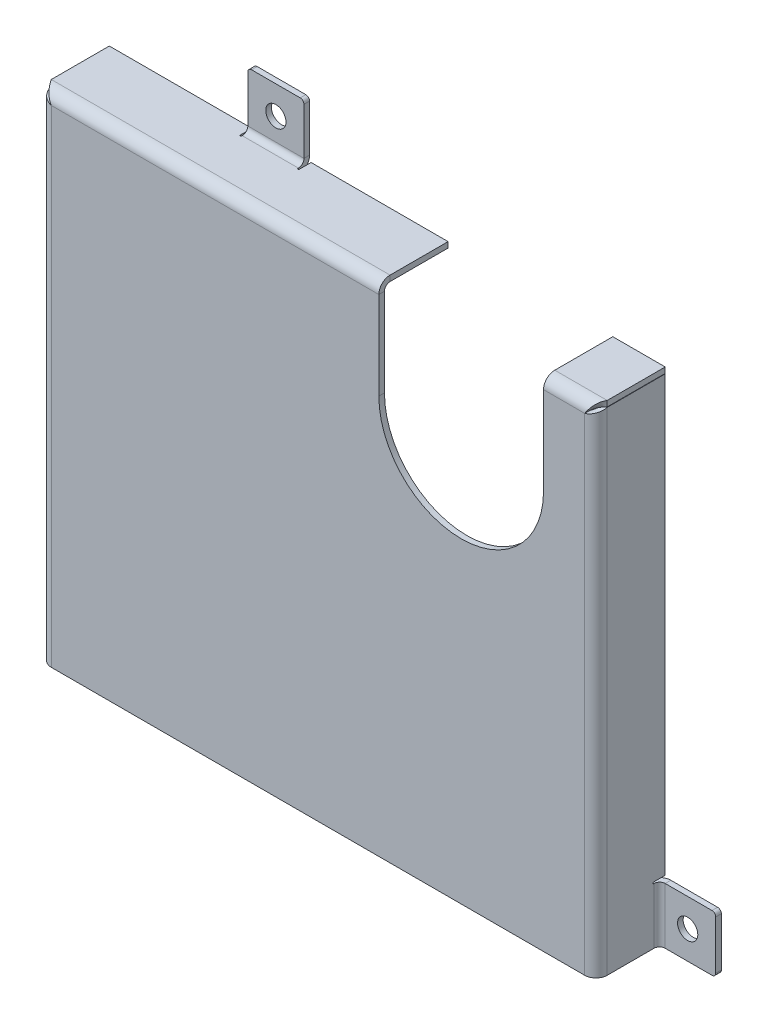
ISO-10303-21;
HEADER;
FILE_DESCRIPTION(('STEP AP214'),'2;1');
FILE_NAME('part.step','',(''),(''),'','','');
FILE_SCHEMA(('AUTOMOTIVE_DESIGN { 1 0 10303 214 1 1 1 1 }'));
ENDSEC;
DATA;
#1=APPLICATION_CONTEXT('core data for automotive mechanical design processes');
#2=APPLICATION_PROTOCOL_DEFINITION('international standard','automotive_design',2000,#1);
#3=PRODUCT_CONTEXT('',#1,'mechanical');
#4=PRODUCT('Part','Part','',(#3));
#5=PRODUCT_RELATED_PRODUCT_CATEGORY('part','',(#4));
#6=PRODUCT_DEFINITION_FORMATION('','',#4);
#7=PRODUCT_DEFINITION_CONTEXT('part definition',#1,'design');
#8=PRODUCT_DEFINITION('design','',#6,#7);
#9=PRODUCT_DEFINITION_SHAPE('','',#8);
#10=(LENGTH_UNIT() NAMED_UNIT(*) SI_UNIT(.MILLI.,.METRE.));
#11=(NAMED_UNIT(*) PLANE_ANGLE_UNIT() SI_UNIT($,.RADIAN.));
#12=(NAMED_UNIT(*) SI_UNIT($,.STERADIAN.) SOLID_ANGLE_UNIT());
#13=UNCERTAINTY_MEASURE_WITH_UNIT(LENGTH_MEASURE(1.E-05),#10,'distance_accuracy_value','');
#14=(GEOMETRIC_REPRESENTATION_CONTEXT(3) GLOBAL_UNCERTAINTY_ASSIGNED_CONTEXT((#13)) GLOBAL_UNIT_ASSIGNED_CONTEXT((#10,
#11,#12)) REPRESENTATION_CONTEXT('',''));
#15=CARTESIAN_POINT('',(0.,0.,0.));
#16=DIRECTION('',(0.,0.,1.));
#17=DIRECTION('',(1.,0.,0.));
#18=AXIS2_PLACEMENT_3D('',#15,#16,#17);
#19=CARTESIAN_POINT('',(-72.7499999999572,723.250000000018,-17.000000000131));
#20=DIRECTION('',(-1.17553026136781E-12,0.,-1.));
#21=DIRECTION('',(0.,1.,0.));
#22=AXIS2_PLACEMENT_3D('',#19,#20,#21);
#23=PLANE('',#22);
#24=DIRECTION('',(1.,0.,-1.17544290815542E-12));
#25=VECTOR('',#24,1.);
#26=CARTESIAN_POINT('',(-74.2499999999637,-50.3499999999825,-17.0000000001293));
#27=LINE('',#26,#25);
#28=CARTESIAN_POINT('',(-74.2499999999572,-50.3499999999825,-17.0000000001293));
#29=VERTEX_POINT('',#28);
#30=CARTESIAN_POINT('',(-72.7499999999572,-50.3499999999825,-17.000000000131));
#31=VERTEX_POINT('',#30);
#32=EDGE_CURVE('E602',#29,#31,#27,.T.);
#33=ORIENTED_EDGE('',*,*,#32,.F.);
#34=DIRECTION('',(0.,1.,0.));
#35=VECTOR('',#34,1.);
#36=CARTESIAN_POINT('',(-74.2499999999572,723.250000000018,-17.0000000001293));
#37=LINE('',#36,#35);
#38=CARTESIAN_POINT('',(-74.2499999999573,65.6500000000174,-17.0000000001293));
#39=VERTEX_POINT('',#38);
#40=EDGE_CURVE('E786',#39,#29,#37,.F.);
#41=ORIENTED_EDGE('',*,*,#40,.F.);
#42=DIRECTION('',(-1.,0.,1.17553026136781E-12));
#43=VECTOR('',#42,1.);
#44=CARTESIAN_POINT('',(-72.7499999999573,65.6500000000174,-17.000000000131));
#45=LINE('',#44,#43);
#46=CARTESIAN_POINT('',(-72.7499999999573,65.6500000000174,-17.000000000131));
#47=VERTEX_POINT('',#46);
#48=EDGE_CURVE('E782',#47,#39,#45,.T.);
#49=ORIENTED_EDGE('',*,*,#48,.F.);
#50=DIRECTION('',(0.,1.,0.));
#51=VECTOR('',#50,1.);
#52=CARTESIAN_POINT('',(-72.7499999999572,723.250000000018,-17.000000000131));
#53=LINE('',#52,#51);
#54=EDGE_CURVE('E790',#47,#31,#53,.F.);
#55=ORIENTED_EDGE('',*,*,#54,.T.);
#56=EDGE_LOOP('',(#33,#41,#49,#55));
#57=FACE_BOUND('',#56,.T.);
#58=ADVANCED_FACE('F151',(#57),#23,.T.);
#59=CARTESIAN_POINT('',(-74.2499999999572,723.250000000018,-17.0000000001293));
#60=DIRECTION('',(1.,0.,-1.17553026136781E-12));
#61=DIRECTION('',(-1.17553026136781E-12,0.,-1.));
#62=AXIS2_PLACEMENT_3D('',#59,#60,#61);
#63=PLANE('',#62);
#64=DIRECTION('',(0.,-1.,0.));
#65=VECTOR('',#64,1.);
#66=CARTESIAN_POINT('',(-74.2499999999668,-65.7499999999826,-14.0000000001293));
#67=LINE('',#66,#65);
#68=CARTESIAN_POINT('',(-74.2499999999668,-65.7499999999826,-14.0000000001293));
#69=VERTEX_POINT('',#68);
#70=CARTESIAN_POINT('',(-74.2499999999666,-50.7499999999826,-14.0000000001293));
#71=VERTEX_POINT('',#70);
#72=EDGE_CURVE('E557',#69,#71,#67,.F.);
#73=ORIENTED_EDGE('',*,*,#72,.F.);
#74=DIRECTION('',(-1.17553026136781E-12,0.,-1.));
#75=VECTOR('',#74,1.);
#76=CARTESIAN_POINT('',(-74.2499999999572,-65.7499999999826,-17.0000000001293));
#77=LINE('',#76,#75);
#78=CARTESIAN_POINT('',(-74.2500000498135,-65.7499999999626,-1.50000000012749));
#79=VERTEX_POINT('',#78);
#80=EDGE_CURVE('E772',#79,#69,#77,.T.);
#81=ORIENTED_EDGE('',*,*,#80,.F.);
#82=DIRECTION('',(0.,-1.,0.));
#83=VECTOR('',#82,1.);
#84=CARTESIAN_POINT('',(-74.249999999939,723.250000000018,-1.50000000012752));
#85=LINE('',#84,#83);
#86=CARTESIAN_POINT('',(-74.249999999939,65.6500000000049,-1.50000000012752));
#87=VERTEX_POINT('',#86);
#88=EDGE_CURVE('E741',#87,#79,#85,.T.);
#89=ORIENTED_EDGE('',*,*,#88,.F.);
#90=DIRECTION('',(-1.17512127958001E-12,8.03122733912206E-13,-1.));
#91=VECTOR('',#90,1.);
#92=CARTESIAN_POINT('',(-74.249999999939,65.6500000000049,-1.50000000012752));
#93=LINE('',#92,#91);
#94=EDGE_CURVE('E789',#87,#39,#93,.T.);
#95=ORIENTED_EDGE('',*,*,#94,.T.);
#96=ORIENTED_EDGE('',*,*,#40,.T.);
#97=DIRECTION('',(9.0877126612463E-13,0.,-1.));
#98=VECTOR('',#97,1.);
#99=CARTESIAN_POINT('',(-74.2499999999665,-50.3499999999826,-13.9000000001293));
#100=LINE('',#99,#98);
#101=CARTESIAN_POINT('',(-74.2499999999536,-50.3499999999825,-13.9000000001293));
#102=VERTEX_POINT('',#101);
#103=EDGE_CURVE('E599',#102,#29,#100,.T.);
#104=ORIENTED_EDGE('',*,*,#103,.F.);
#105=CARTESIAN_POINT('',(-74.2499999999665,-50.5499999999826,-13.9000000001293));
#106=DIRECTION('',(-1.,0.,1.17553026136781E-12));
#107=DIRECTION('',(1.17553026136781E-12,0.,1.));
#108=AXIS2_PLACEMENT_3D('',#105,#106,#107);
#109=CIRCLE('',#108,0.199999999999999);
#110=CARTESIAN_POINT('',(-74.2499999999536,-50.7499999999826,-13.9000000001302));
#111=VERTEX_POINT('',#110);
#112=EDGE_CURVE('E595',#111,#102,#109,.T.);
#113=ORIENTED_EDGE('',*,*,#112,.F.);
#114=DIRECTION('',(1.11022302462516E-12,0.,1.));
#115=VECTOR('',#114,1.);
#116=CARTESIAN_POINT('',(-74.2499999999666,-50.7499999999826,-14.0000000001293));
#117=LINE('',#116,#115);
#118=EDGE_CURVE('E591',#71,#111,#117,.T.);
#119=ORIENTED_EDGE('',*,*,#118,.F.);
#120=EDGE_LOOP('',(#73,#81,#89,#95,#96,#104,#113,#119));
#121=FACE_BOUND('',#120,.T.);
#122=ADVANCED_FACE('F947',(#121),#63,.F.);
#123=CARTESIAN_POINT('',(-72.7499999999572,723.250000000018,-17.000000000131));
#124=DIRECTION('',(1.,0.,-1.17553026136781E-12));
#125=DIRECTION('',(-1.17553026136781E-12,0.,-1.));
#126=AXIS2_PLACEMENT_3D('',#123,#124,#125);
#127=PLANE('',#126);
#128=DIRECTION('',(-1.17553026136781E-12,0.,-1.));
#129=VECTOR('',#128,1.);
#130=CARTESIAN_POINT('',(-72.7499999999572,-65.7499999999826,-17.000000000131));
#131=LINE('',#130,#129);
#132=CARTESIAN_POINT('',(-72.749999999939,-65.7499999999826,-1.50000000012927));
#133=VERTEX_POINT('',#132);
#134=CARTESIAN_POINT('',(-72.7499999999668,-65.7499999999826,-14.0000000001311));
#135=VERTEX_POINT('',#134);
#136=EDGE_CURVE('E778',#133,#135,#131,.T.);
#137=ORIENTED_EDGE('',*,*,#136,.T.);
#138=DIRECTION('',(0.,-1.,0.));
#139=VECTOR('',#138,1.);
#140=CARTESIAN_POINT('',(-72.7499999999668,-65.7499999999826,-14.0000000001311));
#141=LINE('',#140,#139);
#142=CARTESIAN_POINT('',(-72.7499999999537,-50.7499999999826,-14.0000000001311));
#143=VERTEX_POINT('',#142);
#144=EDGE_CURVE('E526',#135,#143,#141,.F.);
#145=ORIENTED_EDGE('',*,*,#144,.T.);
#146=DIRECTION('',(1.17553026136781E-12,0.,1.));
#147=VECTOR('',#146,1.);
#148=CARTESIAN_POINT('',(-72.7499999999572,-50.7499999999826,-17.000000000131));
#149=LINE('',#148,#147);
#150=CARTESIAN_POINT('',(-72.7499999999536,-50.7499999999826,-13.9000000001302));
#151=VERTEX_POINT('',#150);
#152=EDGE_CURVE('E1018',#143,#151,#149,.T.);
#153=ORIENTED_EDGE('',*,*,#152,.T.);
#154=CARTESIAN_POINT('',(-72.7499999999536,-50.5499999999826,-13.9000000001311));
#155=DIRECTION('',(1.,0.,-1.17553026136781E-12));
#156=DIRECTION('',(-1.17553026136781E-12,0.,-1.));
#157=AXIS2_PLACEMENT_3D('',#154,#155,#156);
#158=CIRCLE('',#157,0.199999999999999);
#159=CARTESIAN_POINT('',(-72.7499999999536,-50.3499999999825,-13.9000000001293));
#160=VERTEX_POINT('',#159);
#161=EDGE_CURVE('E1016',#151,#160,#158,.F.);
#162=ORIENTED_EDGE('',*,*,#161,.T.);
#163=DIRECTION('',(-1.17553026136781E-12,0.,-1.));
#164=VECTOR('',#163,1.);
#165=CARTESIAN_POINT('',(-72.7499999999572,-50.3499999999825,-17.0000000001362));
#166=LINE('',#165,#164);
#167=EDGE_CURVE('E1014',#160,#31,#166,.T.);
#168=ORIENTED_EDGE('',*,*,#167,.T.);
#169=ORIENTED_EDGE('',*,*,#54,.F.);
#170=DIRECTION('',(-1.17512127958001E-12,8.03122733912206E-13,-1.));
#171=VECTOR('',#170,1.);
#172=CARTESIAN_POINT('',(-72.749999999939,65.6500000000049,-1.50000000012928));
#173=LINE('',#172,#171);
#174=CARTESIAN_POINT('',(-72.749999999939,65.6500000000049,-1.50000000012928));
#175=VERTEX_POINT('',#174);
#176=EDGE_CURVE('E785',#175,#47,#173,.T.);
#177=ORIENTED_EDGE('',*,*,#176,.F.);
#178=DIRECTION('',(0.,-1.,0.));
#179=VECTOR('',#178,1.);
#180=CARTESIAN_POINT('',(-72.749999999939,723.250000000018,-1.50000000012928));
#181=LINE('',#180,#179);
#182=EDGE_CURVE('E781',#175,#133,#181,.T.);
#183=ORIENTED_EDGE('',*,*,#182,.T.);
#184=EDGE_LOOP('',(#137,#145,#153,#162,#168,#169,#177,#183));
#185=FACE_BOUND('',#184,.T.);
#186=ADVANCED_FACE('F953',(#185),#127,.T.);
#187=CARTESIAN_POINT('',(-72.7499999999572,-65.7499999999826,-17.000000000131));
#188=DIRECTION('',(0.,-1.,0.));
#189=DIRECTION('',(-1.17553026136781E-12,0.,-1.));
#190=AXIS2_PLACEMENT_3D('',#187,#188,#189);
#191=PLANE('',#190);
#192=DIRECTION('',(1.,0.,-1.17845548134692E-12));
#193=VECTOR('',#192,1.);
#194=CARTESIAN_POINT('',(-74.2499999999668,-65.7499999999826,-14.0000000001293));
#195=LINE('',#194,#193);
#196=EDGE_CURVE('E584',#69,#135,#195,.T.);
#197=ORIENTED_EDGE('',*,*,#196,.T.);
#198=ORIENTED_EDGE('',*,*,#136,.F.);
#199=DIRECTION('',(-1.,0.,1.17553026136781E-12));
#200=VECTOR('',#199,1.);
#201=CARTESIAN_POINT('',(-72.749999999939,-65.7499999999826,-1.50000000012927));
#202=LINE('',#201,#200);
#203=EDGE_CURVE('E776',#133,#79,#202,.T.);
#204=ORIENTED_EDGE('',*,*,#203,.T.);
#205=ORIENTED_EDGE('',*,*,#80,.T.);
#206=EDGE_LOOP('',(#197,#198,#204,#205));
#207=FACE_BOUND('',#206,.T.);
#208=ADVANCED_FACE('F1173',(#207),#191,.T.);
#209=CARTESIAN_POINT('',(72.7500000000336,723.250000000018,-17.000000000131));
#210=DIRECTION('',(-1.17553026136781E-12,0.,1.));
#211=DIRECTION('',(0.,-1.,0.));
#212=AXIS2_PLACEMENT_3D('',#209,#210,#211);
#213=PLANE('',#212);
#214=DIRECTION('',(0.,-1.,0.));
#215=VECTOR('',#214,1.);
#216=CARTESIAN_POINT('',(74.2500000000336,723.250000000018,-17.0000000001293));
#217=LINE('',#216,#215);
#218=CARTESIAN_POINT('',(74.2500000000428,65.6500000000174,-17.0000000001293));
#219=VERTEX_POINT('',#218);
#220=CARTESIAN_POINT('',(74.2500000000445,-50.3499999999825,-17.0000000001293));
#221=VERTEX_POINT('',#220);
#222=EDGE_CURVE('E1428',#219,#221,#217,.T.);
#223=ORIENTED_EDGE('',*,*,#222,.T.);
#224=DIRECTION('',(-1.,0.,-1.17544290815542E-12));
#225=VECTOR('',#224,1.);
#226=CARTESIAN_POINT('',(74.2500000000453,-50.3499999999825,-17.0000000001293));
#227=LINE('',#226,#225);
#228=CARTESIAN_POINT('',(72.7500000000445,-50.3499999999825,-17.000000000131));
#229=VERTEX_POINT('',#228);
#230=EDGE_CURVE('E669',#221,#229,#227,.T.);
#231=ORIENTED_EDGE('',*,*,#230,.T.);
#232=DIRECTION('',(0.,-1.,0.));
#233=VECTOR('',#232,1.);
#234=CARTESIAN_POINT('',(72.7500000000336,723.250000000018,-17.000000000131));
#235=LINE('',#234,#233);
#236=CARTESIAN_POINT('',(72.7500000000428,65.6500000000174,-17.000000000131));
#237=VERTEX_POINT('',#236);
#238=EDGE_CURVE('E1417',#237,#229,#235,.T.);
#239=ORIENTED_EDGE('',*,*,#238,.F.);
#240=DIRECTION('',(1.,0.,1.17553026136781E-12));
#241=VECTOR('',#240,1.);
#242=CARTESIAN_POINT('',(72.7500000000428,65.6500000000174,-17.000000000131));
#243=LINE('',#242,#241);
#244=EDGE_CURVE('E1431',#237,#219,#243,.T.);
#245=ORIENTED_EDGE('',*,*,#244,.T.);
#246=EDGE_LOOP('',(#223,#231,#239,#245));
#247=FACE_BOUND('',#246,.T.);
#248=ADVANCED_FACE('F1169',(#247),#213,.F.);
#249=CARTESIAN_POINT('',(74.2500000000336,723.250000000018,-17.0000000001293));
#250=DIRECTION('',(1.,0.,1.17553026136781E-12));
#251=DIRECTION('',(-1.17553026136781E-12,0.,1.));
#252=AXIS2_PLACEMENT_3D('',#249,#250,#251);
#253=PLANE('',#252);
#254=CARTESIAN_POINT('',(74.2500000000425,-50.5499999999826,-13.9000000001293));
#255=DIRECTION('',(1.,0.,1.17553026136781E-12));
#256=DIRECTION('',(1.17553026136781E-12,0.,-1.));
#257=AXIS2_PLACEMENT_3D('',#254,#255,#256);
#258=CIRCLE('',#257,0.199999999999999);
#259=CARTESIAN_POINT('',(74.2500000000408,-50.3499999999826,-13.9000000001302));
#260=VERTEX_POINT('',#259);
#261=CARTESIAN_POINT('',(74.2500000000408,-50.7499999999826,-13.9000000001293));
#262=VERTEX_POINT('',#261);
#263=EDGE_CURVE('E670',#260,#262,#258,.T.);
#264=ORIENTED_EDGE('',*,*,#263,.F.);
#265=DIRECTION('',(-8.95341148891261E-13,0.,1.));
#266=VECTOR('',#265,1.);
#267=CARTESIAN_POINT('',(74.2500000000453,-50.3499999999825,-17.0000000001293));
#268=LINE('',#267,#266);
#269=EDGE_CURVE('E665',#221,#260,#268,.T.);
#270=ORIENTED_EDGE('',*,*,#269,.F.);
#271=ORIENTED_EDGE('',*,*,#222,.F.);
#272=DIRECTION('',(1.17579457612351E-12,1.17558394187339E-12,-1.));
#273=VECTOR('',#272,1.);
#274=CARTESIAN_POINT('',(74.2500000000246,65.6499999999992,-1.5000000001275));
#275=LINE('',#274,#273);
#276=CARTESIAN_POINT('',(74.2500000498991,65.6499999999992,-1.50000000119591));
#277=VERTEX_POINT('',#276);
#278=EDGE_CURVE('E1602',#277,#219,#275,.T.);
#279=ORIENTED_EDGE('',*,*,#278,.F.);
#280=DIRECTION('',(0.,-1.,0.));
#281=VECTOR('',#280,1.);
#282=CARTESIAN_POINT('',(74.2500000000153,723.250000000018,-1.50000000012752));
#283=LINE('',#282,#281);
#284=CARTESIAN_POINT('',(74.2500000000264,-65.7499999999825,-1.50000000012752));
#285=VERTEX_POINT('',#284);
#286=EDGE_CURVE('E1427',#277,#285,#283,.T.);
#287=ORIENTED_EDGE('',*,*,#286,.T.);
#288=DIRECTION('',(-1.17553026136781E-12,0.,1.));
#289=VECTOR('',#288,1.);
#290=CARTESIAN_POINT('',(74.2500000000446,-65.7499999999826,-17.0000000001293));
#291=LINE('',#290,#289);
#292=CARTESIAN_POINT('',(74.2500000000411,-65.7499999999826,-14.0000000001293));
#293=VERTEX_POINT('',#292);
#294=EDGE_CURVE('E1424',#285,#293,#291,.F.);
#295=ORIENTED_EDGE('',*,*,#294,.T.);
#296=DIRECTION('',(0.,1.,0.));
#297=VECTOR('',#296,1.);
#298=CARTESIAN_POINT('',(74.2500000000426,-50.7499999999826,-14.0000000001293));
#299=LINE('',#298,#297);
#300=CARTESIAN_POINT('',(74.2500000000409,-50.7499999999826,-14.0000000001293));
#301=VERTEX_POINT('',#300);
#302=EDGE_CURVE('E647',#301,#293,#299,.F.);
#303=ORIENTED_EDGE('',*,*,#302,.F.);
#304=DIRECTION('',(1.11022302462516E-12,0.,-1.));
#305=VECTOR('',#304,1.);
#306=CARTESIAN_POINT('',(74.2500000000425,-50.7499999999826,-13.9000000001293));
#307=LINE('',#306,#305);
#308=EDGE_CURVE('E674',#262,#301,#307,.T.);
#309=ORIENTED_EDGE('',*,*,#308,.F.);
#310=EDGE_LOOP('',(#264,#270,#271,#279,#287,#295,#303,#309));
#311=FACE_BOUND('',#310,.T.);
#312=ADVANCED_FACE('F1172',(#311),#253,.T.);
#313=CARTESIAN_POINT('',(72.7500000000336,723.250000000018,-17.000000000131));
#314=DIRECTION('',(1.,0.,1.17553026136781E-12));
#315=DIRECTION('',(-1.17553026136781E-12,0.,1.));
#316=AXIS2_PLACEMENT_3D('',#313,#314,#315);
#317=PLANE('',#316);
#318=DIRECTION('',(1.17553026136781E-12,0.,-1.));
#319=VECTOR('',#318,1.);
#320=CARTESIAN_POINT('',(72.7500000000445,-50.3499999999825,-17.000000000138));
#321=LINE('',#320,#319);
#322=CARTESIAN_POINT('',(72.7500000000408,-50.3499999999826,-13.9000000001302));
#323=VERTEX_POINT('',#322);
#324=EDGE_CURVE('E1011',#323,#229,#321,.T.);
#325=ORIENTED_EDGE('',*,*,#324,.F.);
#326=CARTESIAN_POINT('',(72.7500000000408,-50.5499999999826,-13.9000000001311));
#327=DIRECTION('',(1.,0.,1.17553026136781E-12));
#328=DIRECTION('',(1.17553026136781E-12,0.,-1.));
#329=AXIS2_PLACEMENT_3D('',#326,#327,#328);
#330=CIRCLE('',#329,0.199999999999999);
#331=CARTESIAN_POINT('',(72.7500000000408,-50.7499999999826,-13.9000000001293));
#332=VERTEX_POINT('',#331);
#333=EDGE_CURVE('E1008',#332,#323,#330,.F.);
#334=ORIENTED_EDGE('',*,*,#333,.F.);
#335=DIRECTION('',(-1.17553026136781E-12,0.,1.));
#336=VECTOR('',#335,1.);
#337=CARTESIAN_POINT('',(72.7500000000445,-50.7499999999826,-17.000000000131));
#338=LINE('',#337,#336);
#339=CARTESIAN_POINT('',(72.7500000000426,-50.7499999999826,-14.0000000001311));
#340=VERTEX_POINT('',#339);
#341=EDGE_CURVE('E1005',#340,#332,#338,.T.);
#342=ORIENTED_EDGE('',*,*,#341,.F.);
#343=DIRECTION('',(0.,1.,0.));
#344=VECTOR('',#343,1.);
#345=CARTESIAN_POINT('',(72.7500000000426,-50.7499999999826,-14.0000000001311));
#346=LINE('',#345,#344);
#347=CARTESIAN_POINT('',(72.7500000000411,-65.7499999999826,-14.0000000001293));
#348=VERTEX_POINT('',#347);
#349=EDGE_CURVE('E652',#340,#348,#346,.F.);
#350=ORIENTED_EDGE('',*,*,#349,.T.);
#351=DIRECTION('',(-1.17553026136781E-12,0.,1.));
#352=VECTOR('',#351,1.);
#353=CARTESIAN_POINT('',(72.7500000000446,-65.7499999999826,-17.000000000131));
#354=LINE('',#353,#352);
#355=CARTESIAN_POINT('',(72.7500000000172,-65.7499999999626,-1.50000000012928));
#356=VERTEX_POINT('',#355);
#357=EDGE_CURVE('E1421',#356,#348,#354,.F.);
#358=ORIENTED_EDGE('',*,*,#357,.F.);
#359=DIRECTION('',(0.,-1.,0.));
#360=VECTOR('',#359,1.);
#361=CARTESIAN_POINT('',(72.7500000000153,723.250000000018,-1.50000000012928));
#362=LINE('',#361,#360);
#363=CARTESIAN_POINT('',(72.7500000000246,65.6499999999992,-1.50000000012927));
#364=VERTEX_POINT('',#363);
#365=EDGE_CURVE('E1408',#364,#356,#362,.T.);
#366=ORIENTED_EDGE('',*,*,#365,.F.);
#367=DIRECTION('',(1.17579457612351E-12,1.17558394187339E-12,-1.));
#368=VECTOR('',#367,1.);
#369=CARTESIAN_POINT('',(72.7500000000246,65.6499999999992,-1.50000000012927));
#370=LINE('',#369,#368);
#371=EDGE_CURVE('E1420',#364,#237,#370,.T.);
#372=ORIENTED_EDGE('',*,*,#371,.T.);
#373=ORIENTED_EDGE('',*,*,#238,.T.);
#374=EDGE_LOOP('',(#325,#334,#342,#350,#358,#366,#372,#373));
#375=FACE_BOUND('',#374,.T.);
#376=ADVANCED_FACE('F1177',(#375),#317,.F.);
#377=CARTESIAN_POINT('',(16.2500000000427,65.7500000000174,-17.000000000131));
#378=DIRECTION('',(0.,1.17553026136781E-12,-1.));
#379=DIRECTION('',(1.,0.,0.));
#380=AXIS2_PLACEMENT_3D('',#377,#378,#379);
#381=PLANE('',#380);
#382=DIRECTION('',(0.,-1.,-1.17544290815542E-12));
#383=VECTOR('',#382,1.);
#384=CARTESIAN_POINT('',(-36.1499999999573,67.2500000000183,-17.0000000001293));
#385=LINE('',#384,#383);
#386=CARTESIAN_POINT('',(-36.1499999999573,67.2500000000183,-17.0000000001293));
#387=VERTEX_POINT('',#386);
#388=CARTESIAN_POINT('',(-36.1499999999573,65.7500000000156,-17.000000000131));
#389=VERTEX_POINT('',#388);
#390=EDGE_CURVE('E742',#387,#389,#385,.T.);
#391=ORIENTED_EDGE('',*,*,#390,.T.);
#392=DIRECTION('',(1.,0.,0.));
#393=VECTOR('',#392,1.);
#394=CARTESIAN_POINT('',(16.2500000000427,65.7500000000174,-17.000000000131));
#395=LINE('',#394,#393);
#396=CARTESIAN_POINT('',(-74.2499999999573,65.7500000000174,-17.000000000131));
#397=VERTEX_POINT('',#396);
#398=EDGE_CURVE('E1130',#389,#397,#395,.F.);
#399=ORIENTED_EDGE('',*,*,#398,.T.);
#400=DIRECTION('',(0.,-1.,-1.17553026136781E-12));
#401=VECTOR('',#400,1.);
#402=CARTESIAN_POINT('',(-74.2499999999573,67.2500000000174,-17.0000000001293));
#403=LINE('',#402,#401);
#404=CARTESIAN_POINT('',(-74.2499999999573,67.2500000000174,-17.0000000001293));
#405=VERTEX_POINT('',#404);
#406=EDGE_CURVE('E893',#405,#397,#403,.T.);
#407=ORIENTED_EDGE('',*,*,#406,.F.);
#408=DIRECTION('',(1.,0.,0.));
#409=VECTOR('',#408,1.);
#410=CARTESIAN_POINT('',(16.2500000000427,67.2500000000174,-17.0000000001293));
#411=LINE('',#410,#409);
#412=EDGE_CURVE('E1118',#387,#405,#411,.F.);
#413=ORIENTED_EDGE('',*,*,#412,.F.);
#414=EDGE_LOOP('',(#391,#399,#407,#413));
#415=FACE_BOUND('',#414,.T.);
#416=ADVANCED_FACE('F1122',(#415),#381,.T.);
#417=DIRECTION('',(0.,-1.,-1.17544290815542E-12));
#418=VECTOR('',#417,1.);
#419=CARTESIAN_POINT('',(-20.3499999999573,67.2500000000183,-17.0000000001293));
#420=LINE('',#419,#418);
#421=CARTESIAN_POINT('',(-20.3499999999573,67.2500000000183,-17.0000000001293));
#422=VERTEX_POINT('',#421);
#423=CARTESIAN_POINT('',(-20.3499999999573,65.7500000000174,-17.000000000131));
#424=VERTEX_POINT('',#423);
#425=EDGE_CURVE('E760',#422,#424,#420,.T.);
#426=ORIENTED_EDGE('',*,*,#425,.F.);
#427=CARTESIAN_POINT('',(16.2500000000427,67.2500000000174,-17.0000000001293));
#428=VERTEX_POINT('',#427);
#429=EDGE_CURVE('E1125',#428,#422,#411,.F.);
#430=ORIENTED_EDGE('',*,*,#429,.F.);
#431=DIRECTION('',(0.,-1.,-1.17553026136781E-12));
#432=VECTOR('',#431,1.);
#433=CARTESIAN_POINT('',(16.2500000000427,65.7500000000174,-17.000000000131));
#434=LINE('',#433,#432);
#435=CARTESIAN_POINT('',(16.2500000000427,65.7500000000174,-17.000000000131));
#436=VERTEX_POINT('',#435);
#437=EDGE_CURVE('E1128',#436,#428,#434,.F.);
#438=ORIENTED_EDGE('',*,*,#437,.F.);
#439=EDGE_CURVE('E1126',#436,#424,#395,.F.);
#440=ORIENTED_EDGE('',*,*,#439,.T.);
#441=EDGE_LOOP('',(#426,#430,#438,#440));
#442=FACE_BOUND('',#441,.T.);
#443=ADVANCED_FACE('F1683',(#442),#381,.T.);
#444=CARTESIAN_POINT('',(16.2500000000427,67.2500000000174,-17.0000000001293));
#445=DIRECTION('',(0.,-1.,-1.17553026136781E-12));
#446=DIRECTION('',(0.,1.17553026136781E-12,-1.));
#447=AXIS2_PLACEMENT_3D('',#444,#445,#446);
#448=PLANE('',#447);
#449=DIRECTION('',(0.,-8.95341148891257E-13,1.));
#450=VECTOR('',#449,1.);
#451=CARTESIAN_POINT('',(-36.1499999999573,67.2500000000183,-17.0000000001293));
#452=LINE('',#451,#450);
#453=CARTESIAN_POINT('',(-36.1499999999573,67.2500000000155,-13.9000000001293));
#454=VERTEX_POINT('',#453);
#455=EDGE_CURVE('E738',#387,#454,#452,.T.);
#456=ORIENTED_EDGE('',*,*,#455,.F.);
#457=ORIENTED_EDGE('',*,*,#412,.T.);
#458=DIRECTION('',(-1.17558292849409E-12,1.17558292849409E-12,-1.));
#459=VECTOR('',#458,1.);
#460=CARTESIAN_POINT('',(-74.249999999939,67.2499999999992,-1.50000000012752));
#461=LINE('',#460,#459);
#462=CARTESIAN_POINT('',(-74.249999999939,67.2499999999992,-1.50000000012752));
#463=VERTEX_POINT('',#462);
#464=EDGE_CURVE('E1407',#463,#405,#461,.T.);
#465=ORIENTED_EDGE('',*,*,#464,.F.);
#466=DIRECTION('',(-1.,0.,0.));
#467=VECTOR('',#466,1.);
#468=CARTESIAN_POINT('',(16.2500000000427,67.2499999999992,-1.50000000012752));
#469=LINE('',#468,#467);
#470=CARTESIAN_POINT('',(16.2500000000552,67.2499999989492,-1.50000000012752));
#471=VERTEX_POINT('',#470);
#472=EDGE_CURVE('E881',#471,#463,#469,.T.);
#473=ORIENTED_EDGE('',*,*,#472,.F.);
#474=DIRECTION('',(0.,1.17553026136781E-12,-1.));
#475=VECTOR('',#474,1.);
#476=CARTESIAN_POINT('',(16.2500000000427,67.2500000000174,-17.0000000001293));
#477=LINE('',#476,#475);
#478=EDGE_CURVE('E1147',#428,#471,#477,.F.);
#479=ORIENTED_EDGE('',*,*,#478,.F.);
#480=ORIENTED_EDGE('',*,*,#429,.T.);
#481=DIRECTION('',(0.,8.95341148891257E-13,-1.));
#482=VECTOR('',#481,1.);
#483=CARTESIAN_POINT('',(-20.3499999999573,67.2500000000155,-13.9000000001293));
#484=LINE('',#483,#482);
#485=CARTESIAN_POINT('',(-20.3499999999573,67.2500000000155,-13.9000000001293));
#486=VERTEX_POINT('',#485);
#487=EDGE_CURVE('E758',#486,#422,#484,.T.);
#488=ORIENTED_EDGE('',*,*,#487,.F.);
#489=CARTESIAN_POINT('',(-20.5499999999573,67.2500000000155,-13.9000000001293));
#490=DIRECTION('',(0.,1.,1.17553026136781E-12));
#491=DIRECTION('',(0.,-1.17553026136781E-12,1.));
#492=AXIS2_PLACEMENT_3D('',#489,#490,#491);
#493=CIRCLE('',#492,0.200000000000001);
#494=CARTESIAN_POINT('',(-20.7499999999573,67.2500000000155,-13.9000000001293));
#495=VERTEX_POINT('',#494);
#496=EDGE_CURVE('E754',#495,#486,#493,.T.);
#497=ORIENTED_EDGE('',*,*,#496,.F.);
#498=DIRECTION('',(0.,-1.11022302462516E-12,1.));
#499=VECTOR('',#498,1.);
#500=CARTESIAN_POINT('',(-20.7499999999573,67.2500000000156,-14.0000000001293));
#501=LINE('',#500,#499);
#502=CARTESIAN_POINT('',(-20.7499999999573,67.2500000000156,-14.0000000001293));
#503=VERTEX_POINT('',#502);
#504=EDGE_CURVE('E751',#503,#495,#501,.T.);
#505=ORIENTED_EDGE('',*,*,#504,.F.);
#506=DIRECTION('',(-1.,0.,0.));
#507=VECTOR('',#506,1.);
#508=CARTESIAN_POINT('',(-35.7499999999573,67.2500000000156,-14.0000000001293));
#509=LINE('',#508,#507);
#510=CARTESIAN_POINT('',(-35.7499999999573,67.2500000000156,-14.0000000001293));
#511=VERTEX_POINT('',#510);
#512=EDGE_CURVE('E719',#511,#503,#509,.F.);
#513=ORIENTED_EDGE('',*,*,#512,.F.);
#514=DIRECTION('',(0.,1.11022302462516E-12,-1.));
#515=VECTOR('',#514,1.);
#516=CARTESIAN_POINT('',(-35.7499999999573,67.2500000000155,-13.9000000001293));
#517=LINE('',#516,#515);
#518=CARTESIAN_POINT('',(-35.7499999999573,67.2500000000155,-13.9000000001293));
#519=VERTEX_POINT('',#518);
#520=EDGE_CURVE('E747',#519,#511,#517,.T.);
#521=ORIENTED_EDGE('',*,*,#520,.F.);
#522=CARTESIAN_POINT('',(-35.9499999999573,67.2500000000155,-13.9000000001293));
#523=DIRECTION('',(0.,1.,1.17553026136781E-12));
#524=DIRECTION('',(0.,-1.17553026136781E-12,1.));
#525=AXIS2_PLACEMENT_3D('',#522,#523,#524);
#526=CIRCLE('',#525,0.199999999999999);
#527=EDGE_CURVE('E743',#454,#519,#526,.T.);
#528=ORIENTED_EDGE('',*,*,#527,.F.);
#529=EDGE_LOOP('',(#456,#457,#465,#473,#479,#480,#488,#497,#505,#513,#521,#528));
#530=FACE_BOUND('',#529,.T.);
#531=ADVANCED_FACE('F1103',(#530),#448,.F.);
#532=CARTESIAN_POINT('',(16.2500000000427,65.7500000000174,-17.000000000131));
#533=DIRECTION('',(0.,-1.,-1.17553026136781E-12));
#534=DIRECTION('',(0.,1.17553026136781E-12,-1.));
#535=AXIS2_PLACEMENT_3D('',#532,#533,#534);
#536=PLANE('',#535);
#537=ORIENTED_EDGE('',*,*,#398,.F.);
#538=DIRECTION('',(0.,-1.17553026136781E-12,1.));
#539=VECTOR('',#538,1.);
#540=CARTESIAN_POINT('',(-36.1499999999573,65.7500000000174,-17.000000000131));
#541=LINE('',#540,#539);
#542=CARTESIAN_POINT('',(-36.1499999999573,65.750000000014,-13.900000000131));
#543=VERTEX_POINT('',#542);
#544=EDGE_CURVE('E1002',#389,#543,#541,.T.);
#545=ORIENTED_EDGE('',*,*,#544,.T.);
#546=CARTESIAN_POINT('',(-35.9499999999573,65.7500000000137,-13.900000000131));
#547=DIRECTION('',(0.,-1.,-1.17553026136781E-12));
#548=DIRECTION('',(0.,1.17553026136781E-12,-1.));
#549=AXIS2_PLACEMENT_3D('',#546,#547,#548);
#550=CIRCLE('',#549,0.199999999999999);
#551=CARTESIAN_POINT('',(-35.7499999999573,65.7500000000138,-13.900000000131));
#552=VERTEX_POINT('',#551);
#553=EDGE_CURVE('E999',#543,#552,#550,.F.);
#554=ORIENTED_EDGE('',*,*,#553,.T.);
#555=DIRECTION('',(0.,1.17553026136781E-12,-1.));
#556=VECTOR('',#555,1.);
#557=CARTESIAN_POINT('',(-35.7499999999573,65.7500000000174,-17.000000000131));
#558=LINE('',#557,#556);
#559=CARTESIAN_POINT('',(-35.7499999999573,65.7500000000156,-14.000000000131));
#560=VERTEX_POINT('',#559);
#561=EDGE_CURVE('E996',#552,#560,#558,.T.);
#562=ORIENTED_EDGE('',*,*,#561,.T.);
#563=DIRECTION('',(-1.,0.,0.));
#564=VECTOR('',#563,1.);
#565=CARTESIAN_POINT('',(-35.7499999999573,65.7500000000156,-14.000000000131));
#566=LINE('',#565,#564);
#567=CARTESIAN_POINT('',(-20.7499999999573,65.7500000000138,-14.000000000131));
#568=VERTEX_POINT('',#567);
#569=EDGE_CURVE('E723',#560,#568,#566,.F.);
#570=ORIENTED_EDGE('',*,*,#569,.T.);
#571=DIRECTION('',(0.,-1.17553026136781E-12,1.));
#572=VECTOR('',#571,1.);
#573=CARTESIAN_POINT('',(-20.7499999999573,65.7500000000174,-17.000000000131));
#574=LINE('',#573,#572);
#575=CARTESIAN_POINT('',(-20.7499999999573,65.750000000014,-13.900000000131));
#576=VERTEX_POINT('',#575);
#577=EDGE_CURVE('E993',#568,#576,#574,.T.);
#578=ORIENTED_EDGE('',*,*,#577,.T.);
#579=CARTESIAN_POINT('',(-20.5499999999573,65.7500000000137,-13.900000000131));
#580=DIRECTION('',(0.,-1.,-1.17553026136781E-12));
#581=DIRECTION('',(0.,1.17553026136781E-12,-1.));
#582=AXIS2_PLACEMENT_3D('',#579,#580,#581);
#583=CIRCLE('',#582,0.200000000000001);
#584=CARTESIAN_POINT('',(-20.3499999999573,65.7500000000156,-13.900000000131));
#585=VERTEX_POINT('',#584);
#586=EDGE_CURVE('E989',#576,#585,#583,.F.);
#587=ORIENTED_EDGE('',*,*,#586,.T.);
#588=DIRECTION('',(0.,1.17553026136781E-12,-1.));
#589=VECTOR('',#588,1.);
#590=CARTESIAN_POINT('',(-20.3499999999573,65.7500000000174,-17.000000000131));
#591=LINE('',#590,#589);
#592=EDGE_CURVE('E986',#585,#424,#591,.T.);
#593=ORIENTED_EDGE('',*,*,#592,.T.);
#594=ORIENTED_EDGE('',*,*,#439,.F.);
#595=DIRECTION('',(0.,1.17553026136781E-12,-1.));
#596=VECTOR('',#595,1.);
#597=CARTESIAN_POINT('',(16.2500000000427,65.7500000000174,-17.000000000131));
#598=LINE('',#597,#596);
#599=CARTESIAN_POINT('',(16.2500000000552,65.7499999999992,-1.50000000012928));
#600=VERTEX_POINT('',#599);
#601=EDGE_CURVE('E1141',#436,#600,#598,.F.);
#602=ORIENTED_EDGE('',*,*,#601,.T.);
#603=DIRECTION('',(-1.,0.,0.));
#604=VECTOR('',#603,1.);
#605=CARTESIAN_POINT('',(16.2500000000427,65.7499999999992,-1.50000000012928));
#606=LINE('',#605,#604);
#607=CARTESIAN_POINT('',(-74.249999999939,65.7499999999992,-1.50000000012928));
#608=VERTEX_POINT('',#607);
#609=EDGE_CURVE('E1142',#600,#608,#606,.T.);
#610=ORIENTED_EDGE('',*,*,#609,.T.);
#611=DIRECTION('',(-1.17558292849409E-12,1.17558292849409E-12,-1.));
#612=VECTOR('',#611,1.);
#613=CARTESIAN_POINT('',(-74.249999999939,65.7499999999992,-1.50000000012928));
#614=LINE('',#613,#612);
#615=EDGE_CURVE('E1138',#608,#397,#614,.T.);
#616=ORIENTED_EDGE('',*,*,#615,.T.);
#617=EDGE_LOOP('',(#537,#545,#554,#562,#570,#578,#587,#593,#594,#602,#610,#616));
#618=FACE_BOUND('',#617,.T.);
#619=ADVANCED_FACE('F1111',(#618),#536,.T.);
#620=CARTESIAN_POINT('',(38.2500000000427,40.7500000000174,1.49999999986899));
#621=DIRECTION('',(0.,0.,-1.));
#622=DIRECTION('',(-1.,0.,0.));
#623=AXIS2_PLACEMENT_3D('',#620,#621,#622);
#624=CYLINDRICAL_SURFACE('',#623,22.);
#625=CARTESIAN_POINT('',(38.2500000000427,40.7500000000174,-1.31013255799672E-10));
#626=DIRECTION('',(0.,0.,-1.));
#627=DIRECTION('',(1.,0.,0.));
#628=AXIS2_PLACEMENT_3D('',#625,#626,#627);
#629=CIRCLE('',#628,22.);
#630=CARTESIAN_POINT('',(60.2500000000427,40.7500000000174,-1.31013255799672E-10));
#631=VERTEX_POINT('',#630);
#632=CARTESIAN_POINT('',(16.2500000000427,40.7500000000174,-1.31013255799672E-10));
#633=VERTEX_POINT('',#632);
#634=EDGE_CURVE('E2344',#631,#633,#629,.T.);
#635=ORIENTED_EDGE('',*,*,#634,.T.);
#636=DIRECTION('',(0.,0.,-1.));
#637=VECTOR('',#636,1.);
#638=CARTESIAN_POINT('',(16.2500000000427,40.7500000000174,1.49999999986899));
#639=LINE('',#638,#637);
#640=CARTESIAN_POINT('',(16.2500000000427,40.7500000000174,1.49999999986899));
#641=VERTEX_POINT('',#640);
#642=EDGE_CURVE('E1573',#641,#633,#639,.T.);
#643=ORIENTED_EDGE('',*,*,#642,.F.);
#644=CARTESIAN_POINT('',(38.2500000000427,40.7500000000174,1.49999999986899));
#645=DIRECTION('',(0.,0.,-1.));
#646=DIRECTION('',(1.,0.,0.));
#647=AXIS2_PLACEMENT_3D('',#644,#645,#646);
#648=CIRCLE('',#647,22.);
#649=CARTESIAN_POINT('',(60.2500000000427,40.7500000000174,1.49999999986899));
#650=VERTEX_POINT('',#649);
#651=EDGE_CURVE('E1663',#650,#641,#648,.T.);
#652=ORIENTED_EDGE('',*,*,#651,.F.);
#653=DIRECTION('',(0.,0.,-1.));
#654=VECTOR('',#653,1.);
#655=CARTESIAN_POINT('',(60.2500000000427,40.7500000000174,1.49999999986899));
#656=LINE('',#655,#654);
#657=EDGE_CURVE('E2355',#650,#631,#656,.T.);
#658=ORIENTED_EDGE('',*,*,#657,.T.);
#659=EDGE_LOOP('',(#635,#643,#652,#658));
#660=FACE_BOUND('',#659,.T.);
#661=ADVANCED_FACE('F153',(#660),#624,.F.);
#662=CARTESIAN_POINT('',(16.2500000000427,40.7500000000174,1.49999999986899));
#663=DIRECTION('',(-1.,0.,0.));
#664=DIRECTION('',(0.,0.,1.));
#665=AXIS2_PLACEMENT_3D('',#662,#663,#664);
#666=PLANE('',#665);
#667=DIRECTION('',(0.,1.,0.));
#668=VECTOR('',#667,1.);
#669=CARTESIAN_POINT('',(16.2500000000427,40.7500000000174,-1.31013255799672E-10));
#670=LINE('',#669,#668);
#671=CARTESIAN_POINT('',(16.2500000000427,64.2499999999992,-1.18102749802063E-09));
#672=VERTEX_POINT('',#671);
#673=EDGE_CURVE('E1670',#633,#672,#670,.T.);
#674=ORIENTED_EDGE('',*,*,#673,.T.);
#675=DIRECTION('',(0.,0.,1.));
#676=VECTOR('',#675,1.);
#677=CARTESIAN_POINT('',(16.2500000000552,64.2499999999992,-1.31041011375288E-10));
#678=LINE('',#677,#676);
#679=CARTESIAN_POINT('',(16.2500000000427,64.2499999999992,1.49999999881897));
#680=VERTEX_POINT('',#679);
#681=EDGE_CURVE('E1200',#672,#680,#678,.T.);
#682=ORIENTED_EDGE('',*,*,#681,.T.);
#683=DIRECTION('',(0.,1.,0.));
#684=VECTOR('',#683,1.);
#685=CARTESIAN_POINT('',(16.2500000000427,40.7500000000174,1.49999999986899));
#686=LINE('',#685,#684);
#687=EDGE_CURVE('E1661',#641,#680,#686,.T.);
#688=ORIENTED_EDGE('',*,*,#687,.F.);
#689=ORIENTED_EDGE('',*,*,#642,.T.);
#690=EDGE_LOOP('',(#674,#682,#688,#689));
#691=FACE_BOUND('',#690,.T.);
#692=ADVANCED_FACE('F1669',(#691),#666,.F.);
#693=CARTESIAN_POINT('',(-72.7499999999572,-65.7499999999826,1.49999999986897));
#694=DIRECTION('',(0.,1.,0.));
#695=DIRECTION('',(0.,0.,1.));
#696=AXIS2_PLACEMENT_3D('',#693,#694,#695);
#697=PLANE('',#696);
#698=DIRECTION('',(1.,0.,0.));
#699=VECTOR('',#698,1.);
#700=CARTESIAN_POINT('',(-72.7499999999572,-65.7499999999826,-1.31013255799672E-10));
#701=LINE('',#700,#699);
#702=CARTESIAN_POINT('',(-71.249999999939,-65.7499999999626,-1.31013255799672E-10));
#703=VERTEX_POINT('',#702);
#704=CARTESIAN_POINT('',(71.2500000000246,-65.7499999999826,-1.31013255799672E-10));
#705=VERTEX_POINT('',#704);
#706=EDGE_CURVE('E2296',#703,#705,#701,.T.);
#707=ORIENTED_EDGE('',*,*,#706,.T.);
#708=DIRECTION('',(0.,0.,1.));
#709=VECTOR('',#708,1.);
#710=CARTESIAN_POINT('',(71.2500000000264,-65.7499999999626,-1.31013255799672E-10));
#711=LINE('',#710,#709);
#712=CARTESIAN_POINT('',(71.2500000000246,-65.7499999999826,1.49999999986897));
#713=VERTEX_POINT('',#712);
#714=EDGE_CURVE('E1579',#705,#713,#711,.T.);
#715=ORIENTED_EDGE('',*,*,#714,.T.);
#716=DIRECTION('',(1.,0.,0.));
#717=VECTOR('',#716,1.);
#718=CARTESIAN_POINT('',(-72.7499999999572,-65.7499999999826,1.49999999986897));
#719=LINE('',#718,#717);
#720=CARTESIAN_POINT('',(-71.249999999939,-65.7499999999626,1.50000004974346));
#721=VERTEX_POINT('',#720);
#722=EDGE_CURVE('E1648',#721,#713,#719,.T.);
#723=ORIENTED_EDGE('',*,*,#722,.F.);
#724=DIRECTION('',(0.,0.,1.));
#725=VECTOR('',#724,1.);
#726=CARTESIAN_POINT('',(-71.249999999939,-65.7499999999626,-1.31013255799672E-10));
#727=LINE('',#726,#725);
#728=EDGE_CURVE('E990',#703,#721,#727,.T.);
#729=ORIENTED_EDGE('',*,*,#728,.F.);
#730=EDGE_LOOP('',(#707,#715,#723,#729));
#731=FACE_BOUND('',#730,.T.);
#732=ADVANCED_FACE('F2147',(#731),#697,.F.);
#733=CARTESIAN_POINT('',(60.2500000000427,40.7500000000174,1.49999999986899));
#734=DIRECTION('',(1.,0.,0.));
#735=DIRECTION('',(0.,0.,-1.));
#736=AXIS2_PLACEMENT_3D('',#733,#734,#735);
#737=PLANE('',#736);
#738=DIRECTION('',(0.,-1.,0.));
#739=VECTOR('',#738,1.);
#740=CARTESIAN_POINT('',(60.2500000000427,40.7500000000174,1.49999999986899));
#741=LINE('',#740,#739);
#742=CARTESIAN_POINT('',(60.2500000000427,64.2499999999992,1.49999999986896));
#743=VERTEX_POINT('',#742);
#744=EDGE_CURVE('E2353',#743,#650,#741,.T.);
#745=ORIENTED_EDGE('',*,*,#744,.F.);
#746=DIRECTION('',(0.,0.,1.));
#747=VECTOR('',#746,1.);
#748=CARTESIAN_POINT('',(60.2500000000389,64.2499999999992,-1.31041011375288E-10));
#749=LINE('',#748,#747);
#750=CARTESIAN_POINT('',(60.2500000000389,64.2499999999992,-1.31041011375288E-10));
#751=VERTEX_POINT('',#750);
#752=EDGE_CURVE('E1580',#751,#743,#749,.T.);
#753=ORIENTED_EDGE('',*,*,#752,.F.);
#754=DIRECTION('',(0.,-1.,0.));
#755=VECTOR('',#754,1.);
#756=CARTESIAN_POINT('',(60.2500000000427,40.7500000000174,-1.31013255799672E-10));
#757=LINE('',#756,#755);
#758=EDGE_CURVE('E2349',#751,#631,#757,.T.);
#759=ORIENTED_EDGE('',*,*,#758,.T.);
#760=ORIENTED_EDGE('',*,*,#657,.F.);
#761=EDGE_LOOP('',(#745,#753,#759,#760));
#762=FACE_BOUND('',#761,.T.);
#763=ADVANCED_FACE('F2154',(#762),#737,.F.);
#764=CARTESIAN_POINT('',(38.2500000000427,40.7500000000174,1.49999999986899));
#765=DIRECTION('',(0.,0.,1.));
#766=DIRECTION('',(1.,0.,0.));
#767=AXIS2_PLACEMENT_3D('',#764,#765,#766);
#768=PLANE('',#767);
#769=DIRECTION('',(0.,-1.,0.));
#770=VECTOR('',#769,1.);
#771=CARTESIAN_POINT('',(71.2500000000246,65.7500000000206,1.49999999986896));
#772=LINE('',#771,#770);
#773=CARTESIAN_POINT('',(71.2500000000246,64.2499999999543,1.50000004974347));
#774=VERTEX_POINT('',#773);
#775=EDGE_CURVE('E1576',#774,#713,#772,.T.);
#776=ORIENTED_EDGE('',*,*,#775,.F.);
#777=DIRECTION('',(1.,0.,0.));
#778=VECTOR('',#777,1.);
#779=CARTESIAN_POINT('',(-597.249999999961,64.2499999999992,1.49999999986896));
#780=LINE('',#779,#778);
#781=EDGE_CURVE('E1569',#743,#774,#780,.T.);
#782=ORIENTED_EDGE('',*,*,#781,.F.);
#783=ORIENTED_EDGE('',*,*,#744,.T.);
#784=ORIENTED_EDGE('',*,*,#651,.T.);
#785=ORIENTED_EDGE('',*,*,#687,.T.);
#786=DIRECTION('',(-1.,0.,0.));
#787=VECTOR('',#786,1.);
#788=CARTESIAN_POINT('',(673.750000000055,64.2499999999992,1.49999999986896));
#789=LINE('',#788,#787);
#790=CARTESIAN_POINT('',(-71.2499999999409,64.2499999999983,1.49999999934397));
#791=VERTEX_POINT('',#790);
#792=EDGE_CURVE('E1208',#680,#791,#789,.T.);
#793=ORIENTED_EDGE('',*,*,#792,.T.);
#794=DIRECTION('',(0.,-1.,0.));
#795=VECTOR('',#794,1.);
#796=CARTESIAN_POINT('',(-71.249999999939,65.7500000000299,1.49999999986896));
#797=LINE('',#796,#795);
#798=EDGE_CURVE('E1219',#791,#721,#797,.T.);
#799=ORIENTED_EDGE('',*,*,#798,.T.);
#800=ORIENTED_EDGE('',*,*,#722,.T.);
#801=EDGE_LOOP('',(#776,#782,#783,#784,#785,#793,#799,#800));
#802=FACE_BOUND('',#801,.T.);
#803=ADVANCED_FACE('F1646',(#802),#768,.T.);
#804=CARTESIAN_POINT('',(38.2500000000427,40.7500000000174,-1.31013255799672E-10));
#805=DIRECTION('',(0.,0.,1.));
#806=DIRECTION('',(1.,0.,0.));
#807=AXIS2_PLACEMENT_3D('',#804,#805,#806);
#808=PLANE('',#807);
#809=DIRECTION('',(1.,0.,0.));
#810=VECTOR('',#809,1.);
#811=CARTESIAN_POINT('',(-597.249999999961,64.2499999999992,-1.31041011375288E-10));
#812=LINE('',#811,#810);
#813=CARTESIAN_POINT('',(71.2500000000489,64.2499999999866,-6.65252575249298E-10));
#814=VERTEX_POINT('',#813);
#815=EDGE_CURVE('E1572',#751,#814,#812,.T.);
#816=ORIENTED_EDGE('',*,*,#815,.T.);
#817=DIRECTION('',(0.,-1.,0.));
#818=VECTOR('',#817,1.);
#819=CARTESIAN_POINT('',(71.2500000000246,65.7500000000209,-1.31041011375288E-10));
#820=LINE('',#819,#818);
#821=EDGE_CURVE('E1589',#814,#705,#820,.T.);
#822=ORIENTED_EDGE('',*,*,#821,.T.);
#823=ORIENTED_EDGE('',*,*,#706,.F.);
#824=DIRECTION('',(0.,-1.,0.));
#825=VECTOR('',#824,1.);
#826=CARTESIAN_POINT('',(-71.249999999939,65.7500000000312,-1.31041011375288E-10));
#827=LINE('',#826,#825);
#828=CARTESIAN_POINT('',(-71.249999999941,64.2499999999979,-6.56034254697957E-10));
#829=VERTEX_POINT('',#828);
#830=EDGE_CURVE('E1210',#829,#703,#827,.T.);
#831=ORIENTED_EDGE('',*,*,#830,.F.);
#832=DIRECTION('',(-1.,0.,0.));
#833=VECTOR('',#832,1.);
#834=CARTESIAN_POINT('',(673.750000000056,64.2499999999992,-1.31041011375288E-10));
#835=LINE('',#834,#833);
#836=EDGE_CURVE('E934',#672,#829,#835,.T.);
#837=ORIENTED_EDGE('',*,*,#836,.F.);
#838=ORIENTED_EDGE('',*,*,#673,.F.);
#839=ORIENTED_EDGE('',*,*,#634,.F.);
#840=ORIENTED_EDGE('',*,*,#758,.F.);
#841=EDGE_LOOP('',(#816,#822,#823,#831,#837,#838,#839,#840));
#842=FACE_BOUND('',#841,.T.);
#843=ADVANCED_FACE('F2171',(#842),#808,.F.);
#844=CARTESIAN_POINT('',(60.2500000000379,65.7499999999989,-17.0000000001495));
#845=DIRECTION('',(0.,-1.17553026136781E-12,1.));
#846=DIRECTION('',(1.,0.,0.));
#847=AXIS2_PLACEMENT_3D('',#844,#845,#846);
#848=PLANE('',#847);
#849=DIRECTION('',(1.,0.,0.));
#850=VECTOR('',#849,1.);
#851=CARTESIAN_POINT('',(60.2500000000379,67.2499999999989,-17.0000000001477));
#852=LINE('',#851,#850);
#853=CARTESIAN_POINT('',(60.2500000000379,67.2499999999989,-17.0000000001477));
#854=VERTEX_POINT('',#853);
#855=CARTESIAN_POINT('',(74.2500000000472,67.2499999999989,-17.0000000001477));
#856=VERTEX_POINT('',#855);
#857=EDGE_CURVE('E2309',#854,#856,#852,.T.);
#858=ORIENTED_EDGE('',*,*,#857,.T.);
#859=DIRECTION('',(0.,-1.,-1.17553026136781E-12));
#860=VECTOR('',#859,1.);
#861=CARTESIAN_POINT('',(74.2500000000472,67.2499999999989,-17.0000000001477));
#862=LINE('',#861,#860);
#863=CARTESIAN_POINT('',(74.2500000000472,65.7499999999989,-17.0000000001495));
#864=VERTEX_POINT('',#863);
#865=EDGE_CURVE('E2373',#856,#864,#862,.T.);
#866=ORIENTED_EDGE('',*,*,#865,.T.);
#867=DIRECTION('',(1.,0.,0.));
#868=VECTOR('',#867,1.);
#869=CARTESIAN_POINT('',(60.2500000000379,65.7499999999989,-17.0000000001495));
#870=LINE('',#869,#868);
#871=CARTESIAN_POINT('',(60.2500000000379,65.7499999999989,-17.0000000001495));
#872=VERTEX_POINT('',#871);
#873=EDGE_CURVE('E2314',#872,#864,#870,.T.);
#874=ORIENTED_EDGE('',*,*,#873,.F.);
#875=DIRECTION('',(0.,1.,1.17553026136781E-12));
#876=VECTOR('',#875,1.);
#877=CARTESIAN_POINT('',(60.2500000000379,65.7499999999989,-17.0000000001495));
#878=LINE('',#877,#876);
#879=EDGE_CURVE('E2338',#872,#854,#878,.T.);
#880=ORIENTED_EDGE('',*,*,#879,.T.);
#881=EDGE_LOOP('',(#858,#866,#874,#880));
#882=FACE_BOUND('',#881,.T.);
#883=ADVANCED_FACE('F2179',(#882),#848,.F.);
#884=CARTESIAN_POINT('',(60.2500000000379,67.2499999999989,-17.0000000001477));
#885=DIRECTION('',(0.,1.,1.17553026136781E-12));
#886=DIRECTION('',(0.,-1.17553026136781E-12,1.));
#887=AXIS2_PLACEMENT_3D('',#884,#885,#886);
#888=PLANE('',#887);
#889=DIRECTION('',(1.,0.,0.));
#890=VECTOR('',#889,1.);
#891=CARTESIAN_POINT('',(60.2500000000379,67.2499999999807,-1.50000000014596));
#892=LINE('',#891,#890);
#893=CARTESIAN_POINT('',(60.2500000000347,67.2499999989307,-1.50000000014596));
#894=VERTEX_POINT('',#893);
#895=CARTESIAN_POINT('',(74.2500000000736,67.2499999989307,-1.50000000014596));
#896=VERTEX_POINT('',#895);
#897=EDGE_CURVE('E2329',#894,#896,#892,.T.);
#898=ORIENTED_EDGE('',*,*,#897,.T.);
#899=DIRECTION('',(-1.69846215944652E-12,1.17558292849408E-12,-1.));
#900=VECTOR('',#899,1.);
#901=CARTESIAN_POINT('',(74.2500000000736,67.2499999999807,-1.50000000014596));
#902=LINE('',#901,#900);
#903=EDGE_CURVE('E2322',#896,#856,#902,.T.);
#904=ORIENTED_EDGE('',*,*,#903,.T.);
#905=ORIENTED_EDGE('',*,*,#857,.F.);
#906=DIRECTION('',(0.,-1.17553026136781E-12,1.));
#907=VECTOR('',#906,1.);
#908=CARTESIAN_POINT('',(60.2500000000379,67.2499999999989,-17.0000000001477));
#909=LINE('',#908,#907);
#910=EDGE_CURVE('E2317',#854,#894,#909,.T.);
#911=ORIENTED_EDGE('',*,*,#910,.T.);
#912=EDGE_LOOP('',(#898,#904,#905,#911));
#913=FACE_BOUND('',#912,.T.);
#914=ADVANCED_FACE('F2188',(#913),#888,.T.);
#915=CARTESIAN_POINT('',(74.2500000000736,67.2499999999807,-1.50000000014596));
#916=DIRECTION('',(-1.,0.,1.69846215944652E-12));
#917=DIRECTION('',(1.69846215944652E-12,0.,1.));
#918=AXIS2_PLACEMENT_3D('',#915,#916,#917);
#919=PLANE('',#918);
#920=DIRECTION('',(-1.69846215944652E-12,1.17558292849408E-12,-1.));
#921=VECTOR('',#920,1.);
#922=CARTESIAN_POINT('',(74.2500000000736,65.7499999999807,-1.50000000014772));
#923=LINE('',#922,#921);
#924=CARTESIAN_POINT('',(74.2500000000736,65.7499999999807,-1.50000000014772));
#925=VERTEX_POINT('',#924);
#926=EDGE_CURVE('E2312',#925,#864,#923,.T.);
#927=ORIENTED_EDGE('',*,*,#926,.T.);
#928=ORIENTED_EDGE('',*,*,#865,.F.);
#929=ORIENTED_EDGE('',*,*,#903,.F.);
#930=CARTESIAN_POINT('',(74.2500000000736,65.7349999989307,-1.50000000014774));
#931=CARTESIAN_POINT('',(74.2500000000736,65.7499999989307,-1.50000000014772));
#932=CARTESIAN_POINT('',(74.2500000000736,67.2499999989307,-1.50000000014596));
#933=CARTESIAN_POINT('',(74.2500000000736,67.2651499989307,-1.50000000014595));
#934=B_SPLINE_CURVE_WITH_KNOTS('',1,(#930,#931,#932,#933),.UNSPECIFIED.,.F.,.F.,(2,1,1,2),
(-0.0101,-9.9999999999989E-05,0.9999,1.01),.UNSPECIFIED.);
#935=EDGE_CURVE('E1522',#896,#925,#934,.F.);
#936=ORIENTED_EDGE('',*,*,#935,.T.);
#937=EDGE_LOOP('',(#927,#928,#929,#936));
#938=FACE_BOUND('',#937,.T.);
#939=ADVANCED_FACE('F2196',(#938),#919,.F.);
#940=CARTESIAN_POINT('',(60.2500000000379,65.7499999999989,-17.0000000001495));
#941=DIRECTION('',(0.,1.,1.17553026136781E-12));
#942=DIRECTION('',(0.,-1.17553026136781E-12,1.));
#943=AXIS2_PLACEMENT_3D('',#940,#941,#942);
#944=PLANE('',#943);
#945=DIRECTION('',(1.,0.,0.));
#946=VECTOR('',#945,1.);
#947=CARTESIAN_POINT('',(60.2500000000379,65.7499999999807,-1.50000000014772));
#948=LINE('',#947,#946);
#949=CARTESIAN_POINT('',(60.2500000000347,65.7499999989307,-1.50000000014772));
#950=VERTEX_POINT('',#949);
#951=EDGE_CURVE('E1518',#950,#925,#948,.T.);
#952=ORIENTED_EDGE('',*,*,#951,.F.);
#953=DIRECTION('',(0.,-1.17553026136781E-12,1.));
#954=VECTOR('',#953,1.);
#955=CARTESIAN_POINT('',(60.2500000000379,65.7499999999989,-17.0000000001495));
#956=LINE('',#955,#954);
#957=EDGE_CURVE('E2368',#872,#950,#956,.T.);
#958=ORIENTED_EDGE('',*,*,#957,.F.);
#959=ORIENTED_EDGE('',*,*,#873,.T.);
#960=ORIENTED_EDGE('',*,*,#926,.F.);
#961=EDGE_LOOP('',(#952,#958,#959,#960));
#962=FACE_BOUND('',#961,.T.);
#963=ADVANCED_FACE('F2206',(#962),#944,.F.);
#964=CARTESIAN_POINT('',(60.2500000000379,65.7499999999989,-17.0000000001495));
#965=DIRECTION('',(-1.,0.,0.));
#966=DIRECTION('',(0.,-1.17553026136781E-12,1.));
#967=AXIS2_PLACEMENT_3D('',#964,#965,#966);
#968=PLANE('',#967);
#969=ORIENTED_EDGE('',*,*,#879,.F.);
#970=ORIENTED_EDGE('',*,*,#957,.T.);
#971=DIRECTION('',(0.,1.,1.17553026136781E-12));
#972=VECTOR('',#971,1.);
#973=CARTESIAN_POINT('',(60.2500000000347,65.7499999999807,-1.50000000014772));
#974=LINE('',#973,#972);
#975=EDGE_CURVE('E1528',#950,#894,#974,.T.);
#976=ORIENTED_EDGE('',*,*,#975,.T.);
#977=ORIENTED_EDGE('',*,*,#910,.F.);
#978=EDGE_LOOP('',(#969,#970,#976,#977));
#979=FACE_BOUND('',#978,.T.);
#980=ADVANCED_FACE('F1543',(#979),#968,.T.);
#981=CARTESIAN_POINT('',(71.2500000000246,64.2499999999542,1.51514999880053));
#982=CARTESIAN_POINT('',(71.5000322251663,64.6447329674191,1.515149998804));
#983=CARTESIAN_POINT('',(71.7500000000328,65.0392091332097,1.43667371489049));
#984=CARTESIAN_POINT('',(72.2500000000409,65.7684867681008,1.13459702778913));
#985=CARTESIAN_POINT('',(72.500000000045,66.1029505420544,0.911115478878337));
#986=CARTESIAN_POINT('',(73.0000000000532,66.66111547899,0.352950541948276));
#987=CARTESIAN_POINT('',(73.2500000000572,66.8845970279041,0.0184867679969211));
#988=CARTESIAN_POINT('',(73.7500000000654,67.1866737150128,-0.710790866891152));
#989=CARTESIAN_POINT('',(73.9999677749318,67.2651499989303,-1.10526703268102));
#990=CARTESIAN_POINT('',(74.2500000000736,67.2651499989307,-1.50000000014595));
#991=CARTESIAN_POINT('',(71.2500000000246,64.2499999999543,1.49999999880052));
#992=CARTESIAN_POINT('',(71.5000320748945,64.6427494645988,1.49999999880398));
#993=CARTESIAN_POINT('',(71.7500000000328,65.0352436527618,1.42191802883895));
#994=CARTESIAN_POINT('',(72.2500000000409,65.7608569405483,1.1213591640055));
#995=CARTESIAN_POINT('',(72.500000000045,66.0936401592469,0.89900052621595));
#996=CARTESIAN_POINT('',(73.0000000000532,66.6490005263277,0.343640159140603));
#997=CARTESIAN_POINT('',(73.2500000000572,66.8713591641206,0.0108569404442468));
#998=CARTESIAN_POINT('',(73.7500000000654,67.1719180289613,-0.714756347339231));
#999=CARTESIAN_POINT('',(73.9999679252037,67.2499999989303,-1.10725053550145));
#1000=CARTESIAN_POINT('',(74.2500000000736,67.2499999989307,-1.50000000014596));
#1001=CARTESIAN_POINT('',(71.2500000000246,64.2499999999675,-1.19947801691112E-09));
#1002=CARTESIAN_POINT('',(71.5000171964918,64.4463630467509,-1.19774329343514E-09));
#1003=CARTESIAN_POINT('',(71.7500000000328,64.6426218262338,-0.0390409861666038));
#1004=CARTESIAN_POINT('',(72.2500000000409,65.0054284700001,-0.189320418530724));
#1005=CARTESIAN_POINT('',(72.500000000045,65.1718200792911,-0.300499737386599));
#1006=CARTESIAN_POINT('',(73.0000000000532,65.4495002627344,-0.578179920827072));
#1007=CARTESIAN_POINT('',(73.2500000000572,65.5606795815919,-0.744571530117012));
#1008=CARTESIAN_POINT('',(73.7500000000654,65.7109590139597,-1.10737817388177));
#1009=CARTESIAN_POINT('',(73.9999828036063,65.7499999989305,-1.30363695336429));
#1010=CARTESIAN_POINT('',(74.2500000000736,65.7499999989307,-1.50000000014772));
#1011=CARTESIAN_POINT('',(71.2500000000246,64.2499999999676,-0.0150000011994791));
#1012=CARTESIAN_POINT('',(71.5000170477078,64.4443991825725,-0.0150000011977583));
#1013=CARTESIAN_POINT('',(71.7500000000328,64.6386956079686,-0.0536505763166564));
#1014=CARTESIAN_POINT('',(72.2500000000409,64.9978741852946,-0.202427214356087));
#1015=CARTESIAN_POINT('',(72.500000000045,65.1626018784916,-0.312494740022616));
#1016=CARTESIAN_POINT('',(73.0000000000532,65.4375052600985,-0.587398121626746));
#1017=CARTESIAN_POINT('',(73.2500000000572,65.5475727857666,-0.752125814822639));
#1018=CARTESIAN_POINT('',(73.7500000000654,65.6963494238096,-1.1113043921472));
#1019=CARTESIAN_POINT('',(73.9999829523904,65.7349999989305,-1.30560081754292));
#1020=CARTESIAN_POINT('',(74.2500000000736,65.7349999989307,-1.50000000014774));
#1021=B_SPLINE_SURFACE_WITH_KNOTS('',1,3,((#981,#982,#983,#984,#985,#986,#987,#988,#989,#990),
(#991,#992,#993,#994,#995,#996,#997,#998,#999,#1000),(#1001,#1002,#1003,#1004,#1005,#1006,#1007,
#1008,#1009,#1010),(#1011,#1012,#1013,#1014,#1015,#1016,#1017,#1018,#1019,#1020)),.UNSPECIFIED.,
.F.,.F.,.F.,(2,1,1,2),(4,2,2,2,4),(-0.0101,0.,1.,1.01),(0.,0.25,0.5,0.75,1.),.UNSPECIFIED.);
#1022=CARTESIAN_POINT('',(71.2500000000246,64.2499999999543,4.97434662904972E-08));
#1023=CARTESIAN_POINT('',(71.2500000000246,64.2499999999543,1.50000004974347));
#1024=B_SPLINE_CURVE_WITH_KNOTS('',1,(#1022,#1023),.UNSPECIFIED.,.F.,.F.,(2,2),(0.,1.),.UNSPECIFIED.);
#1025=EDGE_CURVE('E1584',#814,#774,#1024,.T.);
#1026=CARTESIAN_POINT('',(71.2500000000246,64.2499999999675,-1.19947801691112E-09));
#1027=CARTESIAN_POINT('',(71.3372214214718,64.3185009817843,3.2110071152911E-05));
#1028=CARTESIAN_POINT('',(71.4244393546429,64.3869990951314,-0.00469068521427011));
#1029=CARTESIAN_POINT('',(71.5988626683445,64.5227095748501,-0.0234178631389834));
#1030=CARTESIAN_POINT('',(71.6860680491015,64.5899220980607,-0.0374211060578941));
#1031=CARTESIAN_POINT('',(71.8601917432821,64.7215792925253,-0.0744193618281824));
#1032=CARTESIAN_POINT('',(71.9471100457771,64.7860324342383,-0.0973842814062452));
#1033=CARTESIAN_POINT('',(72.12094270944,64.9112123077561,-0.151869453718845));
#1034=CARTESIAN_POINT('',(72.2078570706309,64.9719391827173,-0.183389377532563));
#1035=CARTESIAN_POINT('',(72.3821657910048,65.0888650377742,-0.254601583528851));
#1036=CARTESIAN_POINT('',(72.469560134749,65.1450369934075,-0.294338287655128));
#1037=CARTESIAN_POINT('',(72.6443532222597,65.2514103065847,-0.381121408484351));
#1038=CARTESIAN_POINT('',(72.7317519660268,65.3016116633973,-0.428167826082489));
#1039=CARTESIAN_POINT('',(72.9065197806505,65.3950910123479,-0.528673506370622));
#1040=CARTESIAN_POINT('',(72.9938888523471,65.4383711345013,-0.582130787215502));
#1041=CARTESIAN_POINT('',(73.1686179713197,65.5172076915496,-0.694461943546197));
#1042=CARTESIAN_POINT('',(73.2559780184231,65.5527650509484,-0.753335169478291));
#1043=CARTESIAN_POINT('',(73.4188082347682,65.6112222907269,-0.867078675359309));
#1044=CARTESIAN_POINT('',(73.4942794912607,65.6351859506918,-0.921404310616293));
#1045=CARTESIAN_POINT('',(73.6452170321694,65.6765212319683,-1.0325064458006));
#1046=CARTESIAN_POINT('',(73.7206833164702,65.6938934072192,-1.08928273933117));
#1047=CARTESIAN_POINT('',(73.8717836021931,65.7218282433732,-1.20462431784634));
#1048=CARTESIAN_POINT('',(73.9474175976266,65.7323754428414,-1.26319335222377));
#1049=CARTESIAN_POINT('',(74.0987000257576,65.7464709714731,-1.38117476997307));
#1050=CARTESIAN_POINT('',(74.1743484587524,65.7500181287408,-1.44058729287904));
#1051=CARTESIAN_POINT('',(74.2500000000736,65.7499999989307,-1.50000000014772));
#1052=B_SPLINE_CURVE_WITH_KNOTS('',3,(#1026,#1027,#1028,#1029,#1030,#1031,#1032,#1033,#1034,
#1035,#1036,#1037,#1038,#1039,#1040,#1041,#1042,#1043,#1044,#1045,#1046,#1047,#1048,#1049,#1050,
#1051),.UNSPECIFIED.,.F.,.F.,(4,2,2,2,2,2,2,2,2,2,2,2,4),(0.,0.33260877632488,0.665176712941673,
0.996637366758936,1.32808527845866,1.66137426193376,1.99466328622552,2.32784954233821,
2.66099589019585,2.94883083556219,3.23664158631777,3.52510208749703,3.81361087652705),.UNSPECIFIED.);
#1053=EDGE_CURVE('E1444',#814,#925,#1052,.T.);
#1054=CARTESIAN_POINT('',(71.2500000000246,64.2499999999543,1.49999999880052));
#1055=CARTESIAN_POINT('',(71.3137000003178,64.3500539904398,1.50001801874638));
#1056=CARTESIAN_POINT('',(71.3773974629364,64.4501065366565,1.49499539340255));
#1057=CARTESIAN_POINT('',(71.5047855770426,64.6492074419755,1.47499813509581));
#1058=CARTESIAN_POINT('',(71.5684762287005,64.7482558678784,1.46002416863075));
#1059=CARTESIAN_POINT('',(71.6958167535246,64.9442981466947,1.42026620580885));
#1060=CARTESIAN_POINT('',(71.7594666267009,65.0412932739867,1.39548849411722));
#1061=CARTESIAN_POINT('',(71.8867686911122,65.2323224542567,1.33637745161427));
#1062=CARTESIAN_POINT('',(71.9504208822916,65.326356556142,1.30204427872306));
#1063=CARTESIAN_POINT('',(72.0778125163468,65.5106537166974,1.22411016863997));
#1064=CARTESIAN_POINT('',(72.1415519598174,65.6009114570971,1.18049665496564));
#1065=CARTESIAN_POINT('',(72.2690501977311,65.776651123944,1.08444717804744));
#1066=CARTESIAN_POINT('',(72.3328089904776,65.8621312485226,1.03200791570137));
#1067=CARTESIAN_POINT('',(72.4602844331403,66.0273625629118,0.918884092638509));
#1068=CARTESIAN_POINT('',(72.5240010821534,66.1071176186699,0.85820517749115));
#1069=CARTESIAN_POINT('',(72.6514371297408,66.2601642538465,0.729183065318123));
#1070=CARTESIAN_POINT('',(72.7151565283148,66.3334558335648,0.660839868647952));
#1071=CARTESIAN_POINT('',(72.8426136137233,66.4728628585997,0.517152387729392));
#1072=CARTESIAN_POINT('',(72.9063513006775,66.5389762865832,0.441806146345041));
#1073=CARTESIAN_POINT('',(73.0337929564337,66.6633149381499,0.284915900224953));
#1074=CARTESIAN_POINT('',(73.0974969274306,66.7215437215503,0.203374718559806));
#1075=CARTESIAN_POINT('',(73.2249593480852,66.8296073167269,0.0348150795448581));
#1076=CARTESIAN_POINT('',(73.2887177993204,66.8794351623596,-0.0522078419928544));
#1077=CARTESIAN_POINT('',(73.4162125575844,66.9701218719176,-0.230764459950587));
#1078=CARTESIAN_POINT('',(73.4799488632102,67.0109843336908,-0.322296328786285));
#1079=CARTESIAN_POINT('',(73.6025484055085,67.080590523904,-0.501847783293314));
#1080=CARTESIAN_POINT('',(73.661411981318,67.1100215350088,-0.589601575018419));
#1081=CARTESIAN_POINT('',(73.7791329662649,67.1606564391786,-0.767451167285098));
#1082=CARTESIAN_POINT('',(73.8379903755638,67.1818607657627,-0.857546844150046));
#1083=CARTESIAN_POINT('',(73.9557019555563,67.2158557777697,-1.03930332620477));
#1084=CARTESIAN_POINT('',(74.0145561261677,67.2286470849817,-1.13096401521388));
#1085=CARTESIAN_POINT('',(74.1322730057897,67.2457261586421,-1.31508262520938));
#1086=CARTESIAN_POINT('',(74.1911357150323,67.2500129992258,-1.40754063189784));
#1087=CARTESIAN_POINT('',(74.2500000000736,67.2499999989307,-1.50000000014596));
#1088=B_SPLINE_CURVE_WITH_KNOTS('',3,(#1054,#1055,#1056,#1057,#1058,#1059,#1060,#1061,#1062,
#1063,#1064,#1065,#1066,#1067,#1068,#1069,#1070,#1071,#1072,#1073,#1074,#1075,#1076,#1077,#1078,
#1079,#1080,#1081,#1082,#1083,#1084,#1085,#1086,#1087),.UNSPECIFIED.,.F.,.F.,(4,2,2,2,2,2,2,2,2,
2,2,2,2,2,2,2,4),(0.,0.355722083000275,0.711420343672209,1.0668909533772,1.42235568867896,
1.77830524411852,2.13438815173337,2.49022830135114,2.8460684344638,3.20200831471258,
3.55778695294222,3.91385917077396,4.26978823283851,4.59852891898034,4.92725227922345,
5.2559513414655,5.58468618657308),.UNSPECIFIED.);
#1089=EDGE_CURVE('E1514',#774,#896,#1088,.T.);
#1090=ORIENTED_EDGE('',*,*,#1025,.F.);
#1091=ORIENTED_EDGE('',*,*,#1053,.T.);
#1092=ORIENTED_EDGE('',*,*,#935,.F.);
#1093=ORIENTED_EDGE('',*,*,#1089,.F.);
#1094=EDGE_LOOP('',(#1090,#1091,#1092,#1093));
#1095=FACE_BOUND('',#1094,.T.);
#1096=ADVANCED_FACE('F1530',(#1095),#1021,.T.);
#1097=CARTESIAN_POINT('',(60.2500000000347,64.2500000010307,-1.5000000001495));
#1098=DIRECTION('',(-1.,0.,1.71512011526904E-12));
#1099=DIRECTION('',(1.71512011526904E-12,0.,1.));
#1100=AXIS2_PLACEMENT_3D('',#1097,#1098,#1099);
#1101=PLANE('',#1100);
#1102=CARTESIAN_POINT('',(60.2500000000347,64.2499999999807,-1.5000000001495));
#1103=DIRECTION('',(1.,0.,0.));
#1104=DIRECTION('',(0.,0.,-1.));
#1105=AXIS2_PLACEMENT_3D('',#1102,#1103,#1104);
#1106=CIRCLE('',#1105,1.49999999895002);
#1107=EDGE_CURVE('E1506',#950,#751,#1106,.T.);
#1108=ORIENTED_EDGE('',*,*,#1107,.T.);
#1109=ORIENTED_EDGE('',*,*,#752,.T.);
#1110=CARTESIAN_POINT('',(60.2500000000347,64.2500000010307,-1.5000000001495));
#1111=DIRECTION('',(1.,0.,-1.71512011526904E-12));
#1112=DIRECTION('',(-1.71512011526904E-12,0.,-1.));
#1113=AXIS2_PLACEMENT_3D('',#1110,#1111,#1112);
#1114=CIRCLE('',#1113,2.99999999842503);
#1115=EDGE_CURVE('E1515',#894,#743,#1114,.T.);
#1116=ORIENTED_EDGE('',*,*,#1115,.F.);
#1117=ORIENTED_EDGE('',*,*,#975,.F.);
#1118=EDGE_LOOP('',(#1108,#1109,#1116,#1117));
#1119=FACE_BOUND('',#1118,.T.);
#1120=ADVANCED_FACE('F1542',(#1119),#1101,.T.);
#1121=CARTESIAN_POINT('',(52.7886294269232,64.2499999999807,-1.5000000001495));
#1122=DIRECTION('',(1.,0.,0.));
#1123=DIRECTION('',(0.,0.,-1.));
#1124=AXIS2_PLACEMENT_3D('',#1121,#1122,#1123);
#1125=CYLINDRICAL_SURFACE('',#1124,2.99999999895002);
#1126=ORIENTED_EDGE('',*,*,#897,.F.);
#1127=ORIENTED_EDGE('',*,*,#1115,.T.);
#1128=ORIENTED_EDGE('',*,*,#781,.T.);
#1129=ORIENTED_EDGE('',*,*,#1089,.T.);
#1130=EDGE_LOOP('',(#1126,#1127,#1128,#1129));
#1131=FACE_BOUND('',#1130,.T.);
#1132=ADVANCED_FACE('F1544',(#1131),#1125,.T.);
#1133=CARTESIAN_POINT('',(52.7886294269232,64.2499999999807,-1.5000000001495));
#1134=DIRECTION('',(1.,0.,0.));
#1135=DIRECTION('',(0.,0.,-1.));
#1136=AXIS2_PLACEMENT_3D('',#1133,#1134,#1135);
#1137=CYLINDRICAL_SURFACE('',#1136,1.49999999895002);
#1138=ORIENTED_EDGE('',*,*,#951,.T.);
#1139=ORIENTED_EDGE('',*,*,#1053,.F.);
#1140=ORIENTED_EDGE('',*,*,#815,.F.);
#1141=ORIENTED_EDGE('',*,*,#1107,.F.);
#1142=EDGE_LOOP('',(#1138,#1139,#1140,#1141));
#1143=FACE_BOUND('',#1142,.T.);
#1144=ADVANCED_FACE('F1467',(#1143),#1137,.F.);
#1145=CARTESIAN_POINT('',(74.2500000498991,65.6499999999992,-1.50000000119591));
#1146=CARTESIAN_POINT('',(74.2500000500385,65.5333140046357,-1.10723585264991));
#1147=CARTESIAN_POINT('',(74.1719180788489,65.4166666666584,-0.714756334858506));
#1148=CARTESIAN_POINT('',(73.8713592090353,65.1833333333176,0.0108569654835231));
#1149=CARTESIAN_POINT('',(73.6490005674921,65.0666666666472,0.343640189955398));
#1150=CARTESIAN_POINT('',(73.0936401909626,64.8333333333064,0.899000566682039));
#1151=CARTESIAN_POINT('',(72.7608569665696,64.7166666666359,1.12135920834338));
#1152=CARTESIAN_POINT('',(72.0352436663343,64.4833333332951,1.42191807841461));
#1153=CARTESIAN_POINT('',(71.6427641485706,64.3666859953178,1.50000004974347));
#1154=CARTESIAN_POINT('',(71.2500000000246,64.2499999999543,1.50000004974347));
#1155=CARTESIAN_POINT('',(72.7500000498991,65.6499999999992,-1.50000000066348));
#1156=CARTESIAN_POINT('',(72.7500000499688,65.5333177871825,-1.30362428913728));
#1157=CARTESIAN_POINT('',(72.710959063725,65.4166666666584,-1.10737816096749));
#1158=CARTESIAN_POINT('',(72.5606796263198,65.1833333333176,-0.744571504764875));
#1159=CARTESIAN_POINT('',(72.4495003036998,65.0666666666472,-0.578179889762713));
#1160=CARTESIAN_POINT('',(72.1718201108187,64.8333333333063,-0.300499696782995));
#1161=CARTESIAN_POINT('',(72.005428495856,64.7166666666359,-0.189320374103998));
#1162=CARTESIAN_POINT('',(71.6426218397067,64.4833333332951,-0.0390409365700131));
#1163=CARTESIAN_POINT('',(71.4463757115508,64.366682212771,4.97434662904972E-08));
#1164=CARTESIAN_POINT('',(71.2500000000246,64.2499999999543,4.97434662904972E-08));
#1165=B_SPLINE_SURFACE_WITH_KNOTS('',1,3,((#1145,#1146,#1147,#1148,#1149,#1150,#1151,#1152,
#1153,#1154),(#1155,#1156,#1157,#1158,#1159,#1160,#1161,#1162,#1163,#1164)),.UNSPECIFIED.,.F.,
.F.,.F.,(2,2),(4,2,2,2,4),(0.,1.),(0.,0.25,0.5,0.75,1.),.UNSPECIFIED.);
#1166=CARTESIAN_POINT('',(74.2500000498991,65.6499999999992,-1.50000000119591));
#1167=CARTESIAN_POINT('',(72.7500000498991,65.6499999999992,-1.50000000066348));
#1168=B_SPLINE_CURVE_WITH_KNOTS('',1,(#1166,#1167),.UNSPECIFIED.,.F.,.F.,(2,2),(0.,1.),.UNSPECIFIED.);
#1169=EDGE_CURVE('E1501',#364,#277,#1168,.F.);
#1170=CARTESIAN_POINT('',(72.7500000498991,65.6499999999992,-1.50000000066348));
#1171=CARTESIAN_POINT('',(72.7500000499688,65.5333177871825,-1.30362428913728));
#1172=CARTESIAN_POINT('',(72.710959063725,65.4166666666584,-1.10737816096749));
#1173=CARTESIAN_POINT('',(72.5606796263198,65.1833333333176,-0.744571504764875));
#1174=CARTESIAN_POINT('',(72.4495003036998,65.0666666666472,-0.578179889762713));
#1175=CARTESIAN_POINT('',(72.1718201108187,64.8333333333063,-0.300499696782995));
#1176=CARTESIAN_POINT('',(72.005428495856,64.7166666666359,-0.189320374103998));
#1177=CARTESIAN_POINT('',(71.6426218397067,64.4833333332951,-0.0390409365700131));
#1178=CARTESIAN_POINT('',(71.4463757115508,64.366682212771,4.97434662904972E-08));
#1179=CARTESIAN_POINT('',(71.2500000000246,64.2499999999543,4.97434662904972E-08));
#1180=B_SPLINE_CURVE_WITH_KNOTS('',3,(#1170,#1171,#1172,#1173,#1174,#1175,#1176,#1177,#1178,
#1179),.UNSPECIFIED.,.F.,.F.,(4,2,2,2,4),(0.,0.25,0.5,0.75,1.),.UNSPECIFIED.);
#1181=EDGE_CURVE('E1440',#364,#814,#1180,.T.);
#1182=CARTESIAN_POINT('',(71.2500000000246,64.2499999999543,1.50000004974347));
#1183=CARTESIAN_POINT('',(71.6427641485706,64.3666859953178,1.50000004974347));
#1184=CARTESIAN_POINT('',(72.0352436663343,64.4833333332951,1.42191807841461));
#1185=CARTESIAN_POINT('',(72.7608569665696,64.7166666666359,1.12135920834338));
#1186=CARTESIAN_POINT('',(73.0936401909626,64.8333333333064,0.899000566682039));
#1187=CARTESIAN_POINT('',(73.6490005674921,65.0666666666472,0.343640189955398));
#1188=CARTESIAN_POINT('',(73.8713592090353,65.1833333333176,0.0108569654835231));
#1189=CARTESIAN_POINT('',(74.1719180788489,65.4166666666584,-0.714756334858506));
#1190=CARTESIAN_POINT('',(74.2500000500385,65.5333140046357,-1.10723585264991));
#1191=CARTESIAN_POINT('',(74.2500000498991,65.6499999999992,-1.50000000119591));
#1192=B_SPLINE_CURVE_WITH_KNOTS('',3,(#1182,#1183,#1184,#1185,#1186,#1187,#1188,#1189,#1190,
#1191),.UNSPECIFIED.,.F.,.F.,(4,2,2,2,4),(0.,0.25,0.5,0.75,1.),.UNSPECIFIED.);
#1193=EDGE_CURVE('E1439',#277,#774,#1192,.F.);
#1194=ORIENTED_EDGE('',*,*,#1169,.F.);
#1195=ORIENTED_EDGE('',*,*,#1181,.T.);
#1196=ORIENTED_EDGE('',*,*,#1025,.T.);
#1197=ORIENTED_EDGE('',*,*,#1193,.F.);
#1198=EDGE_LOOP('',(#1194,#1195,#1196,#1197));
#1199=FACE_BOUND('',#1198,.T.);
#1200=ADVANCED_FACE('F1461',(#1199),#1165,.T.);
#1201=CARTESIAN_POINT('',(71.2500000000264,-65.7499999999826,-1.50000005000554));
#1202=DIRECTION('',(0.,-1.,0.));
#1203=DIRECTION('',(1.,0.,0.));
#1204=AXIS2_PLACEMENT_3D('',#1201,#1202,#1203);
#1205=PLANE('',#1204);
#1206=CARTESIAN_POINT('',(71.2500000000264,-65.7499999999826,-1.50000000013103));
#1207=DIRECTION('',(0.,1.,0.));
#1208=DIRECTION('',(-1.,0.,0.));
#1209=AXIS2_PLACEMENT_3D('',#1206,#1207,#1208);
#1210=CIRCLE('',#1209,1.5000000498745);
#1211=EDGE_CURVE('E1436',#705,#356,#1210,.T.);
#1212=ORIENTED_EDGE('',*,*,#1211,.T.);
#1213=DIRECTION('',(1.,0.,1.17553026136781E-12));
#1214=VECTOR('',#1213,1.);
#1215=CARTESIAN_POINT('',(72.7500000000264,-65.7499999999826,-1.50000000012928));
#1216=LINE('',#1215,#1214);
#1217=EDGE_CURVE('E1410',#356,#285,#1216,.T.);
#1218=ORIENTED_EDGE('',*,*,#1217,.T.);
#1219=CARTESIAN_POINT('',(71.2500000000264,-65.7499999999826,-1.50000005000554));
#1220=DIRECTION('',(0.,1.,0.));
#1221=DIRECTION('',(-1.,0.,0.));
#1222=AXIS2_PLACEMENT_3D('',#1219,#1220,#1221);
#1223=CIRCLE('',#1222,3.00000007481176);
#1224=EDGE_CURVE('E1441',#713,#285,#1223,.T.);
#1225=ORIENTED_EDGE('',*,*,#1224,.F.);
#1226=ORIENTED_EDGE('',*,*,#714,.F.);
#1227=EDGE_LOOP('',(#1212,#1218,#1225,#1226));
#1228=FACE_BOUND('',#1227,.T.);
#1229=ADVANCED_FACE('F1459',(#1228),#1205,.T.);
#1230=CARTESIAN_POINT('',(71.2500000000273,-132.19995716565,-1.50000000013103));
#1231=DIRECTION('',(0.,1.,0.));
#1232=DIRECTION('',(-1.,0.,0.));
#1233=AXIS2_PLACEMENT_3D('',#1230,#1231,#1232);
#1234=CYLINDRICAL_SURFACE('',#1233,3.0000000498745);
#1235=ORIENTED_EDGE('',*,*,#775,.T.);
#1236=ORIENTED_EDGE('',*,*,#1224,.T.);
#1237=ORIENTED_EDGE('',*,*,#286,.F.);
#1238=ORIENTED_EDGE('',*,*,#1193,.T.);
#1239=EDGE_LOOP('',(#1235,#1236,#1237,#1238));
#1240=FACE_BOUND('',#1239,.T.);
#1241=ADVANCED_FACE('F1450',(#1240),#1234,.T.);
#1242=CARTESIAN_POINT('',(71.2500000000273,-132.19995716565,-1.50000000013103));
#1243=DIRECTION('',(0.,1.,0.));
#1244=DIRECTION('',(-1.,0.,0.));
#1245=AXIS2_PLACEMENT_3D('',#1242,#1243,#1244);
#1246=CYLINDRICAL_SURFACE('',#1245,1.5000000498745);
#1247=ORIENTED_EDGE('',*,*,#821,.F.);
#1248=ORIENTED_EDGE('',*,*,#1181,.F.);
#1249=ORIENTED_EDGE('',*,*,#365,.T.);
#1250=ORIENTED_EDGE('',*,*,#1211,.F.);
#1251=EDGE_LOOP('',(#1247,#1248,#1249,#1250));
#1252=FACE_BOUND('',#1251,.T.);
#1253=ADVANCED_FACE('F1183',(#1252),#1246,.F.);
#1254=CARTESIAN_POINT('',(72.7500000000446,-65.7499999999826,-17.000000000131));
#1255=DIRECTION('',(0.,1.,0.));
#1256=DIRECTION('',(-1.17553026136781E-12,0.,1.));
#1257=AXIS2_PLACEMENT_3D('',#1254,#1255,#1256);
#1258=PLANE('',#1257);
#1259=DIRECTION('',(-1.,0.,-1.17267306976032E-12));
#1260=VECTOR('',#1259,1.);
#1261=CARTESIAN_POINT('',(74.2500000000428,-65.7499999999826,-14.0000000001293));
#1262=LINE('',#1261,#1260);
#1263=EDGE_CURVE('E660',#293,#348,#1262,.T.);
#1264=ORIENTED_EDGE('',*,*,#1263,.F.);
#1265=ORIENTED_EDGE('',*,*,#294,.F.);
#1266=ORIENTED_EDGE('',*,*,#1217,.F.);
#1267=ORIENTED_EDGE('',*,*,#357,.T.);
#1268=EDGE_LOOP('',(#1264,#1265,#1266,#1267));
#1269=FACE_BOUND('',#1268,.T.);
#1270=ADVANCED_FACE('F1179',(#1269),#1258,.F.);
#1271=CARTESIAN_POINT('',(72.7500000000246,65.6499999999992,-1.50000000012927));
#1272=DIRECTION('',(0.,-1.,-1.17558394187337E-12));
#1273=DIRECTION('',(1.17489923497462E-12,1.17558394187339E-12,-1.));
#1274=AXIS2_PLACEMENT_3D('',#1271,#1272,#1273);
#1275=PLANE('',#1274);
#1276=ORIENTED_EDGE('',*,*,#278,.T.);
#1277=ORIENTED_EDGE('',*,*,#244,.F.);
#1278=ORIENTED_EDGE('',*,*,#371,.F.);
#1279=ORIENTED_EDGE('',*,*,#1169,.T.);
#1280=EDGE_LOOP('',(#1276,#1277,#1278,#1279));
#1281=FACE_BOUND('',#1280,.T.);
#1282=ADVANCED_FACE('F1182',(#1281),#1275,.F.);
#1283=CARTESIAN_POINT('',(16.2500000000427,65.7500000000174,-17.000000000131));
#1284=DIRECTION('',(-1.,0.,0.));
#1285=DIRECTION('',(0.,1.17553026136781E-12,-1.));
#1286=AXIS2_PLACEMENT_3D('',#1283,#1284,#1285);
#1287=PLANE('',#1286);
#1288=ORIENTED_EDGE('',*,*,#437,.T.);
#1289=ORIENTED_EDGE('',*,*,#478,.T.);
#1290=DIRECTION('',(0.,1.,1.17553026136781E-12));
#1291=VECTOR('',#1290,1.);
#1292=CARTESIAN_POINT('',(16.2500000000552,65.7499999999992,-1.50000000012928));
#1293=LINE('',#1292,#1291);
#1294=EDGE_CURVE('E1135',#600,#471,#1293,.T.);
#1295=ORIENTED_EDGE('',*,*,#1294,.F.);
#1296=ORIENTED_EDGE('',*,*,#601,.F.);
#1297=EDGE_LOOP('',(#1288,#1289,#1295,#1296));
#1298=FACE_BOUND('',#1297,.T.);
#1299=ADVANCED_FACE('F1167',(#1298),#1287,.F.);
#1300=CARTESIAN_POINT('',(-74.249999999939,67.2499999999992,-1.50000000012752));
#1301=DIRECTION('',(-1.,0.,1.17558292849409E-12));
#1302=DIRECTION('',(1.17558292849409E-12,0.,1.));
#1303=AXIS2_PLACEMENT_3D('',#1300,#1301,#1302);
#1304=PLANE('',#1303);
#1305=ORIENTED_EDGE('',*,*,#615,.F.);
#1306=CARTESIAN_POINT('',(-74.249999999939,67.2649999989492,-1.5000000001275));
#1307=CARTESIAN_POINT('',(-74.249999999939,67.2499999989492,-1.50000000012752));
#1308=CARTESIAN_POINT('',(-74.249999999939,65.7499999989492,-1.50000000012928));
#1309=CARTESIAN_POINT('',(-74.249999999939,65.7348499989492,-1.5000000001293));
#1310=B_SPLINE_CURVE_WITH_KNOTS('',1,(#1306,#1307,#1308,#1309),.UNSPECIFIED.,.F.,.F.,(2,1,1,2),
(-0.01,0.,1.,1.0101),.UNSPECIFIED.);
#1311=EDGE_CURVE('E887',#463,#608,#1310,.T.);
#1312=ORIENTED_EDGE('',*,*,#1311,.F.);
#1313=ORIENTED_EDGE('',*,*,#464,.T.);
#1314=ORIENTED_EDGE('',*,*,#406,.T.);
#1315=EDGE_LOOP('',(#1305,#1312,#1313,#1314));
#1316=FACE_BOUND('',#1315,.T.);
#1317=ADVANCED_FACE('F908',(#1316),#1304,.T.);
#1318=CARTESIAN_POINT('',(-74.249999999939,67.2649999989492,-1.5000000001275));
#1319=CARTESIAN_POINT('',(-73.9999677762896,67.2649999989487,-1.10528667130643));
#1320=CARTESIAN_POINT('',(-73.7499999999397,67.1865276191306,-0.710830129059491));
#1321=CARTESIAN_POINT('',(-73.2499999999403,66.8844659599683,0.0184112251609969));
#1322=CARTESIAN_POINT('',(-72.9999999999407,66.6609955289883,0.352858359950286));
#1323=CARTESIAN_POINT('',(-72.4999999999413,66.1028583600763,0.910995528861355));
#1324=CARTESIAN_POINT('',(-72.2499999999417,65.7684112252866,1.13446595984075));
#1325=CARTESIAN_POINT('',(-71.7499999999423,65.0391698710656,1.43652761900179));
#1326=CARTESIAN_POINT('',(-71.5000322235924,64.6447133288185,1.5149999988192));
#1327=CARTESIAN_POINT('',(-71.249999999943,64.2499999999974,1.51499999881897));
#1328=CARTESIAN_POINT('',(-74.249999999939,67.2499999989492,-1.50000000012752));
#1329=CARTESIAN_POINT('',(-73.9999679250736,67.2499999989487,-1.10725053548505));
#1330=CARTESIAN_POINT('',(-73.7499999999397,67.1719180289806,-0.714756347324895));
#1331=CARTESIAN_POINT('',(-73.2499999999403,66.871359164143,0.0108569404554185));
#1332=CARTESIAN_POINT('',(-72.9999999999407,66.6490005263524,0.34364015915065));
#1333=CARTESIAN_POINT('',(-72.4999999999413,66.0936401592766,0.899000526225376));
#1334=CARTESIAN_POINT('',(-72.2499999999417,65.760856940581,1.12135916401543));
#1335=CARTESIAN_POINT('',(-71.7499999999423,65.0352436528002,1.42191802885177));
#1336=CARTESIAN_POINT('',(-71.5000320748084,64.6427494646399,1.4999999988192));
#1337=CARTESIAN_POINT('',(-71.249999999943,64.2499999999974,1.49999999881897));
#1338=CARTESIAN_POINT('',(-74.249999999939,65.7499999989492,-1.50000000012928));
#1339=CARTESIAN_POINT('',(-73.9999828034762,65.749999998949,-1.30363695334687));
#1340=CARTESIAN_POINT('',(-73.7499999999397,65.7109590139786,-1.10737817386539));
#1341=CARTESIAN_POINT('',(-73.2499999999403,65.5606795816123,-0.744571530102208));
#1342=CARTESIAN_POINT('',(-72.9999999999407,65.4495002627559,-0.578179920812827));
#1343=CARTESIAN_POINT('',(-72.4999999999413,65.1718200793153,-0.300499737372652));
#1344=CARTESIAN_POINT('',(-72.2499999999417,65.0054284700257,-0.189320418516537));
#1345=CARTESIAN_POINT('',(-71.7499999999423,64.6426218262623,-0.039040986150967));
#1346=CARTESIAN_POINT('',(-71.5000171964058,64.4463630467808,-1.18091300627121E-09));
#1347=CARTESIAN_POINT('',(-71.249999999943,64.2499999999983,-1.18102749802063E-09));
#1348=CARTESIAN_POINT('',(-74.249999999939,65.7348499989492,-1.5000000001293));
#1349=CARTESIAN_POINT('',(-73.9999829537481,65.734849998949,-1.30562045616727));
#1350=CARTESIAN_POINT('',(-73.7499999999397,65.696203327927,-1.11134365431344));
#1351=CARTESIAN_POINT('',(-73.2499999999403,65.5474417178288,-0.752201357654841));
#1352=CARTESIAN_POINT('',(-72.9999999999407,65.4373853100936,-0.587490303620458));
#1353=CARTESIAN_POINT('',(-72.4999999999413,65.1625096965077,-0.312614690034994));
#1354=CARTESIAN_POINT('',(-72.2499999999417,64.9977986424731,-0.202558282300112));
#1355=CARTESIAN_POINT('',(-71.7499999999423,64.6386563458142,-0.0537966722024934));
#1356=CARTESIAN_POINT('',(-71.500017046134,64.4443795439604,-0.015150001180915));
#1357=CARTESIAN_POINT('',(-71.249999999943,64.2499999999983,-0.015150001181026));
#1358=B_SPLINE_SURFACE_WITH_KNOTS('',1,3,((#1318,#1319,#1320,#1321,#1322,#1323,#1324,#1325,
#1326,#1327),(#1328,#1329,#1330,#1331,#1332,#1333,#1334,#1335,#1336,#1337),(#1338,#1339,#1340,
#1341,#1342,#1343,#1344,#1345,#1346,#1347),(#1348,#1349,#1350,#1351,#1352,#1353,#1354,#1355,
#1356,#1357)),.UNSPECIFIED.,.F.,.F.,.F.,(2,1,1,2),(4,2,2,2,4),(-0.01,0.,1.,1.0101),(0.,0.25,0.5,
0.75,1.),.UNSPECIFIED.);
#1359=CARTESIAN_POINT('',(-74.249999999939,65.7499999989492,-1.50000000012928));
#1360=CARTESIAN_POINT('',(-74.1627785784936,65.7500321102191,-1.43149901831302));
#1361=CARTESIAN_POINT('',(-74.0755606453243,65.7453093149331,-1.36300090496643));
#1362=CARTESIAN_POINT('',(-73.9011373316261,65.7265821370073,-1.22729042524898));
#1363=CARTESIAN_POINT('',(-73.813931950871,65.712578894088,-1.16007790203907));
#1364=CARTESIAN_POINT('',(-73.6398082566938,65.6755806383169,-1.02842070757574));
#1365=CARTESIAN_POINT('',(-73.5528899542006,65.6526157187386,-0.963967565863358));
#1366=CARTESIAN_POINT('',(-73.3790572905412,65.5981305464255,-0.838787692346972));
#1367=CARTESIAN_POINT('',(-73.292142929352,65.5666106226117,-0.778060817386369));
#1368=CARTESIAN_POINT('',(-73.1178342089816,65.4953984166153,-0.661134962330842));
#1369=CARTESIAN_POINT('',(-73.0304398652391,65.455661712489,-0.604963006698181));
#1370=CARTESIAN_POINT('',(-72.855646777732,65.36887859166,-0.498589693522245));
#1371=CARTESIAN_POINT('',(-72.7682480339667,65.321832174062,-0.448388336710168));
#1372=CARTESIAN_POINT('',(-72.5934802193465,65.2213264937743,-0.354908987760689));
#1373=CARTESIAN_POINT('',(-72.5061111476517,65.1678692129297,-0.311628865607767));
#1374=CARTESIAN_POINT('',(-72.3313820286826,65.0555380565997,-0.232792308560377));
#1375=CARTESIAN_POINT('',(-72.244021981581,64.996664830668,-0.197234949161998));
#1376=CARTESIAN_POINT('',(-72.0811917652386,64.8829213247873,-0.138777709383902));
#1377=CARTESIAN_POINT('',(-72.0057205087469,64.8285956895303,-0.114814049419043));
#1378=CARTESIAN_POINT('',(-71.85478296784,64.7174935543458,-0.0734787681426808));
#1379=CARTESIAN_POINT('',(-71.7793166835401,64.6607172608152,-0.0561065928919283));
#1380=CARTESIAN_POINT('',(-71.628216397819,64.5453756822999,-0.0281717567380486));
#1381=CARTESIAN_POINT('',(-71.5525824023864,64.4868066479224,-0.0176245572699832));
#1382=CARTESIAN_POINT('',(-71.4012999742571,64.368825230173,-0.00352902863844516));
#1383=CARTESIAN_POINT('',(-71.3256515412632,64.309412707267,1.81286291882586E-05));
#1384=CARTESIAN_POINT('',(-71.249999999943,64.2499999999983,-1.18102749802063E-09));
#1385=B_SPLINE_CURVE_WITH_KNOTS('',3,(#1359,#1360,#1361,#1362,#1363,#1364,#1365,#1366,#1367,
#1368,#1369,#1370,#1371,#1372,#1373,#1374,#1375,#1376,#1377,#1378,#1379,#1380,#1381,#1382,#1383,
#1384),.UNSPECIFIED.,.F.,.F.,(4,2,2,2,2,2,2,2,2,2,2,2,4),(0.,0.332608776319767,
0.665176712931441,0.996637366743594,1.32808527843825,1.66137426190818,1.99466328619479,
2.32784954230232,2.66099589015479,2.9488308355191,3.23664158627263,3.52510208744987,
3.81361087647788),.UNSPECIFIED.);
#1386=EDGE_CURVE('E801',#608,#829,#1385,.T.);
#1387=CARTESIAN_POINT('',(-71.249999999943,64.2499999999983,-0.015150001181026));
#1388=CARTESIAN_POINT('',(-71.249999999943,64.2499999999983,-1.18102749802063E-09));
#1389=CARTESIAN_POINT('',(-71.249999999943,64.2499999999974,1.49999999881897));
#1390=CARTESIAN_POINT('',(-71.249999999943,64.2499999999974,1.51499999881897));
#1391=B_SPLINE_CURVE_WITH_KNOTS('',1,(#1387,#1388,#1389,#1390),.UNSPECIFIED.,.F.,.F.,(2,1,1,2),
(-0.01,9.9999999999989E-05,1.0001,1.0101),.UNSPECIFIED.);
#1392=EDGE_CURVE('E864',#829,#791,#1391,.T.);
#1393=CARTESIAN_POINT('',(-74.249999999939,67.2499999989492,-1.50000000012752));
#1394=CARTESIAN_POINT('',(-74.1863004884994,67.2500180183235,-1.39994677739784));
#1395=CARTESIAN_POINT('',(-74.1226035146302,67.2449954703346,-1.29989499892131));
#1396=CARTESIAN_POINT('',(-73.99521637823,67.2249985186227,-1.10079560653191));
#1397=CARTESIAN_POINT('',(-73.9315262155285,67.210024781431,-1.00174792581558));
#1398=CARTESIAN_POINT('',(-73.8041866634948,67.170267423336,-0.805707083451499));
#1399=CARTESIAN_POINT('',(-73.7405372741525,67.1454900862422,-0.708712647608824));
#1400=CARTESIAN_POINT('',(-73.6132361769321,67.0863799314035,-0.517684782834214));
#1401=CARTESIAN_POINT('',(-73.5495844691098,67.0520472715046,-0.423651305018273));
#1402=CARTESIAN_POINT('',(-73.4221933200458,66.9741140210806,-0.239354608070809));
#1403=CARTESIAN_POINT('',(-73.3584538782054,66.9305007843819,-0.1490967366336));
#1404=CARTESIAN_POINT('',(-73.2309556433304,66.8344518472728,0.0266432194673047));
#1405=CARTESIAN_POINT('',(-73.1671968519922,66.7820128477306,0.112123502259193));
#1406=CARTESIAN_POINT('',(-73.0397214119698,66.6688895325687,0.277355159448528));
#1407=CARTESIAN_POINT('',(-72.9760047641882,66.6082108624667,0.35711039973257));
#1408=CARTESIAN_POINT('',(-72.8485687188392,66.4791892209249,0.510157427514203));
#1409=CARTESIAN_POINT('',(-72.784849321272,66.4108462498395,0.583449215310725));
#1410=CARTESIAN_POINT('',(-72.6573922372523,66.2671591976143,0.72285667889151));
#1411=CARTESIAN_POINT('',(-72.5936545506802,66.1918131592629,0.788970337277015));
#1412=CARTESIAN_POINT('',(-72.4662128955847,66.0349232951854,0.913309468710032));
#1413=CARTESIAN_POINT('',(-72.4025089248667,65.95338229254,0.971538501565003));
#1414=CARTESIAN_POINT('',(-72.2750465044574,65.7848229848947,1.07960261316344));
#1415=CARTESIAN_POINT('',(-72.2112880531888,65.6978002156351,1.12943072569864));
#1416=CARTESIAN_POINT('',(-72.0837932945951,65.5192438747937,1.22011798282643));
#1417=CARTESIAN_POINT('',(-72.0200569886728,65.4277121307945,1.26098072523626));
#1418=CARTESIAN_POINT('',(-71.8974569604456,65.2481601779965,1.33058774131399));
#1419=CARTESIAN_POINT('',(-71.8385928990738,65.1604057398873,1.3600192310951));
#1420=CARTESIAN_POINT('',(-71.7208709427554,64.982554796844,1.41065496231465));
#1421=CARTESIAN_POINT('',(-71.6620130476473,64.8924584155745,1.43185963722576));
#1422=CARTESIAN_POINT('',(-71.5443004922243,64.7107004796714,1.46585521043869));
#1423=CARTESIAN_POINT('',(-71.4854458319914,64.6190390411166,1.47864672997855));
#1424=CARTESIAN_POINT('',(-71.3677279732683,64.4349189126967,1.49572608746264));
#1425=CARTESIAN_POINT('',(-71.3088647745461,64.3424601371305,1.50001299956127));
#1426=CARTESIAN_POINT('',(-71.249999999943,64.2499999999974,1.49999999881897));
#1427=B_SPLINE_CURVE_WITH_KNOTS('',3,(#1393,#1394,#1395,#1396,#1397,#1398,#1399,#1400,#1401,
#1402,#1403,#1404,#1405,#1406,#1407,#1408,#1409,#1410,#1411,#1412,#1413,#1414,#1415,#1416,#1417,
#1418,#1419,#1420,#1421,#1422,#1423,#1424,#1425,#1426),.UNSPECIFIED.,.F.,.F.,(4,2,2,2,2,2,2,2,2,
2,2,2,2,2,2,2,4),(0.,0.355719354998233,0.711414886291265,1.06688279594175,1.42234483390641,
1.77829437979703,2.13437727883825,2.49021742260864,2.84605754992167,3.20199742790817,
3.55777606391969,3.9138482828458,4.26977734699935,4.59852074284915,4.92724681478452,
5.25594861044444,5.58468618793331),.UNSPECIFIED.);
#1428=EDGE_CURVE('E877',#463,#791,#1427,.T.);
#1429=ORIENTED_EDGE('',*,*,#1311,.T.);
#1430=ORIENTED_EDGE('',*,*,#1386,.T.);
#1431=ORIENTED_EDGE('',*,*,#1392,.T.);
#1432=ORIENTED_EDGE('',*,*,#1428,.F.);
#1433=EDGE_LOOP('',(#1429,#1430,#1431,#1432));
#1434=FACE_BOUND('',#1433,.T.);
#1435=ADVANCED_FACE('F895',(#1434),#1358,.T.);
#1436=CARTESIAN_POINT('',(16.2500000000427,64.2500000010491,-1.50000000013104));
#1437=DIRECTION('',(1.,-2.66139328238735E-12,0.));
#1438=DIRECTION('',(2.66139328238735E-12,1.,0.));
#1439=AXIS2_PLACEMENT_3D('',#1436,#1437,#1438);
#1440=PLANE('',#1439);
#1441=CARTESIAN_POINT('',(16.2500000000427,64.2499999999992,-1.50000000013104));
#1442=DIRECTION('',(1.,0.,0.));
#1443=DIRECTION('',(0.,0.,-1.));
#1444=AXIS2_PLACEMENT_3D('',#1441,#1442,#1443);
#1445=CIRCLE('',#1444,1.49999999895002);
#1446=EDGE_CURVE('E869',#672,#600,#1445,.F.);
#1447=ORIENTED_EDGE('',*,*,#1446,.T.);
#1448=ORIENTED_EDGE('',*,*,#1294,.T.);
#1449=CARTESIAN_POINT('',(16.2500000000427,64.2500000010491,-1.50000000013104));
#1450=DIRECTION('',(-1.,2.66139328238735E-12,0.));
#1451=DIRECTION('',(-2.66139328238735E-12,-1.,0.));
#1452=AXIS2_PLACEMENT_3D('',#1449,#1450,#1451);
#1453=CIRCLE('',#1452,2.99999999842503);
#1454=EDGE_CURVE('E878',#680,#471,#1453,.T.);
#1455=ORIENTED_EDGE('',*,*,#1454,.F.);
#1456=ORIENTED_EDGE('',*,*,#681,.F.);
#1457=EDGE_LOOP('',(#1447,#1448,#1455,#1456));
#1458=FACE_BOUND('',#1457,.T.);
#1459=ADVANCED_FACE('F907',(#1458),#1440,.T.);
#1460=CARTESIAN_POINT('',(-119.572519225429,64.2499999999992,-1.50000000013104));
#1461=DIRECTION('',(1.,0.,0.));
#1462=DIRECTION('',(0.,0.,-1.));
#1463=AXIS2_PLACEMENT_3D('',#1460,#1461,#1462);
#1464=CYLINDRICAL_SURFACE('',#1463,2.99999999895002);
#1465=ORIENTED_EDGE('',*,*,#792,.F.);
#1466=ORIENTED_EDGE('',*,*,#1454,.T.);
#1467=ORIENTED_EDGE('',*,*,#472,.T.);
#1468=ORIENTED_EDGE('',*,*,#1428,.T.);
#1469=EDGE_LOOP('',(#1465,#1466,#1467,#1468));
#1470=FACE_BOUND('',#1469,.T.);
#1471=ADVANCED_FACE('F909',(#1470),#1464,.T.);
#1472=CARTESIAN_POINT('',(-119.572519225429,64.2499999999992,-1.50000000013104));
#1473=DIRECTION('',(1.,0.,0.));
#1474=DIRECTION('',(0.,0.,-1.));
#1475=AXIS2_PLACEMENT_3D('',#1472,#1473,#1474);
#1476=CYLINDRICAL_SURFACE('',#1475,1.49999999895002);
#1477=ORIENTED_EDGE('',*,*,#836,.T.);
#1478=ORIENTED_EDGE('',*,*,#1386,.F.);
#1479=ORIENTED_EDGE('',*,*,#609,.F.);
#1480=ORIENTED_EDGE('',*,*,#1446,.F.);
#1481=EDGE_LOOP('',(#1477,#1478,#1479,#1480));
#1482=FACE_BOUND('',#1481,.T.);
#1483=ADVANCED_FACE('F829',(#1482),#1476,.F.);
#1484=CARTESIAN_POINT('',(-71.2499999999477,64.2499999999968,1.50000004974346));
#1485=CARTESIAN_POINT('',(-71.6427641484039,64.3666859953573,1.50000004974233));
#1486=CARTESIAN_POINT('',(-72.0352436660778,64.4833333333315,1.42191807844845));
#1487=CARTESIAN_POINT('',(-72.7608569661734,64.7166666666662,1.12135920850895));
#1488=CARTESIAN_POINT('',(-73.0936401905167,64.8333333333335,0.899000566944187));
#1489=CARTESIAN_POINT('',(-73.6490005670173,65.0666666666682,0.343640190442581));
#1490=CARTESIAN_POINT('',(-73.8713592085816,65.1833333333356,0.0108569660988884));
#1491=CARTESIAN_POINT('',(-74.1719180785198,65.4166666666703,-0.714756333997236));
#1492=CARTESIAN_POINT('',(-74.250000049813,65.5333140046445,-1.10723585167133));
#1493=CARTESIAN_POINT('',(-74.2500000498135,65.6500000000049,-1.50000000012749));
#1494=CARTESIAN_POINT('',(-71.2499999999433,64.2499999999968,4.97434662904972E-08));
#1495=CARTESIAN_POINT('',(-71.4463757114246,64.3666822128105,4.97428973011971E-08));
#1496=CARTESIAN_POINT('',(-71.6426218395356,64.4833333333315,-0.0390409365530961));
#1497=CARTESIAN_POINT('',(-72.005428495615,64.7166666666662,-0.189320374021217));
#1498=CARTESIAN_POINT('',(-72.1718201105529,64.8333333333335,-0.300499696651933));
#1499=CARTESIAN_POINT('',(-72.4495003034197,65.0666666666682,-0.578179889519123));
#1500=CARTESIAN_POINT('',(-72.5606796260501,65.1833333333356,-0.744571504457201));
#1501=CARTESIAN_POINT('',(-72.7109590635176,65.4166666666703,-1.10737816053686));
#1502=CARTESIAN_POINT('',(-72.7500000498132,65.5333177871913,-1.30362428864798));
#1503=CARTESIAN_POINT('',(-72.7500000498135,65.6500000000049,-1.50000000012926));
#1504=B_SPLINE_SURFACE_WITH_KNOTS('',1,3,((#1484,#1485,#1486,#1487,#1488,#1489,#1490,#1491,
#1492,#1493),(#1494,#1495,#1496,#1497,#1498,#1499,#1500,#1501,#1502,#1503)),.UNSPECIFIED.,.F.,
.F.,.F.,(2,2),(4,2,2,2,4),(0.,1.),(0.,0.25,0.5,0.75,1.),.UNSPECIFIED.);
#1505=CARTESIAN_POINT('',(-71.2499999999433,64.2499999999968,4.97434662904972E-08));
#1506=CARTESIAN_POINT('',(-71.4463757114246,64.3666822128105,4.97428973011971E-08));
#1507=CARTESIAN_POINT('',(-71.6426218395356,64.4833333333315,-0.0390409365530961));
#1508=CARTESIAN_POINT('',(-72.005428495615,64.7166666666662,-0.189320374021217));
#1509=CARTESIAN_POINT('',(-72.1718201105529,64.8333333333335,-0.300499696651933));
#1510=CARTESIAN_POINT('',(-72.4495003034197,65.0666666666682,-0.578179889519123));
#1511=CARTESIAN_POINT('',(-72.5606796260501,65.1833333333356,-0.744571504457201));
#1512=CARTESIAN_POINT('',(-72.7109590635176,65.4166666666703,-1.10737816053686));
#1513=CARTESIAN_POINT('',(-72.7500000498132,65.5333177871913,-1.30362428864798));
#1514=CARTESIAN_POINT('',(-72.7500000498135,65.6500000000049,-1.50000000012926));
#1515=B_SPLINE_CURVE_WITH_KNOTS('',3,(#1505,#1506,#1507,#1508,#1509,#1510,#1511,#1512,#1513,
#1514),.UNSPECIFIED.,.F.,.F.,(4,2,2,2,4),(0.,0.25,0.5,0.75,1.),.UNSPECIFIED.);
#1516=EDGE_CURVE('E775',#829,#175,#1515,.T.);
#1517=CARTESIAN_POINT('',(-72.7500000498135,65.6500000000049,-1.50000000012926));
#1518=CARTESIAN_POINT('',(-74.2500000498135,65.6500000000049,-1.50000000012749));
#1519=B_SPLINE_CURVE_WITH_KNOTS('',1,(#1517,#1518),.UNSPECIFIED.,.F.,.F.,(2,2),(0.,1.),.UNSPECIFIED.);
#1520=EDGE_CURVE('E793',#175,#87,#1519,.T.);
#1521=CARTESIAN_POINT('',(-74.2500000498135,65.6500000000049,-1.50000000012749));
#1522=CARTESIAN_POINT('',(-74.250000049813,65.5333140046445,-1.10723585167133));
#1523=CARTESIAN_POINT('',(-74.1719180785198,65.4166666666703,-0.714756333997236));
#1524=CARTESIAN_POINT('',(-73.8713592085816,65.1833333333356,0.0108569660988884));
#1525=CARTESIAN_POINT('',(-73.6490005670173,65.0666666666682,0.343640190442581));
#1526=CARTESIAN_POINT('',(-73.0936401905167,64.8333333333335,0.899000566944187));
#1527=CARTESIAN_POINT('',(-72.7608569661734,64.7166666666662,1.12135920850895));
#1528=CARTESIAN_POINT('',(-72.0352436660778,64.4833333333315,1.42191807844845));
#1529=CARTESIAN_POINT('',(-71.6427641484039,64.3666859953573,1.50000004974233));
#1530=CARTESIAN_POINT('',(-71.2499999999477,64.2499999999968,1.50000004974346));
#1531=B_SPLINE_CURVE_WITH_KNOTS('',3,(#1521,#1522,#1523,#1524,#1525,#1526,#1527,#1528,#1529,
#1530),.UNSPECIFIED.,.F.,.F.,(4,2,2,2,4),(0.,0.25,0.5,0.75,1.),.UNSPECIFIED.);
#1532=EDGE_CURVE('E797',#791,#87,#1531,.F.);
#1533=ORIENTED_EDGE('',*,*,#1392,.F.);
#1534=ORIENTED_EDGE('',*,*,#1516,.T.);
#1535=ORIENTED_EDGE('',*,*,#1520,.T.);
#1536=ORIENTED_EDGE('',*,*,#1532,.F.);
#1537=EDGE_LOOP('',(#1533,#1534,#1535,#1536));
#1538=FACE_BOUND('',#1537,.T.);
#1539=ADVANCED_FACE('F821',(#1538),#1504,.T.);
#1540=CARTESIAN_POINT('',(-71.249999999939,-65.7499999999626,-1.50000005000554));
#1541=DIRECTION('',(0.,-1.,0.));
#1542=DIRECTION('',(0.,0.,-1.));
#1543=AXIS2_PLACEMENT_3D('',#1540,#1541,#1542);
#1544=PLANE('',#1543);
#1545=CARTESIAN_POINT('',(-71.249999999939,-65.7499999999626,-1.50000000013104));
#1546=DIRECTION('',(0.,-1.,0.));
#1547=DIRECTION('',(1.,0.,0.));
#1548=AXIS2_PLACEMENT_3D('',#1545,#1546,#1547);
#1549=CIRCLE('',#1548,1.5000000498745);
#1550=EDGE_CURVE('E794',#133,#703,#1549,.F.);
#1551=ORIENTED_EDGE('',*,*,#1550,.T.);
#1552=ORIENTED_EDGE('',*,*,#728,.T.);
#1553=CARTESIAN_POINT('',(-71.249999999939,-65.7499999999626,-1.50000005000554));
#1554=DIRECTION('',(0.,1.,0.));
#1555=DIRECTION('',(0.,0.,1.));
#1556=AXIS2_PLACEMENT_3D('',#1553,#1554,#1555);
#1557=CIRCLE('',#1556,3.00000007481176);
#1558=EDGE_CURVE('E798',#79,#721,#1557,.T.);
#1559=ORIENTED_EDGE('',*,*,#1558,.F.);
#1560=ORIENTED_EDGE('',*,*,#203,.F.);
#1561=EDGE_LOOP('',(#1551,#1552,#1559,#1560));
#1562=FACE_BOUND('',#1561,.T.);
#1563=ADVANCED_FACE('F819',(#1562),#1544,.T.);
#1564=CARTESIAN_POINT('',(-71.249999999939,130.69995716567,-1.50000000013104));
#1565=DIRECTION('',(0.,-1.,0.));
#1566=DIRECTION('',(1.,0.,0.));
#1567=AXIS2_PLACEMENT_3D('',#1564,#1565,#1566);
#1568=CYLINDRICAL_SURFACE('',#1567,3.0000000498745);
#1569=ORIENTED_EDGE('',*,*,#88,.T.);
#1570=ORIENTED_EDGE('',*,*,#1558,.T.);
#1571=ORIENTED_EDGE('',*,*,#798,.F.);
#1572=ORIENTED_EDGE('',*,*,#1532,.T.);
#1573=EDGE_LOOP('',(#1569,#1570,#1571,#1572));
#1574=FACE_BOUND('',#1573,.T.);
#1575=ADVANCED_FACE('F808',(#1574),#1568,.T.);
#1576=CARTESIAN_POINT('',(-71.249999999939,130.69995716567,-1.50000000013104));
#1577=DIRECTION('',(0.,-1.,0.));
#1578=DIRECTION('',(1.,0.,0.));
#1579=AXIS2_PLACEMENT_3D('',#1576,#1577,#1578);
#1580=CYLINDRICAL_SURFACE('',#1579,1.5000000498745);
#1581=ORIENTED_EDGE('',*,*,#182,.F.);
#1582=ORIENTED_EDGE('',*,*,#1516,.F.);
#1583=ORIENTED_EDGE('',*,*,#830,.T.);
#1584=ORIENTED_EDGE('',*,*,#1550,.F.);
#1585=EDGE_LOOP('',(#1581,#1582,#1583,#1584));
#1586=FACE_BOUND('',#1585,.T.);
#1587=ADVANCED_FACE('F818',(#1586),#1580,.F.);
#1588=CARTESIAN_POINT('',(-72.749999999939,65.6500000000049,-1.50000000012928));
#1589=DIRECTION('',(0.,1.,8.03122733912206E-13));
#1590=DIRECTION('',(-1.,0.,1.17512127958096E-12));
#1591=AXIS2_PLACEMENT_3D('',#1588,#1589,#1590);
#1592=PLANE('',#1591);
#1593=ORIENTED_EDGE('',*,*,#94,.F.);
#1594=ORIENTED_EDGE('',*,*,#1520,.F.);
#1595=ORIENTED_EDGE('',*,*,#176,.T.);
#1596=ORIENTED_EDGE('',*,*,#48,.T.);
#1597=EDGE_LOOP('',(#1593,#1594,#1595,#1596));
#1598=FACE_BOUND('',#1597,.T.);
#1599=ADVANCED_FACE('F960',(#1598),#1592,.T.);
#1600=CARTESIAN_POINT('',(-36.1499999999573,67.2500000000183,-17.0000000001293));
#1601=DIRECTION('',(1.,0.,0.));
#1602=DIRECTION('',(0.,0.,-1.));
#1603=AXIS2_PLACEMENT_3D('',#1600,#1601,#1602);
#1604=PLANE('',#1603);
#1605=ORIENTED_EDGE('',*,*,#544,.F.);
#1606=ORIENTED_EDGE('',*,*,#390,.F.);
#1607=ORIENTED_EDGE('',*,*,#455,.T.);
#1608=DIRECTION('',(0.,-1.,-1.17544290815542E-12));
#1609=VECTOR('',#1608,1.);
#1610=CARTESIAN_POINT('',(-36.1499999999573,67.2500000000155,-13.9000000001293));
#1611=LINE('',#1610,#1609);
#1612=EDGE_CURVE('E746',#454,#543,#1611,.T.);
#1613=ORIENTED_EDGE('',*,*,#1612,.T.);
#1614=EDGE_LOOP('',(#1605,#1606,#1607,#1613));
#1615=FACE_BOUND('',#1614,.T.);
#1616=ADVANCED_FACE('F957',(#1615),#1604,.T.);
#1617=CARTESIAN_POINT('',(-35.9499999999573,67.2500000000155,-13.9000000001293));
#1618=DIRECTION('',(0.,-1.,-1.17544290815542E-12));
#1619=DIRECTION('',(0.,1.17544290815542E-12,-1.));
#1620=AXIS2_PLACEMENT_3D('',#1617,#1618,#1619);
#1621=CYLINDRICAL_SURFACE('',#1620,0.199999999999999);
#1622=ORIENTED_EDGE('',*,*,#553,.F.);
#1623=ORIENTED_EDGE('',*,*,#1612,.F.);
#1624=ORIENTED_EDGE('',*,*,#527,.T.);
#1625=DIRECTION('',(0.,-1.,-1.17544290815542E-12));
#1626=VECTOR('',#1625,1.);
#1627=CARTESIAN_POINT('',(-35.7499999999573,67.2500000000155,-13.9000000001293));
#1628=LINE('',#1627,#1626);
#1629=EDGE_CURVE('E750',#519,#552,#1628,.T.);
#1630=ORIENTED_EDGE('',*,*,#1629,.T.);
#1631=EDGE_LOOP('',(#1622,#1623,#1624,#1630));
#1632=FACE_BOUND('',#1631,.T.);
#1633=ADVANCED_FACE('F1115',(#1632),#1621,.F.);
#1634=CARTESIAN_POINT('',(-35.7499999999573,67.2500000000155,-13.9000000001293));
#1635=DIRECTION('',(-1.,0.,0.));
#1636=DIRECTION('',(0.,0.,1.));
#1637=AXIS2_PLACEMENT_3D('',#1634,#1635,#1636);
#1638=PLANE('',#1637);
#1639=ORIENTED_EDGE('',*,*,#561,.F.);
#1640=ORIENTED_EDGE('',*,*,#1629,.F.);
#1641=ORIENTED_EDGE('',*,*,#520,.T.);
#1642=DIRECTION('',(0.,-1.,-1.17614251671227E-12));
#1643=VECTOR('',#1642,1.);
#1644=CARTESIAN_POINT('',(-35.7499999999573,67.2500000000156,-14.0000000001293));
#1645=LINE('',#1644,#1643);
#1646=EDGE_CURVE('E729',#511,#560,#1645,.T.);
#1647=ORIENTED_EDGE('',*,*,#1646,.T.);
#1648=EDGE_LOOP('',(#1639,#1640,#1641,#1647));
#1649=FACE_BOUND('',#1648,.T.);
#1650=ADVANCED_FACE('F1113',(#1649),#1638,.T.);
#1651=CARTESIAN_POINT('',(-20.7499999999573,67.2500000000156,-14.0000000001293));
#1652=DIRECTION('',(1.,0.,0.));
#1653=DIRECTION('',(0.,0.,-1.));
#1654=AXIS2_PLACEMENT_3D('',#1651,#1652,#1653);
#1655=PLANE('',#1654);
#1656=ORIENTED_EDGE('',*,*,#577,.F.);
#1657=DIRECTION('',(0.,-1.,-1.17614251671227E-12));
#1658=VECTOR('',#1657,1.);
#1659=CARTESIAN_POINT('',(-20.7499999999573,67.2500000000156,-14.0000000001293));
#1660=LINE('',#1659,#1658);
#1661=EDGE_CURVE('E732',#503,#568,#1660,.T.);
#1662=ORIENTED_EDGE('',*,*,#1661,.F.);
#1663=ORIENTED_EDGE('',*,*,#504,.T.);
#1664=DIRECTION('',(0.,-1.,-1.17544290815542E-12));
#1665=VECTOR('',#1664,1.);
#1666=CARTESIAN_POINT('',(-20.7499999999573,67.2500000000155,-13.9000000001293));
#1667=LINE('',#1666,#1665);
#1668=EDGE_CURVE('E757',#495,#576,#1667,.T.);
#1669=ORIENTED_EDGE('',*,*,#1668,.T.);
#1670=EDGE_LOOP('',(#1656,#1662,#1663,#1669));
#1671=FACE_BOUND('',#1670,.T.);
#1672=ADVANCED_FACE('F1099',(#1671),#1655,.T.);
#1673=CARTESIAN_POINT('',(-20.5499999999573,67.2500000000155,-13.9000000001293));
#1674=DIRECTION('',(0.,-1.,-1.17544290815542E-12));
#1675=DIRECTION('',(0.,1.17544290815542E-12,-1.));
#1676=AXIS2_PLACEMENT_3D('',#1673,#1674,#1675);
#1677=CYLINDRICAL_SURFACE('',#1676,0.200000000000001);
#1678=ORIENTED_EDGE('',*,*,#586,.F.);
#1679=ORIENTED_EDGE('',*,*,#1668,.F.);
#1680=ORIENTED_EDGE('',*,*,#496,.T.);
#1681=DIRECTION('',(0.,-1.,-1.17544290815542E-12));
#1682=VECTOR('',#1681,1.);
#1683=CARTESIAN_POINT('',(-20.3499999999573,67.2500000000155,-13.9000000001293));
#1684=LINE('',#1683,#1682);
#1685=EDGE_CURVE('E735',#486,#585,#1684,.T.);
#1686=ORIENTED_EDGE('',*,*,#1685,.T.);
#1687=EDGE_LOOP('',(#1678,#1679,#1680,#1686));
#1688=FACE_BOUND('',#1687,.T.);
#1689=ADVANCED_FACE('F1108',(#1688),#1677,.F.);
#1690=CARTESIAN_POINT('',(-20.3499999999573,67.2500000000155,-13.9000000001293));
#1691=DIRECTION('',(-1.,0.,0.));
#1692=DIRECTION('',(0.,0.,1.));
#1693=AXIS2_PLACEMENT_3D('',#1690,#1691,#1692);
#1694=PLANE('',#1693);
#1695=ORIENTED_EDGE('',*,*,#592,.F.);
#1696=ORIENTED_EDGE('',*,*,#1685,.F.);
#1697=ORIENTED_EDGE('',*,*,#487,.T.);
#1698=ORIENTED_EDGE('',*,*,#425,.T.);
#1699=EDGE_LOOP('',(#1695,#1696,#1697,#1698));
#1700=FACE_BOUND('',#1699,.T.);
#1701=ADVANCED_FACE('F965',(#1700),#1694,.T.);
#1702=CARTESIAN_POINT('',(-20.7499999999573,68.7500000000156,-14.0000000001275));
#1703=DIRECTION('',(1.,0.,0.));
#1704=DIRECTION('',(0.,0.,-1.));
#1705=AXIS2_PLACEMENT_3D('',#1702,#1703,#1704);
#1706=PLANE('',#1705);
#1707=DIRECTION('',(0.,0.,-1.));
#1708=VECTOR('',#1707,1.);
#1709=CARTESIAN_POINT('',(-20.7499999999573,68.7500000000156,-17.0000000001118));
#1710=LINE('',#1709,#1708);
#1711=CARTESIAN_POINT('',(-20.7499999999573,68.7500000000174,-15.5000000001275));
#1712=VERTEX_POINT('',#1711);
#1713=CARTESIAN_POINT('',(-20.7499999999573,68.7500000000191,-17.0000000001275));
#1714=VERTEX_POINT('',#1713);
#1715=EDGE_CURVE('E668',#1712,#1714,#1710,.T.);
#1716=ORIENTED_EDGE('',*,*,#1715,.F.);
#1717=CARTESIAN_POINT('',(-20.7499999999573,68.7500000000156,-14.0000000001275));
#1718=DIRECTION('',(-1.,0.,0.));
#1719=DIRECTION('',(0.,0.,1.));
#1720=AXIS2_PLACEMENT_3D('',#1717,#1718,#1719);
#1721=CIRCLE('',#1720,1.5);
#1722=EDGE_CURVE('E715',#503,#1712,#1721,.F.);
#1723=ORIENTED_EDGE('',*,*,#1722,.F.);
#1724=ORIENTED_EDGE('',*,*,#1661,.T.);
#1725=CARTESIAN_POINT('',(-20.7499999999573,68.7500000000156,-14.0000000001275));
#1726=DIRECTION('',(-1.,0.,0.));
#1727=DIRECTION('',(0.,0.,1.));
#1728=AXIS2_PLACEMENT_3D('',#1725,#1726,#1727);
#1729=CIRCLE('',#1728,3.);
#1730=EDGE_CURVE('E726',#568,#1714,#1729,.F.);
#1731=ORIENTED_EDGE('',*,*,#1730,.T.);
#1732=EDGE_LOOP('',(#1716,#1723,#1724,#1731));
#1733=FACE_BOUND('',#1732,.T.);
#1734=ADVANCED_FACE('F1086',(#1733),#1706,.T.);
#1735=CARTESIAN_POINT('',(-35.7499999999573,68.7500000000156,-14.0000000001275));
#1736=DIRECTION('',(1.,0.,0.));
#1737=DIRECTION('',(0.,0.,-1.));
#1738=AXIS2_PLACEMENT_3D('',#1735,#1736,#1737);
#1739=PLANE('',#1738);
#1740=CARTESIAN_POINT('',(-35.7499999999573,68.7500000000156,-14.0000000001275));
#1741=DIRECTION('',(-1.,0.,0.));
#1742=DIRECTION('',(0.,0.,1.));
#1743=AXIS2_PLACEMENT_3D('',#1740,#1741,#1742);
#1744=CIRCLE('',#1743,1.5);
#1745=CARTESIAN_POINT('',(-35.7499999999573,68.7500000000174,-15.5000000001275));
#1746=VERTEX_POINT('',#1745);
#1747=EDGE_CURVE('E684',#1746,#511,#1744,.T.);
#1748=ORIENTED_EDGE('',*,*,#1747,.F.);
#1749=DIRECTION('',(0.,0.,-1.));
#1750=VECTOR('',#1749,1.);
#1751=CARTESIAN_POINT('',(-35.7499999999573,68.7500000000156,-15.5000000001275));
#1752=LINE('',#1751,#1750);
#1753=CARTESIAN_POINT('',(-35.7499999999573,68.7500000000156,-17.0000000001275));
#1754=VERTEX_POINT('',#1753);
#1755=EDGE_CURVE('E707',#1746,#1754,#1752,.T.);
#1756=ORIENTED_EDGE('',*,*,#1755,.T.);
#1757=CARTESIAN_POINT('',(-35.7499999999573,68.7500000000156,-14.0000000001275));
#1758=DIRECTION('',(-1.,0.,0.));
#1759=DIRECTION('',(0.,0.,1.));
#1760=AXIS2_PLACEMENT_3D('',#1757,#1758,#1759);
#1761=CIRCLE('',#1760,3.);
#1762=EDGE_CURVE('E718',#1754,#560,#1761,.T.);
#1763=ORIENTED_EDGE('',*,*,#1762,.T.);
#1764=ORIENTED_EDGE('',*,*,#1646,.F.);
#1765=EDGE_LOOP('',(#1748,#1756,#1763,#1764));
#1766=FACE_BOUND('',#1765,.T.);
#1767=ADVANCED_FACE('F1082',(#1766),#1739,.F.);
#1768=CARTESIAN_POINT('',(-35.7499999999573,68.7500000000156,-14.0000000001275));
#1769=DIRECTION('',(-1.,0.,0.));
#1770=DIRECTION('',(0.,1.17197918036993E-12,-1.));
#1771=AXIS2_PLACEMENT_3D('',#1768,#1769,#1770);
#1772=CYLINDRICAL_SURFACE('',#1771,3.);
#1773=ORIENTED_EDGE('',*,*,#569,.F.);
#1774=ORIENTED_EDGE('',*,*,#1762,.F.);
#1775=DIRECTION('',(-1.,0.,0.));
#1776=VECTOR('',#1775,1.);
#1777=CARTESIAN_POINT('',(-35.7499999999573,68.7500000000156,-17.0000000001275));
#1778=LINE('',#1777,#1776);
#1779=EDGE_CURVE('E704',#1714,#1754,#1778,.T.);
#1780=ORIENTED_EDGE('',*,*,#1779,.F.);
#1781=ORIENTED_EDGE('',*,*,#1730,.F.);
#1782=EDGE_LOOP('',(#1773,#1774,#1780,#1781));
#1783=FACE_BOUND('',#1782,.T.);
#1784=ADVANCED_FACE('F1084',(#1783),#1772,.T.);
#1785=CARTESIAN_POINT('',(-35.7499999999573,68.7500000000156,-14.0000000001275));
#1786=DIRECTION('',(-1.,0.,0.));
#1787=DIRECTION('',(0.,1.17197918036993E-12,-1.));
#1788=AXIS2_PLACEMENT_3D('',#1785,#1786,#1787);
#1789=CYLINDRICAL_SURFACE('',#1788,1.5);
#1790=ORIENTED_EDGE('',*,*,#512,.T.);
#1791=ORIENTED_EDGE('',*,*,#1722,.T.);
#1792=DIRECTION('',(1.,0.,0.));
#1793=VECTOR('',#1792,1.);
#1794=CARTESIAN_POINT('',(-20.7499999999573,68.7500000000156,-15.5000000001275));
#1795=LINE('',#1794,#1793);
#1796=EDGE_CURVE('E710',#1712,#1746,#1795,.F.);
#1797=ORIENTED_EDGE('',*,*,#1796,.T.);
#1798=ORIENTED_EDGE('',*,*,#1747,.T.);
#1799=EDGE_LOOP('',(#1790,#1791,#1797,#1798));
#1800=FACE_BOUND('',#1799,.T.);
#1801=ADVANCED_FACE('F1095',(#1800),#1789,.F.);
#1802=CARTESIAN_POINT('',(-35.7499999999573,67.2500000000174,-17.0000000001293));
#1803=DIRECTION('',(-1.,0.,0.));
#1804=DIRECTION('',(0.,0.,1.));
#1805=AXIS2_PLACEMENT_3D('',#1802,#1803,#1804);
#1806=PLANE('',#1805);
#1807=DIRECTION('',(0.,1.,1.17197918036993E-12));
#1808=VECTOR('',#1807,1.);
#1809=CARTESIAN_POINT('',(-35.7499999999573,67.2500000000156,-15.5000000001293));
#1810=LINE('',#1809,#1808);
#1811=CARTESIAN_POINT('',(-35.7499999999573,81.2500000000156,-15.5000000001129));
#1812=VERTEX_POINT('',#1811);
#1813=EDGE_CURVE('E690',#1812,#1746,#1810,.F.);
#1814=ORIENTED_EDGE('',*,*,#1813,.F.);
#1815=DIRECTION('',(0.,-1.1720387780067E-12,1.));
#1816=VECTOR('',#1815,1.);
#1817=CARTESIAN_POINT('',(-35.7499999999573,81.2500000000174,-17.0000000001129));
#1818=LINE('',#1817,#1816);
#1819=CARTESIAN_POINT('',(-35.7499999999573,81.2500000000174,-17.0000000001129));
#1820=VERTEX_POINT('',#1819);
#1821=EDGE_CURVE('E174',#1812,#1820,#1818,.F.);
#1822=ORIENTED_EDGE('',*,*,#1821,.T.);
#1823=DIRECTION('',(0.,-1.,-1.17197918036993E-12));
#1824=VECTOR('',#1823,1.);
#1825=CARTESIAN_POINT('',(-35.7499999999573,67.2500000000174,-17.0000000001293));
#1826=LINE('',#1825,#1824);
#1827=EDGE_CURVE('E682',#1820,#1754,#1826,.T.);
#1828=ORIENTED_EDGE('',*,*,#1827,.T.);
#1829=ORIENTED_EDGE('',*,*,#1755,.F.);
#1830=EDGE_LOOP('',(#1814,#1822,#1828,#1829));
#1831=FACE_BOUND('',#1830,.T.);
#1832=ADVANCED_FACE('F1078',(#1831),#1806,.T.);
#1833=CARTESIAN_POINT('',(-20.7499999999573,82.2500000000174,-17.0000000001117));
#1834=DIRECTION('',(1.,0.,0.));
#1835=DIRECTION('',(0.,1.,0.));
#1836=AXIS2_PLACEMENT_3D('',#1833,#1834,#1835);
#1837=PLANE('',#1836);
#1838=DIRECTION('',(0.,1.,1.17197918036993E-12));
#1839=VECTOR('',#1838,1.);
#1840=CARTESIAN_POINT('',(-20.7499999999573,82.2500000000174,-17.0000000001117));
#1841=LINE('',#1840,#1839);
#1842=CARTESIAN_POINT('',(-20.7499999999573,81.2500000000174,-17.0000000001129));
#1843=VERTEX_POINT('',#1842);
#1844=EDGE_CURVE('E688',#1714,#1843,#1841,.T.);
#1845=ORIENTED_EDGE('',*,*,#1844,.T.);
#1846=DIRECTION('',(0.,-1.1720387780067E-12,1.));
#1847=VECTOR('',#1846,1.);
#1848=CARTESIAN_POINT('',(-20.7499999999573,81.2500000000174,-17.0000000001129));
#1849=LINE('',#1848,#1847);
#1850=CARTESIAN_POINT('',(-20.7499999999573,81.2500000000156,-15.5000000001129));
#1851=VERTEX_POINT('',#1850);
#1852=EDGE_CURVE('E13',#1843,#1851,#1849,.T.);
#1853=ORIENTED_EDGE('',*,*,#1852,.T.);
#1854=DIRECTION('',(0.,-1.,-1.17197918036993E-12));
#1855=VECTOR('',#1854,1.);
#1856=CARTESIAN_POINT('',(-20.7499999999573,67.2500000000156,-15.5000000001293));
#1857=LINE('',#1856,#1855);
#1858=EDGE_CURVE('E695',#1712,#1851,#1857,.F.);
#1859=ORIENTED_EDGE('',*,*,#1858,.F.);
#1860=ORIENTED_EDGE('',*,*,#1715,.T.);
#1861=EDGE_LOOP('',(#1845,#1853,#1859,#1860));
#1862=FACE_BOUND('',#1861,.T.);
#1863=ADVANCED_FACE('F1092',(#1862),#1837,.T.);
#1864=CARTESIAN_POINT('',(-35.7499999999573,67.2500000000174,-17.0000000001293));
#1865=DIRECTION('',(0.,1.17197918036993E-12,-1.));
#1866=DIRECTION('',(0.,1.,1.17197918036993E-12));
#1867=AXIS2_PLACEMENT_3D('',#1864,#1865,#1866);
#1868=PLANE('',#1867);
#1869=CARTESIAN_POINT('',(-28.2499999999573,74.7500000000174,-17.0000000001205));
#1870=DIRECTION('',(0.,1.17197918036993E-12,-1.));
#1871=DIRECTION('',(0.,1.,1.17197918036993E-12));
#1872=AXIS2_PLACEMENT_3D('',#1869,#1870,#1871);
#1873=CIRCLE('',#1872,2.69999999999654);
#1874=CARTESIAN_POINT('',(-28.2499999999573,77.4500000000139,-17.0000000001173));
#1875=VERTEX_POINT('',#1874);
#1876=EDGE_CURVE('E698',#1875,#1875,#1873,.F.);
#1877=ORIENTED_EDGE('',*,*,#1876,.T.);
#1878=EDGE_LOOP('',(#1877));
#1879=FACE_BOUND('',#1878,.T.);
#1880=ORIENTED_EDGE('',*,*,#1827,.F.);
#1881=CARTESIAN_POINT('',(-34.7499999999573,81.2500000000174,-17.0000000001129));
#1882=DIRECTION('',(0.,1.17197918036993E-12,-1.));
#1883=DIRECTION('',(0.,1.,1.17197918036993E-12));
#1884=AXIS2_PLACEMENT_3D('',#1881,#1882,#1883);
#1885=CIRCLE('',#1884,1.);
#1886=CARTESIAN_POINT('',(-34.7499999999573,82.2500000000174,-17.0000000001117));
#1887=VERTEX_POINT('',#1886);
#1888=EDGE_CURVE('E159',#1820,#1887,#1885,.T.);
#1889=ORIENTED_EDGE('',*,*,#1888,.T.);
#1890=DIRECTION('',(-1.,0.,0.));
#1891=VECTOR('',#1890,1.);
#1892=CARTESIAN_POINT('',(-35.7499999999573,82.2500000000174,-17.0000000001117));
#1893=LINE('',#1892,#1891);
#1894=CARTESIAN_POINT('',(-21.7499999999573,82.2500000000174,-17.0000000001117));
#1895=VERTEX_POINT('',#1894);
#1896=EDGE_CURVE('E685',#1895,#1887,#1893,.T.);
#1897=ORIENTED_EDGE('',*,*,#1896,.F.);
#1898=CARTESIAN_POINT('',(-21.7499999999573,81.2500000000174,-17.0000000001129));
#1899=DIRECTION('',(0.,1.17197918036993E-12,-1.));
#1900=DIRECTION('',(0.,1.,1.17197918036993E-12));
#1901=AXIS2_PLACEMENT_3D('',#1898,#1899,#1900);
#1902=CIRCLE('',#1901,1.);
#1903=EDGE_CURVE('E166',#1895,#1843,#1902,.T.);
#1904=ORIENTED_EDGE('',*,*,#1903,.T.);
#1905=ORIENTED_EDGE('',*,*,#1844,.F.);
#1906=ORIENTED_EDGE('',*,*,#1779,.T.);
#1907=EDGE_LOOP('',(#1880,#1889,#1897,#1904,#1905,#1906));
#1908=FACE_BOUND('',#1907,.T.);
#1909=ADVANCED_FACE('F1066',(#1879,#1908),#1868,.T.);
#1910=CARTESIAN_POINT('',(-35.7499999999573,67.2500000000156,-15.5000000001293));
#1911=DIRECTION('',(0.,1.17197918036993E-12,-1.));
#1912=DIRECTION('',(0.,1.,1.17197918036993E-12));
#1913=AXIS2_PLACEMENT_3D('',#1910,#1911,#1912);
#1914=PLANE('',#1913);
#1915=CARTESIAN_POINT('',(-28.2499999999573,74.7500000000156,-15.5000000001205));
#1916=DIRECTION('',(0.,1.17197918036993E-12,-1.));
#1917=DIRECTION('',(0.,1.,1.17197918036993E-12));
#1918=AXIS2_PLACEMENT_3D('',#1915,#1916,#1917);
#1919=CIRCLE('',#1918,2.69999999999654);
#1920=CARTESIAN_POINT('',(-28.2499999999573,77.4500000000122,-15.5000000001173));
#1921=VERTEX_POINT('',#1920);
#1922=EDGE_CURVE('E701',#1921,#1921,#1919,.F.);
#1923=ORIENTED_EDGE('',*,*,#1922,.F.);
#1924=EDGE_LOOP('',(#1923));
#1925=FACE_BOUND('',#1924,.T.);
#1926=DIRECTION('',(1.,0.,0.));
#1927=VECTOR('',#1926,1.);
#1928=CARTESIAN_POINT('',(-35.7499999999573,82.2500000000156,-15.5000000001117));
#1929=LINE('',#1928,#1927);
#1930=CARTESIAN_POINT('',(-21.7499999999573,82.2500000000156,-15.5000000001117));
#1931=VERTEX_POINT('',#1930);
#1932=CARTESIAN_POINT('',(-34.7499999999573,82.2500000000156,-15.5000000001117));
#1933=VERTEX_POINT('',#1932);
#1934=EDGE_CURVE('E692',#1931,#1933,#1929,.F.);
#1935=ORIENTED_EDGE('',*,*,#1934,.T.);
#1936=CARTESIAN_POINT('',(-34.7499999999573,81.2500000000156,-15.5000000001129));
#1937=DIRECTION('',(0.,1.17197918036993E-12,-1.));
#1938=DIRECTION('',(0.,1.,1.17197918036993E-12));
#1939=AXIS2_PLACEMENT_3D('',#1936,#1937,#1938);
#1940=CIRCLE('',#1939,1.);
#1941=EDGE_CURVE('E1062',#1933,#1812,#1940,.F.);
#1942=ORIENTED_EDGE('',*,*,#1941,.T.);
#1943=ORIENTED_EDGE('',*,*,#1813,.T.);
#1944=ORIENTED_EDGE('',*,*,#1796,.F.);
#1945=ORIENTED_EDGE('',*,*,#1858,.T.);
#1946=CARTESIAN_POINT('',(-21.7499999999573,81.2500000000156,-15.5000000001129));
#1947=DIRECTION('',(0.,1.17197918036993E-12,-1.));
#1948=DIRECTION('',(0.,1.,1.17197918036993E-12));
#1949=AXIS2_PLACEMENT_3D('',#1946,#1947,#1948);
#1950=CIRCLE('',#1949,1.);
#1951=EDGE_CURVE('E1060',#1851,#1931,#1950,.F.);
#1952=ORIENTED_EDGE('',*,*,#1951,.T.);
#1953=EDGE_LOOP('',(#1935,#1942,#1943,#1944,#1945,#1952));
#1954=FACE_BOUND('',#1953,.T.);
#1955=ADVANCED_FACE('F1075',(#1925,#1954),#1914,.F.);
#1956=CARTESIAN_POINT('',(-35.7499999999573,82.2500000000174,-17.0000000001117));
#1957=DIRECTION('',(0.,1.,1.1720387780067E-12));
#1958=DIRECTION('',(0.,-1.1720387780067E-12,1.));
#1959=AXIS2_PLACEMENT_3D('',#1956,#1957,#1958);
#1960=PLANE('',#1959);
#1961=ORIENTED_EDGE('',*,*,#1896,.T.);
#1962=DIRECTION('',(0.,-1.1720387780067E-12,1.));
#1963=VECTOR('',#1962,1.);
#1964=CARTESIAN_POINT('',(-34.7499999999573,82.2500000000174,-17.0000000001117));
#1965=LINE('',#1964,#1963);
#1966=EDGE_CURVE('E1057',#1887,#1933,#1965,.T.);
#1967=ORIENTED_EDGE('',*,*,#1966,.T.);
#1968=ORIENTED_EDGE('',*,*,#1934,.F.);
#1969=DIRECTION('',(0.,-1.1720387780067E-12,1.));
#1970=VECTOR('',#1969,1.);
#1971=CARTESIAN_POINT('',(-21.7499999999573,82.2500000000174,-17.0000000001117));
#1972=LINE('',#1971,#1970);
#1973=EDGE_CURVE('E1055',#1931,#1895,#1972,.F.);
#1974=ORIENTED_EDGE('',*,*,#1973,.T.);
#1975=EDGE_LOOP('',(#1961,#1967,#1968,#1974));
#1976=FACE_BOUND('',#1975,.T.);
#1977=ADVANCED_FACE('F1070',(#1976),#1960,.T.);
#1978=CARTESIAN_POINT('',(-28.2499999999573,74.7500000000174,-17.0000000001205));
#1979=DIRECTION('',(0.,-1.1720387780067E-12,1.));
#1980=DIRECTION('',(0.,-1.,-1.1720387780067E-12));
#1981=AXIS2_PLACEMENT_3D('',#1978,#1979,#1980);
#1982=CYLINDRICAL_SURFACE('',#1981,2.69999999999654);
#1983=ORIENTED_EDGE('',*,*,#1876,.F.);
#1984=EDGE_LOOP('',(#1983));
#1985=FACE_BOUND('',#1984,.T.);
#1986=ORIENTED_EDGE('',*,*,#1922,.T.);
#1987=EDGE_LOOP('',(#1986));
#1988=FACE_BOUND('',#1987,.T.);
#1989=ADVANCED_FACE('F1368',(#1985,#1988),#1982,.F.);
#1990=CARTESIAN_POINT('',(74.2500000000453,-50.3499999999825,-17.0000000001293));
#1991=DIRECTION('',(0.,-1.,0.));
#1992=DIRECTION('',(1.,0.,0.));
#1993=AXIS2_PLACEMENT_3D('',#1990,#1991,#1992);
#1994=PLANE('',#1993);
#1995=DIRECTION('',(-1.,0.,-1.17544290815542E-12));
#1996=VECTOR('',#1995,1.);
#1997=CARTESIAN_POINT('',(74.2500000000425,-50.3499999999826,-13.9000000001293));
#1998=LINE('',#1997,#1996);
#1999=EDGE_CURVE('E673',#260,#323,#1998,.T.);
#2000=ORIENTED_EDGE('',*,*,#1999,.T.);
#2001=ORIENTED_EDGE('',*,*,#324,.T.);
#2002=ORIENTED_EDGE('',*,*,#230,.F.);
#2003=ORIENTED_EDGE('',*,*,#269,.T.);
#2004=EDGE_LOOP('',(#2000,#2001,#2002,#2003));
#2005=FACE_BOUND('',#2004,.T.);
#2006=ADVANCED_FACE('F1364',(#2005),#1994,.T.);
#2007=CARTESIAN_POINT('',(74.2500000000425,-50.5499999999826,-13.9000000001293));
#2008=DIRECTION('',(-1.,0.,-1.17544290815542E-12));
#2009=DIRECTION('',(-1.17544290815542E-12,0.,1.));
#2010=AXIS2_PLACEMENT_3D('',#2007,#2008,#2009);
#2011=CYLINDRICAL_SURFACE('',#2010,0.199999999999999);
#2012=DIRECTION('',(-1.,0.,-1.17544290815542E-12));
#2013=VECTOR('',#2012,1.);
#2014=CARTESIAN_POINT('',(74.2500000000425,-50.7499999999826,-13.9000000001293));
#2015=LINE('',#2014,#2013);
#2016=EDGE_CURVE('E663',#262,#332,#2015,.T.);
#2017=ORIENTED_EDGE('',*,*,#2016,.T.);
#2018=ORIENTED_EDGE('',*,*,#333,.T.);
#2019=ORIENTED_EDGE('',*,*,#1999,.F.);
#2020=ORIENTED_EDGE('',*,*,#263,.T.);
#2021=EDGE_LOOP('',(#2017,#2018,#2019,#2020));
#2022=FACE_BOUND('',#2021,.T.);
#2023=ADVANCED_FACE('F1360',(#2022),#2011,.F.);
#2024=CARTESIAN_POINT('',(74.2500000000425,-50.7499999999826,-13.9000000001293));
#2025=DIRECTION('',(0.,1.,0.));
#2026=DIRECTION('',(-1.,0.,0.));
#2027=AXIS2_PLACEMENT_3D('',#2024,#2025,#2026);
#2028=PLANE('',#2027);
#2029=DIRECTION('',(-1.,0.,-1.17267306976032E-12));
#2030=VECTOR('',#2029,1.);
#2031=CARTESIAN_POINT('',(74.2500000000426,-50.7499999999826,-14.0000000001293));
#2032=LINE('',#2031,#2030);
#2033=EDGE_CURVE('E657',#301,#340,#2032,.T.);
#2034=ORIENTED_EDGE('',*,*,#2033,.T.);
#2035=ORIENTED_EDGE('',*,*,#341,.T.);
#2036=ORIENTED_EDGE('',*,*,#2016,.F.);
#2037=ORIENTED_EDGE('',*,*,#308,.T.);
#2038=EDGE_LOOP('',(#2034,#2035,#2036,#2037));
#2039=FACE_BOUND('',#2038,.T.);
#2040=ADVANCED_FACE('F1353',(#2039),#2028,.T.);
#2041=CARTESIAN_POINT('',(75.7500000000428,-65.7499999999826,-14.0000000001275));
#2042=DIRECTION('',(0.,-1.,0.));
#2043=DIRECTION('',(1.,0.,0.));
#2044=AXIS2_PLACEMENT_3D('',#2041,#2042,#2043);
#2045=PLANE('',#2044);
#2046=DIRECTION('',(0.,0.,-1.));
#2047=VECTOR('',#2046,1.);
#2048=CARTESIAN_POINT('',(75.7500000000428,-65.7499999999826,-17.0000000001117));
#2049=LINE('',#2048,#2047);
#2050=CARTESIAN_POINT('',(75.7500000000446,-65.7499999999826,-15.5000000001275));
#2051=VERTEX_POINT('',#2050);
#2052=CARTESIAN_POINT('',(75.7500000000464,-65.7499999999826,-17.0000000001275));
#2053=VERTEX_POINT('',#2052);
#2054=EDGE_CURVE('E594',#2051,#2053,#2049,.T.);
#2055=ORIENTED_EDGE('',*,*,#2054,.F.);
#2056=CARTESIAN_POINT('',(75.7500000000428,-65.7499999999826,-14.0000000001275));
#2057=DIRECTION('',(0.,1.,0.));
#2058=DIRECTION('',(-1.,0.,0.));
#2059=AXIS2_PLACEMENT_3D('',#2056,#2057,#2058);
#2060=CIRCLE('',#2059,1.50000000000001);
#2061=EDGE_CURVE('E643',#293,#2051,#2060,.F.);
#2062=ORIENTED_EDGE('',*,*,#2061,.F.);
#2063=ORIENTED_EDGE('',*,*,#1263,.T.);
#2064=CARTESIAN_POINT('',(75.7500000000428,-65.7499999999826,-14.0000000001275));
#2065=DIRECTION('',(0.,1.,0.));
#2066=DIRECTION('',(-1.,0.,0.));
#2067=AXIS2_PLACEMENT_3D('',#2064,#2065,#2066);
#2068=CIRCLE('',#2067,3.00000000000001);
#2069=EDGE_CURVE('E654',#348,#2053,#2068,.F.);
#2070=ORIENTED_EDGE('',*,*,#2069,.T.);
#2071=EDGE_LOOP('',(#2055,#2062,#2063,#2070));
#2072=FACE_BOUND('',#2071,.T.);
#2073=ADVANCED_FACE('F1350',(#2072),#2045,.T.);
#2074=CARTESIAN_POINT('',(75.7500000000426,-50.7499999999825,-14.0000000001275));
#2075=DIRECTION('',(0.,-1.,0.));
#2076=DIRECTION('',(1.,0.,0.));
#2077=AXIS2_PLACEMENT_3D('',#2074,#2075,#2076);
#2078=PLANE('',#2077);
#2079=CARTESIAN_POINT('',(75.7500000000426,-50.7499999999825,-14.0000000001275));
#2080=DIRECTION('',(0.,1.,0.));
#2081=DIRECTION('',(-1.,0.,0.));
#2082=AXIS2_PLACEMENT_3D('',#2079,#2080,#2081);
#2083=CIRCLE('',#2082,1.50000000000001);
#2084=CARTESIAN_POINT('',(75.7500000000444,-50.7499999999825,-15.5000000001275));
#2085=VERTEX_POINT('',#2084);
#2086=EDGE_CURVE('E611',#2085,#301,#2083,.T.);
#2087=ORIENTED_EDGE('',*,*,#2086,.F.);
#2088=DIRECTION('',(0.,0.,-1.));
#2089=VECTOR('',#2088,1.);
#2090=CARTESIAN_POINT('',(75.7500000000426,-50.7499999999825,-15.5000000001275));
#2091=LINE('',#2090,#2089);
#2092=CARTESIAN_POINT('',(75.7500000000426,-50.7499999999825,-17.0000000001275));
#2093=VERTEX_POINT('',#2092);
#2094=EDGE_CURVE('E635',#2085,#2093,#2091,.T.);
#2095=ORIENTED_EDGE('',*,*,#2094,.T.);
#2096=CARTESIAN_POINT('',(75.7500000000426,-50.7499999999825,-14.0000000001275));
#2097=DIRECTION('',(0.,1.,0.));
#2098=DIRECTION('',(-1.,0.,0.));
#2099=AXIS2_PLACEMENT_3D('',#2096,#2097,#2098);
#2100=CIRCLE('',#2099,3.00000000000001);
#2101=EDGE_CURVE('E646',#2093,#340,#2100,.T.);
#2102=ORIENTED_EDGE('',*,*,#2101,.T.);
#2103=ORIENTED_EDGE('',*,*,#2033,.F.);
#2104=EDGE_LOOP('',(#2087,#2095,#2102,#2103));
#2105=FACE_BOUND('',#2104,.T.);
#2106=ADVANCED_FACE('F1346',(#2105),#2078,.F.);
#2107=CARTESIAN_POINT('',(75.7500000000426,-50.7499999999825,-14.0000000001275));
#2108=DIRECTION('',(0.,1.,0.));
#2109=DIRECTION('',(1.17197918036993E-12,0.,-1.));
#2110=AXIS2_PLACEMENT_3D('',#2107,#2108,#2109);
#2111=CYLINDRICAL_SURFACE('',#2110,3.00000000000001);
#2112=ORIENTED_EDGE('',*,*,#349,.F.);
#2113=ORIENTED_EDGE('',*,*,#2101,.F.);
#2114=DIRECTION('',(0.,1.,0.));
#2115=VECTOR('',#2114,1.);
#2116=CARTESIAN_POINT('',(75.7500000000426,-50.7499999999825,-17.0000000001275));
#2117=LINE('',#2116,#2115);
#2118=EDGE_CURVE('E632',#2053,#2093,#2117,.T.);
#2119=ORIENTED_EDGE('',*,*,#2118,.F.);
#2120=ORIENTED_EDGE('',*,*,#2069,.F.);
#2121=EDGE_LOOP('',(#2112,#2113,#2119,#2120));
#2122=FACE_BOUND('',#2121,.T.);
#2123=ADVANCED_FACE('F1344',(#2122),#2111,.T.);
#2124=CARTESIAN_POINT('',(75.7500000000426,-50.7499999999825,-14.0000000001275));
#2125=DIRECTION('',(0.,1.,0.));
#2126=DIRECTION('',(1.17197918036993E-12,0.,-1.));
#2127=AXIS2_PLACEMENT_3D('',#2124,#2125,#2126);
#2128=CYLINDRICAL_SURFACE('',#2127,1.50000000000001);
#2129=ORIENTED_EDGE('',*,*,#302,.T.);
#2130=ORIENTED_EDGE('',*,*,#2061,.T.);
#2131=DIRECTION('',(0.,-1.,0.));
#2132=VECTOR('',#2131,1.);
#2133=CARTESIAN_POINT('',(75.7500000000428,-65.7499999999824,-15.5000000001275));
#2134=LINE('',#2133,#2132);
#2135=EDGE_CURVE('E638',#2051,#2085,#2134,.F.);
#2136=ORIENTED_EDGE('',*,*,#2135,.T.);
#2137=ORIENTED_EDGE('',*,*,#2086,.T.);
#2138=EDGE_LOOP('',(#2129,#2130,#2136,#2137));
#2139=FACE_BOUND('',#2138,.T.);
#2140=ADVANCED_FACE('F1334',(#2139),#2128,.F.);
#2141=CARTESIAN_POINT('',(74.2500000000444,-50.7499999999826,-17.0000000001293));
#2142=DIRECTION('',(0.,1.,0.));
#2143=DIRECTION('',(-1.,0.,0.));
#2144=AXIS2_PLACEMENT_3D('',#2141,#2142,#2143);
#2145=PLANE('',#2144);
#2146=DIRECTION('',(1.,0.,1.17197918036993E-12));
#2147=VECTOR('',#2146,1.);
#2148=CARTESIAN_POINT('',(74.2500000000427,-50.7499999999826,-15.5000000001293));
#2149=LINE('',#2148,#2147);
#2150=CARTESIAN_POINT('',(88.2500000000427,-50.7499999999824,-15.5000000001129));
#2151=VERTEX_POINT('',#2150);
#2152=EDGE_CURVE('E618',#2151,#2085,#2149,.F.);
#2153=ORIENTED_EDGE('',*,*,#2152,.F.);
#2154=DIRECTION('',(-1.1720387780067E-12,0.,1.));
#2155=VECTOR('',#2154,1.);
#2156=CARTESIAN_POINT('',(88.2500000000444,-50.7499999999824,-17.0000000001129));
#2157=LINE('',#2156,#2155);
#2158=CARTESIAN_POINT('',(88.2500000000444,-50.7499999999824,-17.0000000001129));
#2159=VERTEX_POINT('',#2158);
#2160=EDGE_CURVE('E1029',#2151,#2159,#2157,.F.);
#2161=ORIENTED_EDGE('',*,*,#2160,.T.);
#2162=DIRECTION('',(-1.,0.,-1.17197918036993E-12));
#2163=VECTOR('',#2162,1.);
#2164=CARTESIAN_POINT('',(74.2500000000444,-50.7499999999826,-17.0000000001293));
#2165=LINE('',#2164,#2163);
#2166=EDGE_CURVE('E609',#2159,#2093,#2165,.T.);
#2167=ORIENTED_EDGE('',*,*,#2166,.T.);
#2168=ORIENTED_EDGE('',*,*,#2094,.F.);
#2169=EDGE_LOOP('',(#2153,#2161,#2167,#2168));
#2170=FACE_BOUND('',#2169,.T.);
#2171=ADVANCED_FACE('F1331',(#2170),#2145,.T.);
#2172=CARTESIAN_POINT('',(89.2500000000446,-65.7499999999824,-17.0000000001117));
#2173=DIRECTION('',(0.,-1.,0.));
#2174=DIRECTION('',(1.,0.,0.));
#2175=AXIS2_PLACEMENT_3D('',#2172,#2173,#2174);
#2176=PLANE('',#2175);
#2177=DIRECTION('',(1.,0.,1.17197918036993E-12));
#2178=VECTOR('',#2177,1.);
#2179=CARTESIAN_POINT('',(89.2500000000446,-65.7499999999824,-17.0000000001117));
#2180=LINE('',#2179,#2178);
#2181=CARTESIAN_POINT('',(88.2500000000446,-65.7499999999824,-17.0000000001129));
#2182=VERTEX_POINT('',#2181);
#2183=EDGE_CURVE('E615',#2053,#2182,#2180,.T.);
#2184=ORIENTED_EDGE('',*,*,#2183,.T.);
#2185=DIRECTION('',(-1.1720387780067E-12,0.,1.));
#2186=VECTOR('',#2185,1.);
#2187=CARTESIAN_POINT('',(88.2500000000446,-65.7499999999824,-17.0000000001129));
#2188=LINE('',#2187,#2186);
#2189=CARTESIAN_POINT('',(88.2500000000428,-65.7499999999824,-15.5000000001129));
#2190=VERTEX_POINT('',#2189);
#2191=EDGE_CURVE('E1035',#2182,#2190,#2188,.T.);
#2192=ORIENTED_EDGE('',*,*,#2191,.T.);
#2193=DIRECTION('',(-1.,0.,-1.17197918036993E-12));
#2194=VECTOR('',#2193,1.);
#2195=CARTESIAN_POINT('',(74.2500000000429,-65.7499999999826,-15.5000000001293));
#2196=LINE('',#2195,#2194);
#2197=EDGE_CURVE('E623',#2051,#2190,#2196,.F.);
#2198=ORIENTED_EDGE('',*,*,#2197,.F.);
#2199=ORIENTED_EDGE('',*,*,#2054,.T.);
#2200=EDGE_LOOP('',(#2184,#2192,#2198,#2199));
#2201=FACE_BOUND('',#2200,.T.);
#2202=ADVANCED_FACE('F1329',(#2201),#2176,.T.);
#2203=CARTESIAN_POINT('',(74.2500000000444,-50.7499999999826,-17.0000000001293));
#2204=DIRECTION('',(1.17197918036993E-12,0.,-1.));
#2205=DIRECTION('',(-1.,0.,-1.17197918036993E-12));
#2206=AXIS2_PLACEMENT_3D('',#2203,#2204,#2205);
#2207=PLANE('',#2206);
#2208=CARTESIAN_POINT('',(81.7500000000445,-58.2499999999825,-17.0000000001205));
#2209=DIRECTION('',(1.17197918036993E-12,0.,-1.));
#2210=DIRECTION('',(-1.,0.,-1.17197918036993E-12));
#2211=AXIS2_PLACEMENT_3D('',#2208,#2209,#2210);
#2212=CIRCLE('',#2211,2.70000000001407);
#2213=CARTESIAN_POINT('',(79.0500000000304,-58.2499999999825,-17.0000000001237));
#2214=VERTEX_POINT('',#2213);
#2215=EDGE_CURVE('E626',#2214,#2214,#2212,.F.);
#2216=ORIENTED_EDGE('',*,*,#2215,.T.);
#2217=EDGE_LOOP('',(#2216));
#2218=FACE_BOUND('',#2217,.T.);
#2219=ORIENTED_EDGE('',*,*,#2166,.F.);
#2220=CARTESIAN_POINT('',(88.2500000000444,-51.7499999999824,-17.0000000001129));
#2221=DIRECTION('',(1.17197918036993E-12,0.,-1.));
#2222=DIRECTION('',(-1.,0.,-1.17197918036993E-12));
#2223=AXIS2_PLACEMENT_3D('',#2220,#2221,#2222);
#2224=CIRCLE('',#2223,1.);
#2225=CARTESIAN_POINT('',(89.2500000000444,-51.7499999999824,-17.0000000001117));
#2226=VERTEX_POINT('',#2225);
#2227=EDGE_CURVE('E1033',#2159,#2226,#2224,.T.);
#2228=ORIENTED_EDGE('',*,*,#2227,.T.);
#2229=DIRECTION('',(0.,1.,0.));
#2230=VECTOR('',#2229,1.);
#2231=CARTESIAN_POINT('',(89.2500000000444,-50.7499999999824,-17.0000000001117));
#2232=LINE('',#2231,#2230);
#2233=CARTESIAN_POINT('',(89.2500000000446,-64.7499999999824,-17.0000000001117));
#2234=VERTEX_POINT('',#2233);
#2235=EDGE_CURVE('E612',#2234,#2226,#2232,.T.);
#2236=ORIENTED_EDGE('',*,*,#2235,.F.);
#2237=CARTESIAN_POINT('',(88.2500000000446,-64.7499999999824,-17.0000000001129));
#2238=DIRECTION('',(1.17197918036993E-12,0.,-1.));
#2239=DIRECTION('',(-1.,0.,-1.17197918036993E-12));
#2240=AXIS2_PLACEMENT_3D('',#2237,#2238,#2239);
#2241=CIRCLE('',#2240,1.);
#2242=EDGE_CURVE('E1031',#2234,#2182,#2241,.T.);
#2243=ORIENTED_EDGE('',*,*,#2242,.T.);
#2244=ORIENTED_EDGE('',*,*,#2183,.F.);
#2245=ORIENTED_EDGE('',*,*,#2118,.T.);
#2246=EDGE_LOOP('',(#2219,#2228,#2236,#2243,#2244,#2245));
#2247=FACE_BOUND('',#2246,.T.);
#2248=ADVANCED_FACE('F1325',(#2218,#2247),#2207,.T.);
#2249=CARTESIAN_POINT('',(74.2500000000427,-50.7499999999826,-15.5000000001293));
#2250=DIRECTION('',(1.17197918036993E-12,0.,-1.));
#2251=DIRECTION('',(-1.,0.,-1.17197918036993E-12));
#2252=AXIS2_PLACEMENT_3D('',#2249,#2250,#2251);
#2253=PLANE('',#2252);
#2254=CARTESIAN_POINT('',(81.7500000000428,-58.2499999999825,-15.5000000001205));
#2255=DIRECTION('',(1.17197918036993E-12,0.,-1.));
#2256=DIRECTION('',(-1.,0.,-1.17197918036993E-12));
#2257=AXIS2_PLACEMENT_3D('',#2254,#2255,#2256);
#2258=CIRCLE('',#2257,2.70000000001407);
#2259=CARTESIAN_POINT('',(79.0500000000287,-58.2499999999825,-15.5000000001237));
#2260=VERTEX_POINT('',#2259);
#2261=EDGE_CURVE('E629',#2260,#2260,#2258,.F.);
#2262=ORIENTED_EDGE('',*,*,#2261,.F.);
#2263=EDGE_LOOP('',(#2262));
#2264=FACE_BOUND('',#2263,.T.);
#2265=DIRECTION('',(0.,-1.,0.));
#2266=VECTOR('',#2265,1.);
#2267=CARTESIAN_POINT('',(89.2500000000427,-50.7499999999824,-15.5000000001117));
#2268=LINE('',#2267,#2266);
#2269=CARTESIAN_POINT('',(89.2500000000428,-64.7499999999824,-15.5000000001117));
#2270=VERTEX_POINT('',#2269);
#2271=CARTESIAN_POINT('',(89.2500000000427,-51.7499999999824,-15.5000000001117));
#2272=VERTEX_POINT('',#2271);
#2273=EDGE_CURVE('E620',#2270,#2272,#2268,.F.);
#2274=ORIENTED_EDGE('',*,*,#2273,.T.);
#2275=CARTESIAN_POINT('',(88.2500000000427,-51.7499999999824,-15.5000000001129));
#2276=DIRECTION('',(1.17197918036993E-12,0.,-1.));
#2277=DIRECTION('',(-1.,0.,-1.17197918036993E-12));
#2278=AXIS2_PLACEMENT_3D('',#2275,#2276,#2277);
#2279=CIRCLE('',#2278,1.);
#2280=EDGE_CURVE('E1027',#2272,#2151,#2279,.F.);
#2281=ORIENTED_EDGE('',*,*,#2280,.T.);
#2282=ORIENTED_EDGE('',*,*,#2152,.T.);
#2283=ORIENTED_EDGE('',*,*,#2135,.F.);
#2284=ORIENTED_EDGE('',*,*,#2197,.T.);
#2285=CARTESIAN_POINT('',(88.2500000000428,-64.7499999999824,-15.5000000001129));
#2286=DIRECTION('',(1.17197918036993E-12,0.,-1.));
#2287=DIRECTION('',(-1.,0.,-1.17197918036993E-12));
#2288=AXIS2_PLACEMENT_3D('',#2285,#2286,#2287);
#2289=CIRCLE('',#2288,1.);
#2290=EDGE_CURVE('E1025',#2190,#2270,#2289,.F.);
#2291=ORIENTED_EDGE('',*,*,#2290,.T.);
#2292=EDGE_LOOP('',(#2274,#2281,#2282,#2283,#2284,#2291));
#2293=FACE_BOUND('',#2292,.T.);
#2294=ADVANCED_FACE('F1322',(#2264,#2293),#2253,.F.);
#2295=CARTESIAN_POINT('',(89.2500000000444,-50.7499999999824,-17.0000000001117));
#2296=DIRECTION('',(1.,0.,1.1720387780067E-12));
#2297=DIRECTION('',(1.1720387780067E-12,0.,-1.));
#2298=AXIS2_PLACEMENT_3D('',#2295,#2296,#2297);
#2299=PLANE('',#2298);
#2300=ORIENTED_EDGE('',*,*,#2235,.T.);
#2301=DIRECTION('',(-1.1720387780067E-12,0.,1.));
#2302=VECTOR('',#2301,1.);
#2303=CARTESIAN_POINT('',(89.2500000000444,-51.7499999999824,-17.0000000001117));
#2304=LINE('',#2303,#2302);
#2305=EDGE_CURVE('E1022',#2226,#2272,#2304,.T.);
#2306=ORIENTED_EDGE('',*,*,#2305,.T.);
#2307=ORIENTED_EDGE('',*,*,#2273,.F.);
#2308=DIRECTION('',(-1.1720387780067E-12,0.,1.));
#2309=VECTOR('',#2308,1.);
#2310=CARTESIAN_POINT('',(89.2500000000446,-64.7499999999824,-17.0000000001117));
#2311=LINE('',#2310,#2309);
#2312=EDGE_CURVE('E1020',#2270,#2234,#2311,.F.);
#2313=ORIENTED_EDGE('',*,*,#2312,.T.);
#2314=EDGE_LOOP('',(#2300,#2306,#2307,#2313));
#2315=FACE_BOUND('',#2314,.T.);
#2316=ADVANCED_FACE('F1320',(#2315),#2299,.T.);
#2317=CARTESIAN_POINT('',(81.7500000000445,-58.2499999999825,-17.0000000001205));
#2318=DIRECTION('',(-1.1720387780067E-12,0.,1.));
#2319=DIRECTION('',(1.,0.,1.1720387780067E-12));
#2320=AXIS2_PLACEMENT_3D('',#2317,#2318,#2319);
#2321=CYLINDRICAL_SURFACE('',#2320,2.70000000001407);
#2322=ORIENTED_EDGE('',*,*,#2215,.F.);
#2323=EDGE_LOOP('',(#2322));
#2324=FACE_BOUND('',#2323,.T.);
#2325=ORIENTED_EDGE('',*,*,#2261,.T.);
#2326=EDGE_LOOP('',(#2325));
#2327=FACE_BOUND('',#2326,.T.);
#2328=ADVANCED_FACE('F1313',(#2324,#2327),#2321,.F.);
#2329=CARTESIAN_POINT('',(-74.2499999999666,-50.7499999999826,-14.0000000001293));
#2330=DIRECTION('',(0.,1.,0.));
#2331=DIRECTION('',(-1.,0.,0.));
#2332=AXIS2_PLACEMENT_3D('',#2329,#2330,#2331);
#2333=PLANE('',#2332);
#2334=ORIENTED_EDGE('',*,*,#152,.F.);
#2335=DIRECTION('',(1.,0.,-1.17845548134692E-12));
#2336=VECTOR('',#2335,1.);
#2337=CARTESIAN_POINT('',(-74.2499999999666,-50.7499999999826,-14.0000000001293));
#2338=LINE('',#2337,#2336);
#2339=EDGE_CURVE('E586',#71,#143,#2338,.T.);
#2340=ORIENTED_EDGE('',*,*,#2339,.F.);
#2341=ORIENTED_EDGE('',*,*,#118,.T.);
#2342=DIRECTION('',(1.,0.,-1.17544290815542E-12));
#2343=VECTOR('',#2342,1.);
#2344=CARTESIAN_POINT('',(-74.2499999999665,-50.7499999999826,-13.9000000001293));
#2345=LINE('',#2344,#2343);
#2346=EDGE_CURVE('E598',#111,#151,#2345,.T.);
#2347=ORIENTED_EDGE('',*,*,#2346,.T.);
#2348=EDGE_LOOP('',(#2334,#2340,#2341,#2347));
#2349=FACE_BOUND('',#2348,.T.);
#2350=ADVANCED_FACE('F1268',(#2349),#2333,.T.);
#2351=CARTESIAN_POINT('',(-74.2499999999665,-50.5499999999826,-13.9000000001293));
#2352=DIRECTION('',(1.,0.,-1.17544290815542E-12));
#2353=DIRECTION('',(-1.17544290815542E-12,0.,-1.));
#2354=AXIS2_PLACEMENT_3D('',#2351,#2352,#2353);
#2355=CYLINDRICAL_SURFACE('',#2354,0.199999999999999);
#2356=ORIENTED_EDGE('',*,*,#161,.F.);
#2357=ORIENTED_EDGE('',*,*,#2346,.F.);
#2358=ORIENTED_EDGE('',*,*,#112,.T.);
#2359=DIRECTION('',(1.,0.,-1.17544290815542E-12));
#2360=VECTOR('',#2359,1.);
#2361=CARTESIAN_POINT('',(-74.2499999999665,-50.3499999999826,-13.9000000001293));
#2362=LINE('',#2361,#2360);
#2363=EDGE_CURVE('E589',#102,#160,#2362,.T.);
#2364=ORIENTED_EDGE('',*,*,#2363,.T.);
#2365=EDGE_LOOP('',(#2356,#2357,#2358,#2364));
#2366=FACE_BOUND('',#2365,.T.);
#2367=ADVANCED_FACE('F1265',(#2366),#2355,.F.);
#2368=CARTESIAN_POINT('',(-74.2499999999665,-50.3499999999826,-13.9000000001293));
#2369=DIRECTION('',(0.,-1.,0.));
#2370=DIRECTION('',(0.,0.,-1.));
#2371=AXIS2_PLACEMENT_3D('',#2368,#2369,#2370);
#2372=PLANE('',#2371);
#2373=ORIENTED_EDGE('',*,*,#167,.F.);
#2374=ORIENTED_EDGE('',*,*,#2363,.F.);
#2375=ORIENTED_EDGE('',*,*,#103,.T.);
#2376=ORIENTED_EDGE('',*,*,#32,.T.);
#2377=EDGE_LOOP('',(#2373,#2374,#2375,#2376));
#2378=FACE_BOUND('',#2377,.T.);
#2379=ADVANCED_FACE('F1259',(#2378),#2372,.T.);
#2380=CARTESIAN_POINT('',(-75.7499999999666,-50.7499999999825,-14.0000000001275));
#2381=DIRECTION('',(0.,1.,0.));
#2382=DIRECTION('',(-1.,0.,0.));
#2383=AXIS2_PLACEMENT_3D('',#2380,#2381,#2382);
#2384=PLANE('',#2383);
#2385=DIRECTION('',(0.,0.,1.));
#2386=VECTOR('',#2385,1.);
#2387=CARTESIAN_POINT('',(-75.7499999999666,-50.7499999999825,-17.0000000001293));
#2388=LINE('',#2387,#2386);
#2389=CARTESIAN_POINT('',(-75.7499999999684,-50.7499999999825,-15.5000000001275));
#2390=VERTEX_POINT('',#2389);
#2391=CARTESIAN_POINT('',(-75.7499999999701,-50.7499999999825,-17.0000000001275));
#2392=VERTEX_POINT('',#2391);
#2393=EDGE_CURVE('E576',#2390,#2392,#2388,.F.);
#2394=ORIENTED_EDGE('',*,*,#2393,.F.);
#2395=CARTESIAN_POINT('',(-75.7499999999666,-50.7499999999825,-14.0000000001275));
#2396=DIRECTION('',(0.,-1.,0.));
#2397=DIRECTION('',(1.,0.,0.));
#2398=AXIS2_PLACEMENT_3D('',#2395,#2396,#2397);
#2399=CIRCLE('',#2398,1.49999999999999);
#2400=EDGE_CURVE('E529',#71,#2390,#2399,.F.);
#2401=ORIENTED_EDGE('',*,*,#2400,.F.);
#2402=ORIENTED_EDGE('',*,*,#2339,.T.);
#2403=CARTESIAN_POINT('',(-75.7499999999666,-50.7499999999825,-14.0000000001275));
#2404=DIRECTION('',(0.,-1.,0.));
#2405=DIRECTION('',(1.,0.,0.));
#2406=AXIS2_PLACEMENT_3D('',#2403,#2404,#2405);
#2407=CIRCLE('',#2406,2.99999999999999);
#2408=EDGE_CURVE('E583',#143,#2392,#2407,.F.);
#2409=ORIENTED_EDGE('',*,*,#2408,.T.);
#2410=EDGE_LOOP('',(#2394,#2401,#2402,#2409));
#2411=FACE_BOUND('',#2410,.T.);
#2412=ADVANCED_FACE('F1272',(#2411),#2384,.T.);
#2413=CARTESIAN_POINT('',(-75.7499999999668,-65.7499999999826,-14.0000000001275));
#2414=DIRECTION('',(0.,1.,0.));
#2415=DIRECTION('',(-1.,0.,0.));
#2416=AXIS2_PLACEMENT_3D('',#2413,#2414,#2415);
#2417=PLANE('',#2416);
#2418=CARTESIAN_POINT('',(-75.7499999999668,-65.7499999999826,-14.0000000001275));
#2419=DIRECTION('',(0.,-1.,0.));
#2420=DIRECTION('',(1.,0.,0.));
#2421=AXIS2_PLACEMENT_3D('',#2418,#2419,#2420);
#2422=CIRCLE('',#2421,1.49999999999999);
#2423=CARTESIAN_POINT('',(-75.7499999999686,-65.7499999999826,-15.5000000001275));
#2424=VERTEX_POINT('',#2423);
#2425=EDGE_CURVE('E536',#2424,#69,#2422,.T.);
#2426=ORIENTED_EDGE('',*,*,#2425,.F.);
#2427=DIRECTION('',(0.,0.,1.));
#2428=VECTOR('',#2427,1.);
#2429=CARTESIAN_POINT('',(-75.7499999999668,-65.7499999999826,-15.5000000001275));
#2430=LINE('',#2429,#2428);
#2431=CARTESIAN_POINT('',(-75.7499999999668,-65.7499999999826,-17.0000000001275));
#2432=VERTEX_POINT('',#2431);
#2433=EDGE_CURVE('E533',#2424,#2432,#2430,.F.);
#2434=ORIENTED_EDGE('',*,*,#2433,.T.);
#2435=CARTESIAN_POINT('',(-75.7499999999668,-65.7499999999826,-14.0000000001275));
#2436=DIRECTION('',(0.,-1.,0.));
#2437=DIRECTION('',(1.,0.,0.));
#2438=AXIS2_PLACEMENT_3D('',#2435,#2436,#2437);
#2439=CIRCLE('',#2438,2.99999999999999);
#2440=EDGE_CURVE('E519',#2432,#135,#2439,.T.);
#2441=ORIENTED_EDGE('',*,*,#2440,.T.);
#2442=ORIENTED_EDGE('',*,*,#196,.F.);
#2443=EDGE_LOOP('',(#2426,#2434,#2441,#2442));
#2444=FACE_BOUND('',#2443,.T.);
#2445=ADVANCED_FACE('F534',(#2444),#2417,.F.);
#2446=CARTESIAN_POINT('',(-75.7499999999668,-65.7499999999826,-14.0000000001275));
#2447=DIRECTION('',(0.,-1.,0.));
#2448=DIRECTION('',(-1.17197918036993E-12,0.,-1.));
#2449=AXIS2_PLACEMENT_3D('',#2446,#2447,#2448);
#2450=CYLINDRICAL_SURFACE('',#2449,2.99999999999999);
#2451=ORIENTED_EDGE('',*,*,#144,.F.);
#2452=ORIENTED_EDGE('',*,*,#2440,.F.);
#2453=DIRECTION('',(0.,-1.,0.));
#2454=VECTOR('',#2453,1.);
#2455=CARTESIAN_POINT('',(-75.7499999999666,-50.7499999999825,-17.0000000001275));
#2456=LINE('',#2455,#2454);
#2457=EDGE_CURVE('E523',#2392,#2432,#2456,.T.);
#2458=ORIENTED_EDGE('',*,*,#2457,.F.);
#2459=ORIENTED_EDGE('',*,*,#2408,.F.);
#2460=EDGE_LOOP('',(#2451,#2452,#2458,#2459));
#2461=FACE_BOUND('',#2460,.T.);
#2462=ADVANCED_FACE('F521',(#2461),#2450,.T.);
#2463=CARTESIAN_POINT('',(-75.7499999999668,-65.7499999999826,-14.0000000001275));
#2464=DIRECTION('',(0.,-1.,0.));
#2465=DIRECTION('',(-1.17197918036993E-12,0.,-1.));
#2466=AXIS2_PLACEMENT_3D('',#2463,#2464,#2465);
#2467=CYLINDRICAL_SURFACE('',#2466,1.49999999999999);
#2468=ORIENTED_EDGE('',*,*,#72,.T.);
#2469=ORIENTED_EDGE('',*,*,#2400,.T.);
#2470=DIRECTION('',(0.,1.,0.));
#2471=VECTOR('',#2470,1.);
#2472=CARTESIAN_POINT('',(-75.7499999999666,-50.7499999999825,-15.5000000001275));
#2473=LINE('',#2472,#2471);
#2474=EDGE_CURVE('E541',#2390,#2424,#2473,.F.);
#2475=ORIENTED_EDGE('',*,*,#2474,.T.);
#2476=ORIENTED_EDGE('',*,*,#2425,.T.);
#2477=EDGE_LOOP('',(#2468,#2469,#2475,#2476));
#2478=FACE_BOUND('',#2477,.T.);
#2479=ADVANCED_FACE('F1275',(#2478),#2467,.F.);
#2480=CARTESIAN_POINT('',(-74.2499999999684,-50.7499999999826,-17.0000000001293));
#2481=DIRECTION('',(-1.17197918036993E-12,0.,-1.));
#2482=DIRECTION('',(1.,0.,-1.17197918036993E-12));
#2483=AXIS2_PLACEMENT_3D('',#2480,#2481,#2482);
#2484=PLANE('',#2483);
#2485=CARTESIAN_POINT('',(-81.7499999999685,-58.2499999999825,-17.0000000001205));
#2486=DIRECTION('',(-1.17197918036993E-12,0.,-1.));
#2487=DIRECTION('',(-1.,0.,1.17197918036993E-12));
#2488=AXIS2_PLACEMENT_3D('',#2485,#2486,#2487);
#2489=CIRCLE('',#2488,2.70000000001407);
#2490=CARTESIAN_POINT('',(-84.4499999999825,-58.2499999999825,-17.0000000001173));
#2491=VERTEX_POINT('',#2490);
#2492=EDGE_CURVE('E570',#2491,#2491,#2489,.T.);
#2493=ORIENTED_EDGE('',*,*,#2492,.F.);
#2494=EDGE_LOOP('',(#2493));
#2495=FACE_BOUND('',#2494,.T.);
#2496=DIRECTION('',(1.,0.,-1.17197918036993E-12));
#2497=VECTOR('',#2496,1.);
#2498=CARTESIAN_POINT('',(-74.2499999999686,-65.7499999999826,-17.0000000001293));
#2499=LINE('',#2498,#2497);
#2500=CARTESIAN_POINT('',(-88.2499999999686,-65.7499999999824,-17.0000000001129));
#2501=VERTEX_POINT('',#2500);
#2502=EDGE_CURVE('E546',#2432,#2501,#2499,.F.);
#2503=ORIENTED_EDGE('',*,*,#2502,.T.);
#2504=CARTESIAN_POINT('',(-88.2499999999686,-64.7499999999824,-17.0000000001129));
#2505=DIRECTION('',(-1.17197918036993E-12,0.,-1.));
#2506=DIRECTION('',(-1.,0.,1.17197918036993E-12));
#2507=AXIS2_PLACEMENT_3D('',#2504,#2505,#2506);
#2508=CIRCLE('',#2507,1.);
#2509=CARTESIAN_POINT('',(-89.2499999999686,-64.7499999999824,-17.0000000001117));
#2510=VERTEX_POINT('',#2509);
#2511=EDGE_CURVE('E1050',#2501,#2510,#2508,.T.);
#2512=ORIENTED_EDGE('',*,*,#2511,.T.);
#2513=DIRECTION('',(0.,-1.,0.));
#2514=VECTOR('',#2513,1.);
#2515=CARTESIAN_POINT('',(-89.2499999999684,-50.7499999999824,-17.0000000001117));
#2516=LINE('',#2515,#2514);
#2517=CARTESIAN_POINT('',(-89.2499999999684,-51.7499999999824,-17.0000000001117));
#2518=VERTEX_POINT('',#2517);
#2519=EDGE_CURVE('E555',#2510,#2518,#2516,.F.);
#2520=ORIENTED_EDGE('',*,*,#2519,.T.);
#2521=CARTESIAN_POINT('',(-88.2499999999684,-51.7499999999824,-17.0000000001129));
#2522=DIRECTION('',(-1.17197918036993E-12,0.,-1.));
#2523=DIRECTION('',(-1.,0.,1.17197918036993E-12));
#2524=AXIS2_PLACEMENT_3D('',#2521,#2522,#2523);
#2525=CIRCLE('',#2524,1.);
#2526=CARTESIAN_POINT('',(-88.2499999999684,-50.7499999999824,-17.0000000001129));
#2527=VERTEX_POINT('',#2526);
#2528=EDGE_CURVE('E1048',#2518,#2527,#2525,.T.);
#2529=ORIENTED_EDGE('',*,*,#2528,.T.);
#2530=DIRECTION('',(-1.,0.,1.17197918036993E-12));
#2531=VECTOR('',#2530,1.);
#2532=CARTESIAN_POINT('',(-74.2499999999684,-50.7499999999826,-17.0000000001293));
#2533=LINE('',#2532,#2531);
#2534=EDGE_CURVE('E549',#2527,#2392,#2533,.F.);
#2535=ORIENTED_EDGE('',*,*,#2534,.T.);
#2536=ORIENTED_EDGE('',*,*,#2457,.T.);
#2537=EDGE_LOOP('',(#2503,#2512,#2520,#2529,#2535,#2536));
#2538=FACE_BOUND('',#2537,.T.);
#2539=ADVANCED_FACE('F545',(#2495,#2538),#2484,.T.);
#2540=CARTESIAN_POINT('',(-74.2499999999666,-50.7499999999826,-15.5000000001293));
#2541=DIRECTION('',(-1.17197918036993E-12,0.,-1.));
#2542=DIRECTION('',(1.,0.,-1.17197918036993E-12));
#2543=AXIS2_PLACEMENT_3D('',#2540,#2541,#2542);
#2544=PLANE('',#2543);
#2545=CARTESIAN_POINT('',(-81.7499999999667,-58.2499999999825,-15.5000000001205));
#2546=DIRECTION('',(-1.17197918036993E-12,0.,-1.));
#2547=DIRECTION('',(-1.,0.,1.17197918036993E-12));
#2548=AXIS2_PLACEMENT_3D('',#2545,#2546,#2547);
#2549=CIRCLE('',#2548,2.70000000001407);
#2550=CARTESIAN_POINT('',(-84.4499999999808,-58.2499999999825,-15.5000000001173));
#2551=VERTEX_POINT('',#2550);
#2552=EDGE_CURVE('E550',#2551,#2551,#2549,.T.);
#2553=ORIENTED_EDGE('',*,*,#2552,.T.);
#2554=EDGE_LOOP('',(#2553));
#2555=FACE_BOUND('',#2554,.T.);
#2556=DIRECTION('',(0.,1.,0.));
#2557=VECTOR('',#2556,1.);
#2558=CARTESIAN_POINT('',(-89.2499999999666,-50.7499999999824,-15.5000000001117));
#2559=LINE('',#2558,#2557);
#2560=CARTESIAN_POINT('',(-89.2499999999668,-64.7499999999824,-15.5000000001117));
#2561=VERTEX_POINT('',#2560);
#2562=CARTESIAN_POINT('',(-89.2499999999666,-51.7499999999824,-15.5000000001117));
#2563=VERTEX_POINT('',#2562);
#2564=EDGE_CURVE('E565',#2561,#2563,#2559,.T.);
#2565=ORIENTED_EDGE('',*,*,#2564,.F.);
#2566=CARTESIAN_POINT('',(-88.2499999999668,-64.7499999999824,-15.5000000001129));
#2567=DIRECTION('',(-1.17197918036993E-12,0.,-1.));
#2568=DIRECTION('',(-1.,0.,1.17197918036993E-12));
#2569=AXIS2_PLACEMENT_3D('',#2566,#2567,#2568);
#2570=CIRCLE('',#2569,1.);
#2571=CARTESIAN_POINT('',(-88.2499999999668,-65.7499999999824,-15.5000000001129));
#2572=VERTEX_POINT('',#2571);
#2573=EDGE_CURVE('E1045',#2561,#2572,#2570,.F.);
#2574=ORIENTED_EDGE('',*,*,#2573,.T.);
#2575=DIRECTION('',(-1.,0.,1.17197918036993E-12));
#2576=VECTOR('',#2575,1.);
#2577=CARTESIAN_POINT('',(-89.2499999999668,-65.7499999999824,-15.5000000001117));
#2578=LINE('',#2577,#2576);
#2579=EDGE_CURVE('E563',#2424,#2572,#2578,.T.);
#2580=ORIENTED_EDGE('',*,*,#2579,.F.);
#2581=ORIENTED_EDGE('',*,*,#2474,.F.);
#2582=DIRECTION('',(1.,0.,-1.17197918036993E-12));
#2583=VECTOR('',#2582,1.);
#2584=CARTESIAN_POINT('',(-74.2499999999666,-50.7499999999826,-15.5000000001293));
#2585=LINE('',#2584,#2583);
#2586=CARTESIAN_POINT('',(-88.2499999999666,-50.7499999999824,-15.5000000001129));
#2587=VERTEX_POINT('',#2586);
#2588=EDGE_CURVE('E568',#2587,#2390,#2585,.T.);
#2589=ORIENTED_EDGE('',*,*,#2588,.F.);
#2590=CARTESIAN_POINT('',(-88.2499999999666,-51.7499999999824,-15.5000000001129));
#2591=DIRECTION('',(-1.17197918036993E-12,0.,-1.));
#2592=DIRECTION('',(-1.,0.,1.17197918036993E-12));
#2593=AXIS2_PLACEMENT_3D('',#2590,#2591,#2592);
#2594=CIRCLE('',#2593,1.);
#2595=EDGE_CURVE('E1043',#2587,#2563,#2594,.F.);
#2596=ORIENTED_EDGE('',*,*,#2595,.T.);
#2597=EDGE_LOOP('',(#2565,#2574,#2580,#2581,#2589,#2596));
#2598=FACE_BOUND('',#2597,.T.);
#2599=ADVANCED_FACE('F1279',(#2555,#2598),#2544,.F.);
#2600=CARTESIAN_POINT('',(-89.2499999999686,-65.7499999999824,-17.0000000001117));
#2601=DIRECTION('',(0.,1.,0.));
#2602=DIRECTION('',(-1.,0.,0.));
#2603=AXIS2_PLACEMENT_3D('',#2600,#2601,#2602);
#2604=PLANE('',#2603);
#2605=ORIENTED_EDGE('',*,*,#2579,.T.);
#2606=DIRECTION('',(1.1720387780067E-12,0.,1.));
#2607=VECTOR('',#2606,1.);
#2608=CARTESIAN_POINT('',(-88.2499999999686,-65.7499999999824,-17.0000000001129));
#2609=LINE('',#2608,#2607);
#2610=EDGE_CURVE('E554',#2572,#2501,#2609,.F.);
#2611=ORIENTED_EDGE('',*,*,#2610,.T.);
#2612=ORIENTED_EDGE('',*,*,#2502,.F.);
#2613=ORIENTED_EDGE('',*,*,#2433,.F.);
#2614=EDGE_LOOP('',(#2605,#2611,#2612,#2613));
#2615=FACE_BOUND('',#2614,.T.);
#2616=ADVANCED_FACE('F552',(#2615),#2604,.F.);
#2617=CARTESIAN_POINT('',(-74.2499999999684,-50.7499999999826,-17.0000000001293));
#2618=DIRECTION('',(0.,-1.,0.));
#2619=DIRECTION('',(1.,0.,0.));
#2620=AXIS2_PLACEMENT_3D('',#2617,#2618,#2619);
#2621=PLANE('',#2620);
#2622=ORIENTED_EDGE('',*,*,#2534,.F.);
#2623=DIRECTION('',(1.1720387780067E-12,0.,1.));
#2624=VECTOR('',#2623,1.);
#2625=CARTESIAN_POINT('',(-88.2499999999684,-50.7499999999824,-17.0000000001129));
#2626=LINE('',#2625,#2624);
#2627=EDGE_CURVE('E1052',#2527,#2587,#2626,.T.);
#2628=ORIENTED_EDGE('',*,*,#2627,.T.);
#2629=ORIENTED_EDGE('',*,*,#2588,.T.);
#2630=ORIENTED_EDGE('',*,*,#2393,.T.);
#2631=EDGE_LOOP('',(#2622,#2628,#2629,#2630));
#2632=FACE_BOUND('',#2631,.T.);
#2633=ADVANCED_FACE('F1292',(#2632),#2621,.F.);
#2634=CARTESIAN_POINT('',(-89.2499999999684,-50.7499999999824,-17.0000000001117));
#2635=DIRECTION('',(1.,0.,-1.1720387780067E-12));
#2636=DIRECTION('',(-1.1720387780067E-12,0.,-1.));
#2637=AXIS2_PLACEMENT_3D('',#2634,#2635,#2636);
#2638=PLANE('',#2637);
#2639=ORIENTED_EDGE('',*,*,#2519,.F.);
#2640=DIRECTION('',(1.1720387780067E-12,0.,1.));
#2641=VECTOR('',#2640,1.);
#2642=CARTESIAN_POINT('',(-89.2499999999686,-64.7499999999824,-17.0000000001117));
#2643=LINE('',#2642,#2641);
#2644=EDGE_CURVE('E1040',#2510,#2561,#2643,.T.);
#2645=ORIENTED_EDGE('',*,*,#2644,.T.);
#2646=ORIENTED_EDGE('',*,*,#2564,.T.);
#2647=DIRECTION('',(1.1720387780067E-12,0.,1.));
#2648=VECTOR('',#2647,1.);
#2649=CARTESIAN_POINT('',(-89.2499999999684,-51.7499999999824,-17.0000000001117));
#2650=LINE('',#2649,#2648);
#2651=EDGE_CURVE('E1038',#2563,#2518,#2650,.F.);
#2652=ORIENTED_EDGE('',*,*,#2651,.T.);
#2653=EDGE_LOOP('',(#2639,#2645,#2646,#2652));
#2654=FACE_BOUND('',#2653,.T.);
#2655=ADVANCED_FACE('F1286',(#2654),#2638,.F.);
#2656=CARTESIAN_POINT('',(-81.7499999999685,-58.2499999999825,-17.0000000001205));
#2657=DIRECTION('',(1.1720387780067E-12,0.,1.));
#2658=DIRECTION('',(1.,0.,-1.1720387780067E-12));
#2659=AXIS2_PLACEMENT_3D('',#2656,#2657,#2658);
#2660=CYLINDRICAL_SURFACE('',#2659,2.70000000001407);
#2661=ORIENTED_EDGE('',*,*,#2492,.T.);
#2662=EDGE_LOOP('',(#2661));
#2663=FACE_BOUND('',#2662,.T.);
#2664=ORIENTED_EDGE('',*,*,#2552,.F.);
#2665=EDGE_LOOP('',(#2664));
#2666=FACE_BOUND('',#2665,.T.);
#2667=ADVANCED_FACE('F1299',(#2663,#2666),#2660,.F.);
#2668=CARTESIAN_POINT('',(88.2500000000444,-51.7499999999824,-17.0000000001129));
#2669=DIRECTION('',(-1.1720387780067E-12,0.,1.));
#2670=DIRECTION('',(1.,0.,1.1720387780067E-12));
#2671=AXIS2_PLACEMENT_3D('',#2668,#2669,#2670);
#2672=CYLINDRICAL_SURFACE('',#2671,1.);
#2673=ORIENTED_EDGE('',*,*,#2227,.F.);
#2674=ORIENTED_EDGE('',*,*,#2160,.F.);
#2675=ORIENTED_EDGE('',*,*,#2280,.F.);
#2676=ORIENTED_EDGE('',*,*,#2305,.F.);
#2677=EDGE_LOOP('',(#2673,#2674,#2675,#2676));
#2678=FACE_BOUND('',#2677,.T.);
#2679=ADVANCED_FACE('F2033',(#2678),#2672,.T.);
#2680=CARTESIAN_POINT('',(88.2500000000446,-64.7499999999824,-17.0000000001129));
#2681=DIRECTION('',(-1.1720387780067E-12,0.,1.));
#2682=DIRECTION('',(1.,0.,1.1720387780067E-12));
#2683=AXIS2_PLACEMENT_3D('',#2680,#2681,#2682);
#2684=CYLINDRICAL_SURFACE('',#2683,1.);
#2685=ORIENTED_EDGE('',*,*,#2242,.F.);
#2686=ORIENTED_EDGE('',*,*,#2312,.F.);
#2687=ORIENTED_EDGE('',*,*,#2290,.F.);
#2688=ORIENTED_EDGE('',*,*,#2191,.F.);
#2689=EDGE_LOOP('',(#2685,#2686,#2687,#2688));
#2690=FACE_BOUND('',#2689,.T.);
#2691=ADVANCED_FACE('F2042',(#2690),#2684,.T.);
#2692=CARTESIAN_POINT('',(-88.2499999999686,-64.7499999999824,-17.0000000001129));
#2693=DIRECTION('',(1.1720387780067E-12,0.,1.));
#2694=DIRECTION('',(1.,0.,-1.1720387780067E-12));
#2695=AXIS2_PLACEMENT_3D('',#2692,#2693,#2694);
#2696=CYLINDRICAL_SURFACE('',#2695,1.);
#2697=ORIENTED_EDGE('',*,*,#2511,.F.);
#2698=ORIENTED_EDGE('',*,*,#2610,.F.);
#2699=ORIENTED_EDGE('',*,*,#2573,.F.);
#2700=ORIENTED_EDGE('',*,*,#2644,.F.);
#2701=EDGE_LOOP('',(#2697,#2698,#2699,#2700));
#2702=FACE_BOUND('',#2701,.T.);
#2703=ADVANCED_FACE('F1281',(#2702),#2696,.T.);
#2704=CARTESIAN_POINT('',(-88.2499999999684,-51.7499999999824,-17.0000000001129));
#2705=DIRECTION('',(1.1720387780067E-12,0.,1.));
#2706=DIRECTION('',(1.,0.,-1.1720387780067E-12));
#2707=AXIS2_PLACEMENT_3D('',#2704,#2705,#2706);
#2708=CYLINDRICAL_SURFACE('',#2707,1.);
#2709=ORIENTED_EDGE('',*,*,#2528,.F.);
#2710=ORIENTED_EDGE('',*,*,#2651,.F.);
#2711=ORIENTED_EDGE('',*,*,#2595,.F.);
#2712=ORIENTED_EDGE('',*,*,#2627,.F.);
#2713=EDGE_LOOP('',(#2709,#2710,#2711,#2712));
#2714=FACE_BOUND('',#2713,.T.);
#2715=ADVANCED_FACE('F1289',(#2714),#2708,.T.);
#2716=CARTESIAN_POINT('',(-34.7499999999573,81.2500000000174,-17.0000000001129));
#2717=DIRECTION('',(0.,-1.1720387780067E-12,1.));
#2718=DIRECTION('',(0.,-1.,-1.1720387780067E-12));
#2719=AXIS2_PLACEMENT_3D('',#2716,#2717,#2718);
#2720=CYLINDRICAL_SURFACE('',#2719,1.);
#2721=ORIENTED_EDGE('',*,*,#1888,.F.);
#2722=ORIENTED_EDGE('',*,*,#1821,.F.);
#2723=ORIENTED_EDGE('',*,*,#1941,.F.);
#2724=ORIENTED_EDGE('',*,*,#1966,.F.);
#2725=EDGE_LOOP('',(#2721,#2722,#2723,#2724));
#2726=FACE_BOUND('',#2725,.T.);
#2727=ADVANCED_FACE('F1073',(#2726),#2720,.T.);
#2728=CARTESIAN_POINT('',(-21.7499999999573,81.2500000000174,-17.0000000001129));
#2729=DIRECTION('',(0.,-1.1720387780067E-12,1.));
#2730=DIRECTION('',(0.,-1.,-1.1720387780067E-12));
#2731=AXIS2_PLACEMENT_3D('',#2728,#2729,#2730);
#2732=CYLINDRICAL_SURFACE('',#2731,1.);
#2733=ORIENTED_EDGE('',*,*,#1903,.F.);
#2734=ORIENTED_EDGE('',*,*,#1973,.F.);
#2735=ORIENTED_EDGE('',*,*,#1951,.F.);
#2736=ORIENTED_EDGE('',*,*,#1852,.F.);
#2737=EDGE_LOOP('',(#2733,#2734,#2735,#2736));
#2738=FACE_BOUND('',#2737,.T.);
#2739=ADVANCED_FACE('F2073',(#2738),#2732,.T.);
#2740=CLOSED_SHELL('',(#58,#122,#186,#208,#248,#312,#376,#416,#443,#531,#619,#661,#692,#732,
#763,#803,#843,#883,#914,#939,#963,#980,#1096,#1120,#1132,#1144,#1200,#1229,#1241,#1253,#1270,
#1282,#1299,#1317,#1435,#1459,#1471,#1483,#1539,#1563,#1575,#1587,#1599,#1616,#1633,#1650,#1672,
#1689,#1701,#1734,#1767,#1784,#1801,#1832,#1863,#1909,#1955,#1977,#1989,#2006,#2023,#2040,#2073,
#2106,#2123,#2140,#2171,#2202,#2248,#2294,#2316,#2328,#2350,#2367,#2379,#2412,#2445,#2462,#2479,
#2539,#2599,#2616,#2633,#2655,#2667,#2679,#2691,#2703,#2715,#2727,#2739));
#2741=MANIFOLD_SOLID_BREP('B2',#2740);
#2742=ADVANCED_BREP_SHAPE_REPRESENTATION('',(#18,#2741),#14);
#2743=SHAPE_DEFINITION_REPRESENTATION(#9,#2742);
ENDSEC;
END-ISO-10303-21;
